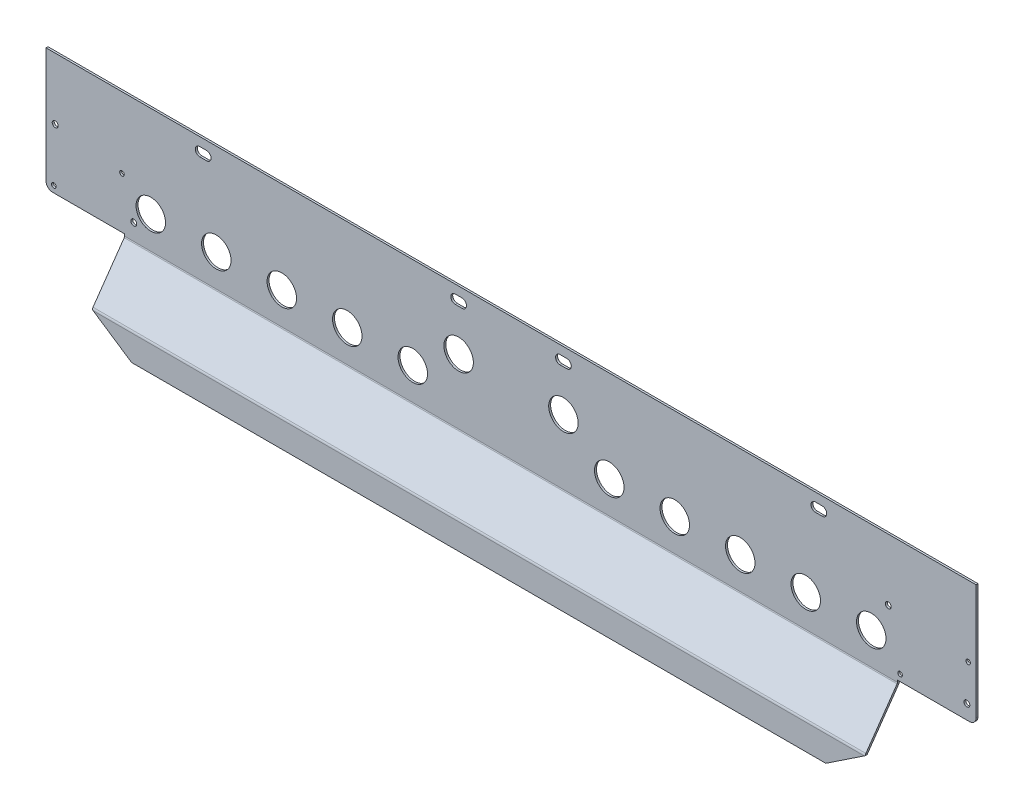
ISO-10303-21;
HEADER;
FILE_DESCRIPTION(('STEP AP214'),'2;1');
FILE_NAME('part.step','',(''),(''),'','','');
FILE_SCHEMA(('AUTOMOTIVE_DESIGN { 1 0 10303 214 1 1 1 1 }'));
ENDSEC;
DATA;
#1=APPLICATION_CONTEXT('core data for automotive mechanical design processes');
#2=APPLICATION_PROTOCOL_DEFINITION('international standard','automotive_design',2000,#1);
#3=PRODUCT_CONTEXT('',#1,'mechanical');
#4=PRODUCT('Part','Part','',(#3));
#5=PRODUCT_RELATED_PRODUCT_CATEGORY('part','',(#4));
#6=PRODUCT_DEFINITION_FORMATION('','',#4);
#7=PRODUCT_DEFINITION_CONTEXT('part definition',#1,'design');
#8=PRODUCT_DEFINITION('design','',#6,#7);
#9=PRODUCT_DEFINITION_SHAPE('','',#8);
#10=(LENGTH_UNIT() NAMED_UNIT(*) SI_UNIT(.MILLI.,.METRE.));
#11=(NAMED_UNIT(*) PLANE_ANGLE_UNIT() SI_UNIT($,.RADIAN.));
#12=(NAMED_UNIT(*) SI_UNIT($,.STERADIAN.) SOLID_ANGLE_UNIT());
#13=UNCERTAINTY_MEASURE_WITH_UNIT(LENGTH_MEASURE(1.E-05),#10,'distance_accuracy_value','');
#14=(GEOMETRIC_REPRESENTATION_CONTEXT(3) GLOBAL_UNCERTAINTY_ASSIGNED_CONTEXT((#13)) GLOBAL_UNIT_ASSIGNED_CONTEXT((#10,
#11,#12)) REPRESENTATION_CONTEXT('',''));
#15=CARTESIAN_POINT('',(0.,0.,0.));
#16=DIRECTION('',(0.,0.,1.));
#17=DIRECTION('',(1.,0.,0.));
#18=AXIS2_PLACEMENT_3D('',#15,#16,#17);
#19=CARTESIAN_POINT('',(295.,55.7235379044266,-26.163786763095));
#20=DIRECTION('',(0.,0.,1.));
#21=DIRECTION('',(0.,-1.,0.));
#22=AXIS2_PLACEMENT_3D('',#19,#20,#21);
#23=PLANE('',#22);
#24=CARTESIAN_POINT('',(-348.,103.723537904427,-26.163786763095));
#25=DIRECTION('',(0.,0.,1.));
#26=DIRECTION('',(0.,-1.,0.));
#27=AXIS2_PLACEMENT_3D('',#24,#25,#26);
#28=CIRCLE('',#27,2.24999999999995);
#29=CARTESIAN_POINT('',(-345.75,103.723537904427,-26.163786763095));
#30=VERTEX_POINT('',#29);
#31=EDGE_CURVE('E1685',#30,#30,#28,.F.);
#32=ORIENTED_EDGE('',*,*,#31,.F.);
#33=EDGE_LOOP('',(#32));
#34=FACE_BOUND('',#33,.T.);
#35=CARTESIAN_POINT('',(-288.,68.7235379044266,-26.163786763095));
#36=DIRECTION('',(0.,0.,1.));
#37=DIRECTION('',(0.,-1.,0.));
#38=AXIS2_PLACEMENT_3D('',#35,#36,#37);
#39=CIRCLE('',#38,2.24999999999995);
#40=CARTESIAN_POINT('',(-285.75,68.7235379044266,-26.163786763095));
#41=VERTEX_POINT('',#40);
#42=EDGE_CURVE('E1689',#41,#41,#39,.F.);
#43=ORIENTED_EDGE('',*,*,#42,.F.);
#44=EDGE_LOOP('',(#43));
#45=FACE_BOUND('',#44,.T.);
#46=CARTESIAN_POINT('',(288.,103.723537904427,-26.163786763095));
#47=DIRECTION('',(0.,0.,1.));
#48=DIRECTION('',(0.,-1.,0.));
#49=AXIS2_PLACEMENT_3D('',#46,#47,#48);
#50=CIRCLE('',#49,2.24999999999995);
#51=CARTESIAN_POINT('',(290.25,103.723537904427,-26.163786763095));
#52=VERTEX_POINT('',#51);
#53=EDGE_CURVE('E1699',#52,#52,#50,.F.);
#54=ORIENTED_EDGE('',*,*,#53,.F.);
#55=EDGE_LOOP('',(#54));
#56=FACE_BOUND('',#55,.T.);
#57=CARTESIAN_POINT('',(348.,68.7235379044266,-26.163786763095));
#58=DIRECTION('',(0.,0.,1.));
#59=DIRECTION('',(0.,-1.,0.));
#60=AXIS2_PLACEMENT_3D('',#57,#58,#59);
#61=CIRCLE('',#60,2.24999999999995);
#62=CARTESIAN_POINT('',(350.25,68.7235379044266,-26.163786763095));
#63=VERTEX_POINT('',#62);
#64=EDGE_CURVE('E1705',#63,#63,#61,.F.);
#65=ORIENTED_EDGE('',*,*,#64,.F.);
#66=EDGE_LOOP('',(#65));
#67=FACE_BOUND('',#66,.T.);
#68=CARTESIAN_POINT('',(-349.,62.7235379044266,-26.163786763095));
#69=DIRECTION('',(0.,0.,1.));
#70=DIRECTION('',(0.,-1.,0.));
#71=AXIS2_PLACEMENT_3D('',#68,#69,#70);
#72=CIRCLE('',#71,1.74999999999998);
#73=CARTESIAN_POINT('',(-347.25,62.7235379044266,-26.163786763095));
#74=VERTEX_POINT('',#73);
#75=EDGE_CURVE('E1711',#74,#74,#72,.F.);
#76=ORIENTED_EDGE('',*,*,#75,.F.);
#77=EDGE_LOOP('',(#76));
#78=FACE_BOUND('',#77,.T.);
#79=CARTESIAN_POINT('',(-297.,96.7235379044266,-26.163786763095));
#80=DIRECTION('',(0.,0.,1.));
#81=DIRECTION('',(0.,-1.,0.));
#82=AXIS2_PLACEMENT_3D('',#79,#80,#81);
#83=CIRCLE('',#82,1.74999999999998);
#84=CARTESIAN_POINT('',(-295.25,96.7235379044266,-26.163786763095));
#85=VERTEX_POINT('',#84);
#86=EDGE_CURVE('E1717',#85,#85,#83,.F.);
#87=ORIENTED_EDGE('',*,*,#86,.F.);
#88=EDGE_LOOP('',(#87));
#89=FACE_BOUND('',#88,.T.);
#90=CARTESIAN_POINT('',(297.,62.7235379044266,-26.163786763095));
#91=DIRECTION('',(0.,0.,1.));
#92=DIRECTION('',(0.,-1.,0.));
#93=AXIS2_PLACEMENT_3D('',#90,#91,#92);
#94=CIRCLE('',#93,1.74999999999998);
#95=CARTESIAN_POINT('',(298.75,62.7235379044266,-26.163786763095));
#96=VERTEX_POINT('',#95);
#97=EDGE_CURVE('E1722',#96,#96,#94,.F.);
#98=ORIENTED_EDGE('',*,*,#97,.F.);
#99=EDGE_LOOP('',(#98));
#100=FACE_BOUND('',#99,.T.);
#101=CARTESIAN_POINT('',(349.,96.7235379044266,-26.163786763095));
#102=DIRECTION('',(0.,0.,1.));
#103=DIRECTION('',(0.,-1.,0.));
#104=AXIS2_PLACEMENT_3D('',#101,#102,#103);
#105=CIRCLE('',#104,1.74999999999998);
#106=CARTESIAN_POINT('',(350.75,96.7235379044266,-26.163786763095));
#107=VERTEX_POINT('',#106);
#108=EDGE_CURVE('E314',#107,#107,#105,.F.);
#109=ORIENTED_EDGE('',*,*,#108,.F.);
#110=EDGE_LOOP('',(#109));
#111=FACE_BOUND('',#110,.T.);
#112=CARTESIAN_POINT('',(-40.,105.723537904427,-26.163786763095));
#113=DIRECTION('',(0.,0.,-1.));
#114=DIRECTION('',(0.,1.,0.));
#115=AXIS2_PLACEMENT_3D('',#112,#113,#114);
#116=CIRCLE('',#115,11.25);
#117=CARTESIAN_POINT('',(-40.,116.973537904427,-26.163786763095));
#118=VERTEX_POINT('',#117);
#119=EDGE_CURVE('E346',#118,#118,#116,.T.);
#120=ORIENTED_EDGE('',*,*,#119,.F.);
#121=EDGE_LOOP('',(#120));
#122=FACE_BOUND('',#121,.T.);
#123=DIRECTION('',(1.,0.,0.));
#124=VECTOR('',#123,1.);
#125=CARTESIAN_POINT('',(-237.6,144.123537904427,-26.163786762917));
#126=LINE('',#125,#124);
#127=CARTESIAN_POINT('',(-237.6,144.123537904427,-26.163786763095));
#128=VERTEX_POINT('',#127);
#129=CARTESIAN_POINT('',(-232.4,144.123537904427,-26.163786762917));
#130=VERTEX_POINT('',#129);
#131=EDGE_CURVE('E366',#128,#130,#126,.T.);
#132=ORIENTED_EDGE('',*,*,#131,.F.);
#133=CARTESIAN_POINT('',(-237.6,140.723537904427,-26.163786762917));
#134=DIRECTION('',(0.,0.,-1.));
#135=DIRECTION('',(-1.,0.,0.));
#136=AXIS2_PLACEMENT_3D('',#133,#134,#135);
#137=CIRCLE('',#136,3.39999999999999);
#138=CARTESIAN_POINT('',(-237.6,137.323537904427,-26.163786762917));
#139=VERTEX_POINT('',#138);
#140=EDGE_CURVE('E363',#139,#128,#137,.T.);
#141=ORIENTED_EDGE('',*,*,#140,.F.);
#142=DIRECTION('',(-1.,0.,0.));
#143=VECTOR('',#142,1.);
#144=CARTESIAN_POINT('',(-232.4,137.323537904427,-26.163786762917));
#145=LINE('',#144,#143);
#146=CARTESIAN_POINT('',(-232.4,137.323537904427,-26.163786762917));
#147=VERTEX_POINT('',#146);
#148=EDGE_CURVE('E374',#147,#139,#145,.T.);
#149=ORIENTED_EDGE('',*,*,#148,.F.);
#150=CARTESIAN_POINT('',(-232.4,140.723537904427,-26.163786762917));
#151=DIRECTION('',(0.,0.,-1.));
#152=DIRECTION('',(-1.,0.,0.));
#153=AXIS2_PLACEMENT_3D('',#150,#151,#152);
#154=CIRCLE('',#153,3.39999999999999);
#155=EDGE_CURVE('E370',#130,#147,#154,.T.);
#156=ORIENTED_EDGE('',*,*,#155,.F.);
#157=EDGE_LOOP('',(#132,#141,#149,#156));
#158=FACE_BOUND('',#157,.T.);
#159=DIRECTION('',(1.,0.,0.));
#160=VECTOR('',#159,1.);
#161=CARTESIAN_POINT('',(37.4,144.123537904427,-26.163786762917));
#162=LINE('',#161,#160);
#163=CARTESIAN_POINT('',(37.4,144.123537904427,-26.163786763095));
#164=VERTEX_POINT('',#163);
#165=CARTESIAN_POINT('',(42.6,144.123537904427,-26.163786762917));
#166=VERTEX_POINT('',#165);
#167=EDGE_CURVE('E410',#164,#166,#162,.T.);
#168=ORIENTED_EDGE('',*,*,#167,.F.);
#169=CARTESIAN_POINT('',(37.4,140.723537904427,-26.163786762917));
#170=DIRECTION('',(0.,0.,-1.));
#171=DIRECTION('',(-1.,0.,0.));
#172=AXIS2_PLACEMENT_3D('',#169,#170,#171);
#173=CIRCLE('',#172,3.39999999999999);
#174=CARTESIAN_POINT('',(37.4,137.323537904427,-26.163786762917));
#175=VERTEX_POINT('',#174);
#176=EDGE_CURVE('E407',#175,#164,#173,.T.);
#177=ORIENTED_EDGE('',*,*,#176,.F.);
#178=DIRECTION('',(-1.,0.,0.));
#179=VECTOR('',#178,1.);
#180=CARTESIAN_POINT('',(42.6,137.323537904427,-26.163786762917));
#181=LINE('',#180,#179);
#182=CARTESIAN_POINT('',(42.6,137.323537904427,-26.163786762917));
#183=VERTEX_POINT('',#182);
#184=EDGE_CURVE('E417',#183,#175,#181,.T.);
#185=ORIENTED_EDGE('',*,*,#184,.F.);
#186=CARTESIAN_POINT('',(42.6,140.723537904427,-26.163786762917));
#187=DIRECTION('',(0.,0.,-1.));
#188=DIRECTION('',(-1.,0.,0.));
#189=AXIS2_PLACEMENT_3D('',#186,#187,#188);
#190=CIRCLE('',#189,3.39999999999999);
#191=EDGE_CURVE('E413',#166,#183,#190,.T.);
#192=ORIENTED_EDGE('',*,*,#191,.F.);
#193=EDGE_LOOP('',(#168,#177,#185,#192));
#194=FACE_BOUND('',#193,.T.);
#195=DIRECTION('',(1.,0.,0.));
#196=VECTOR('',#195,1.);
#197=CARTESIAN_POINT('',(-42.6,144.123537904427,-26.163786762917));
#198=LINE('',#197,#196);
#199=CARTESIAN_POINT('',(-42.6,144.123537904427,-26.163786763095));
#200=VERTEX_POINT('',#199);
#201=CARTESIAN_POINT('',(-37.4,144.123537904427,-26.163786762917));
#202=VERTEX_POINT('',#201);
#203=EDGE_CURVE('E453',#200,#202,#198,.T.);
#204=ORIENTED_EDGE('',*,*,#203,.F.);
#205=CARTESIAN_POINT('',(-42.6,140.723537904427,-26.163786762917));
#206=DIRECTION('',(0.,0.,-1.));
#207=DIRECTION('',(-1.,0.,0.));
#208=AXIS2_PLACEMENT_3D('',#205,#206,#207);
#209=CIRCLE('',#208,3.39999999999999);
#210=CARTESIAN_POINT('',(-42.6,137.323537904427,-26.163786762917));
#211=VERTEX_POINT('',#210);
#212=EDGE_CURVE('E450',#211,#200,#209,.T.);
#213=ORIENTED_EDGE('',*,*,#212,.F.);
#214=DIRECTION('',(-1.,0.,0.));
#215=VECTOR('',#214,1.);
#216=CARTESIAN_POINT('',(-37.4,137.323537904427,-26.163786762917));
#217=LINE('',#216,#215);
#218=CARTESIAN_POINT('',(-37.4,137.323537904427,-26.163786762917));
#219=VERTEX_POINT('',#218);
#220=EDGE_CURVE('E461',#219,#211,#217,.T.);
#221=ORIENTED_EDGE('',*,*,#220,.F.);
#222=CARTESIAN_POINT('',(-37.4,140.723537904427,-26.163786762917));
#223=DIRECTION('',(0.,0.,-1.));
#224=DIRECTION('',(-1.,0.,0.));
#225=AXIS2_PLACEMENT_3D('',#222,#223,#224);
#226=CIRCLE('',#225,3.39999999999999);
#227=EDGE_CURVE('E457',#202,#219,#226,.T.);
#228=ORIENTED_EDGE('',*,*,#227,.F.);
#229=EDGE_LOOP('',(#204,#213,#221,#228));
#230=FACE_BOUND('',#229,.T.);
#231=CARTESIAN_POINT('',(225.,80.7235379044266,-26.163786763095));
#232=DIRECTION('',(0.,0.,-1.));
#233=DIRECTION('',(-1.,0.,0.));
#234=AXIS2_PLACEMENT_3D('',#231,#232,#233);
#235=CIRCLE('',#234,11.25);
#236=CARTESIAN_POINT('',(213.75,80.7235379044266,-26.163786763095));
#237=VERTEX_POINT('',#236);
#238=EDGE_CURVE('E486',#237,#237,#235,.T.);
#239=ORIENTED_EDGE('',*,*,#238,.F.);
#240=EDGE_LOOP('',(#239));
#241=FACE_BOUND('',#240,.T.);
#242=CARTESIAN_POINT('',(275.,80.7235379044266,-26.163786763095));
#243=DIRECTION('',(0.,0.,-1.));
#244=DIRECTION('',(-1.,0.,0.));
#245=AXIS2_PLACEMENT_3D('',#242,#243,#244);
#246=CIRCLE('',#245,11.25);
#247=CARTESIAN_POINT('',(263.75,80.7235379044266,-26.163786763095));
#248=VERTEX_POINT('',#247);
#249=EDGE_CURVE('E491',#248,#248,#246,.T.);
#250=ORIENTED_EDGE('',*,*,#249,.F.);
#251=EDGE_LOOP('',(#250));
#252=FACE_BOUND('',#251,.T.);
#253=DIRECTION('',(1.,0.,0.));
#254=VECTOR('',#253,1.);
#255=CARTESIAN_POINT('',(232.4,144.123537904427,-26.163786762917));
#256=LINE('',#255,#254);
#257=CARTESIAN_POINT('',(232.4,144.123537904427,-26.163786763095));
#258=VERTEX_POINT('',#257);
#259=CARTESIAN_POINT('',(237.6,144.123537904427,-26.163786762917));
#260=VERTEX_POINT('',#259);
#261=EDGE_CURVE('E513',#258,#260,#256,.T.);
#262=ORIENTED_EDGE('',*,*,#261,.F.);
#263=CARTESIAN_POINT('',(232.4,140.723537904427,-26.163786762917));
#264=DIRECTION('',(0.,0.,-1.));
#265=DIRECTION('',(-1.,0.,0.));
#266=AXIS2_PLACEMENT_3D('',#263,#264,#265);
#267=CIRCLE('',#266,3.39999999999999);
#268=CARTESIAN_POINT('',(232.4,137.323537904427,-26.163786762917));
#269=VERTEX_POINT('',#268);
#270=EDGE_CURVE('E510',#269,#258,#267,.T.);
#271=ORIENTED_EDGE('',*,*,#270,.F.);
#272=DIRECTION('',(-1.,0.,0.));
#273=VECTOR('',#272,1.);
#274=CARTESIAN_POINT('',(237.6,137.323537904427,-26.163786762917));
#275=LINE('',#274,#273);
#276=CARTESIAN_POINT('',(237.6,137.323537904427,-26.163786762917));
#277=VERTEX_POINT('',#276);
#278=EDGE_CURVE('E521',#277,#269,#275,.T.);
#279=ORIENTED_EDGE('',*,*,#278,.F.);
#280=CARTESIAN_POINT('',(237.6,140.723537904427,-26.163786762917));
#281=DIRECTION('',(0.,0.,-1.));
#282=DIRECTION('',(-1.,0.,0.));
#283=AXIS2_PLACEMENT_3D('',#280,#281,#282);
#284=CIRCLE('',#283,3.39999999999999);
#285=EDGE_CURVE('E517',#260,#277,#284,.T.);
#286=ORIENTED_EDGE('',*,*,#285,.F.);
#287=EDGE_LOOP('',(#262,#271,#279,#286));
#288=FACE_BOUND('',#287,.T.);
#289=DIRECTION('',(1.,0.,0.));
#290=VECTOR('',#289,1.);
#291=CARTESIAN_POINT('',(-295.,57.7235379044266,-26.163786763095));
#292=LINE('',#291,#290);
#293=CARTESIAN_POINT('',(-350.,57.7235379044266,-26.163786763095));
#294=VERTEX_POINT('',#293);
#295=CARTESIAN_POINT('',(-295.,57.7235379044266,-26.163786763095));
#296=VERTEX_POINT('',#295);
#297=EDGE_CURVE('E298',#294,#296,#292,.T.);
#298=ORIENTED_EDGE('',*,*,#297,.F.);
#299=CARTESIAN_POINT('',(-350.,62.7235379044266,-26.163786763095));
#300=DIRECTION('',(0.,0.,1.));
#301=DIRECTION('',(0.,-1.,0.));
#302=AXIS2_PLACEMENT_3D('',#299,#300,#301);
#303=CIRCLE('',#302,5.);
#304=CARTESIAN_POINT('',(-355.,62.7235379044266,-26.163786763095));
#305=VERTEX_POINT('',#304);
#306=EDGE_CURVE('E303',#294,#305,#303,.F.);
#307=ORIENTED_EDGE('',*,*,#306,.T.);
#308=DIRECTION('',(0.,-1.,0.));
#309=VECTOR('',#308,1.);
#310=CARTESIAN_POINT('',(-355.,150.723537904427,-26.163786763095));
#311=LINE('',#310,#309);
#312=CARTESIAN_POINT('',(-355.,150.723537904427,-26.163786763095));
#313=VERTEX_POINT('',#312);
#314=EDGE_CURVE('E292',#313,#305,#311,.T.);
#315=ORIENTED_EDGE('',*,*,#314,.F.);
#316=DIRECTION('',(-1.,0.,0.));
#317=VECTOR('',#316,1.);
#318=CARTESIAN_POINT('',(295.,150.723537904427,-26.163786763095));
#319=LINE('',#318,#317);
#320=CARTESIAN_POINT('',(355.,150.723537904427,-26.163786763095));
#321=VERTEX_POINT('',#320);
#322=EDGE_CURVE('E275',#321,#313,#319,.T.);
#323=ORIENTED_EDGE('',*,*,#322,.F.);
#324=DIRECTION('',(0.,1.,0.));
#325=VECTOR('',#324,1.);
#326=CARTESIAN_POINT('',(355.,150.723537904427,-26.163786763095));
#327=LINE('',#326,#325);
#328=CARTESIAN_POINT('',(355.,62.7235379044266,-26.163786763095));
#329=VERTEX_POINT('',#328);
#330=EDGE_CURVE('E326',#329,#321,#327,.T.);
#331=ORIENTED_EDGE('',*,*,#330,.F.);
#332=CARTESIAN_POINT('',(350.,62.7235379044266,-26.163786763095));
#333=DIRECTION('',(0.,0.,1.));
#334=DIRECTION('',(0.,-1.,0.));
#335=AXIS2_PLACEMENT_3D('',#332,#333,#334);
#336=CIRCLE('',#335,5.);
#337=CARTESIAN_POINT('',(350.,57.7235379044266,-26.163786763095));
#338=VERTEX_POINT('',#337);
#339=EDGE_CURVE('E56',#329,#338,#336,.F.);
#340=ORIENTED_EDGE('',*,*,#339,.T.);
#341=DIRECTION('',(1.,0.,0.));
#342=VECTOR('',#341,1.);
#343=CARTESIAN_POINT('',(295.,57.7235379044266,-26.163786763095));
#344=LINE('',#343,#342);
#345=CARTESIAN_POINT('',(295.,57.7235379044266,-26.163786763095));
#346=VERTEX_POINT('',#345);
#347=EDGE_CURVE('E323',#346,#338,#344,.T.);
#348=ORIENTED_EDGE('',*,*,#347,.F.);
#349=DIRECTION('',(0.,1.,0.));
#350=VECTOR('',#349,1.);
#351=CARTESIAN_POINT('',(295.,55.7235379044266,-26.163786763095));
#352=LINE('',#351,#350);
#353=CARTESIAN_POINT('',(295.,56.1964860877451,-26.163786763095));
#354=VERTEX_POINT('',#353);
#355=EDGE_CURVE('E543',#354,#346,#352,.T.);
#356=ORIENTED_EDGE('',*,*,#355,.F.);
#357=DIRECTION('',(-1.,0.,0.));
#358=VECTOR('',#357,1.);
#359=CARTESIAN_POINT('',(295.,56.1964860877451,-26.163786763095));
#360=LINE('',#359,#358);
#361=CARTESIAN_POINT('',(-295.,56.1964860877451,-26.163786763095));
#362=VERTEX_POINT('',#361);
#363=EDGE_CURVE('E574',#354,#362,#360,.T.);
#364=ORIENTED_EDGE('',*,*,#363,.T.);
#365=DIRECTION('',(0.,1.,0.));
#366=VECTOR('',#365,1.);
#367=CARTESIAN_POINT('',(-295.,55.7235379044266,-26.163786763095));
#368=LINE('',#367,#366);
#369=EDGE_CURVE('E542',#362,#296,#368,.T.);
#370=ORIENTED_EDGE('',*,*,#369,.T.);
#371=EDGE_LOOP('',(#298,#307,#315,#323,#331,#340,#348,#356,#364,#370));
#372=FACE_BOUND('',#371,.T.);
#373=CARTESIAN_POINT('',(175.,80.7235379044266,-26.163786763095));
#374=DIRECTION('',(0.,0.,-1.));
#375=DIRECTION('',(-1.,0.,0.));
#376=AXIS2_PLACEMENT_3D('',#373,#374,#375);
#377=CIRCLE('',#376,11.25);
#378=CARTESIAN_POINT('',(163.75,80.7235379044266,-26.163786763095));
#379=VERTEX_POINT('',#378);
#380=EDGE_CURVE('E662',#379,#379,#377,.T.);
#381=ORIENTED_EDGE('',*,*,#380,.F.);
#382=EDGE_LOOP('',(#381));
#383=FACE_BOUND('',#382,.T.);
#384=CARTESIAN_POINT('',(125.,80.7235379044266,-26.163786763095));
#385=DIRECTION('',(0.,0.,-1.));
#386=DIRECTION('',(-1.,0.,0.));
#387=AXIS2_PLACEMENT_3D('',#384,#385,#386);
#388=CIRCLE('',#387,11.25);
#389=CARTESIAN_POINT('',(113.75,80.7235379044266,-26.163786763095));
#390=VERTEX_POINT('',#389);
#391=EDGE_CURVE('E670',#390,#390,#388,.T.);
#392=ORIENTED_EDGE('',*,*,#391,.F.);
#393=EDGE_LOOP('',(#392));
#394=FACE_BOUND('',#393,.T.);
#395=CARTESIAN_POINT('',(75.,80.7235379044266,-26.163786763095));
#396=DIRECTION('',(0.,0.,-1.));
#397=DIRECTION('',(-1.,0.,0.));
#398=AXIS2_PLACEMENT_3D('',#395,#396,#397);
#399=CIRCLE('',#398,11.25);
#400=CARTESIAN_POINT('',(63.75,80.7235379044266,-26.163786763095));
#401=VERTEX_POINT('',#400);
#402=EDGE_CURVE('E678',#401,#401,#399,.T.);
#403=ORIENTED_EDGE('',*,*,#402,.F.);
#404=EDGE_LOOP('',(#403));
#405=FACE_BOUND('',#404,.T.);
#406=CARTESIAN_POINT('',(-75.0000000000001,80.7235379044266,-26.163786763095));
#407=DIRECTION('',(0.,0.,-1.));
#408=DIRECTION('',(-1.,0.,0.));
#409=AXIS2_PLACEMENT_3D('',#406,#407,#408);
#410=CIRCLE('',#409,11.25);
#411=CARTESIAN_POINT('',(-86.2500000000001,80.7235379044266,-26.163786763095));
#412=VERTEX_POINT('',#411);
#413=EDGE_CURVE('E686',#412,#412,#410,.T.);
#414=ORIENTED_EDGE('',*,*,#413,.F.);
#415=EDGE_LOOP('',(#414));
#416=FACE_BOUND('',#415,.T.);
#417=CARTESIAN_POINT('',(-125.,80.7235379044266,-26.163786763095));
#418=DIRECTION('',(0.,0.,-1.));
#419=DIRECTION('',(-1.,0.,0.));
#420=AXIS2_PLACEMENT_3D('',#417,#418,#419);
#421=CIRCLE('',#420,11.25);
#422=CARTESIAN_POINT('',(-136.25,80.7235379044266,-26.163786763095));
#423=VERTEX_POINT('',#422);
#424=EDGE_CURVE('E694',#423,#423,#421,.T.);
#425=ORIENTED_EDGE('',*,*,#424,.F.);
#426=EDGE_LOOP('',(#425));
#427=FACE_BOUND('',#426,.T.);
#428=CARTESIAN_POINT('',(-175.,80.7235379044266,-26.163786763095));
#429=DIRECTION('',(0.,0.,-1.));
#430=DIRECTION('',(-1.,0.,0.));
#431=AXIS2_PLACEMENT_3D('',#428,#429,#430);
#432=CIRCLE('',#431,11.25);
#433=CARTESIAN_POINT('',(-186.25,80.7235379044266,-26.163786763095));
#434=VERTEX_POINT('',#433);
#435=EDGE_CURVE('E702',#434,#434,#432,.T.);
#436=ORIENTED_EDGE('',*,*,#435,.F.);
#437=EDGE_LOOP('',(#436));
#438=FACE_BOUND('',#437,.T.);
#439=CARTESIAN_POINT('',(-225.,80.7235379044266,-26.163786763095));
#440=DIRECTION('',(0.,0.,-1.));
#441=DIRECTION('',(-1.,0.,0.));
#442=AXIS2_PLACEMENT_3D('',#439,#440,#441);
#443=CIRCLE('',#442,11.25);
#444=CARTESIAN_POINT('',(-236.25,80.7235379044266,-26.163786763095));
#445=VERTEX_POINT('',#444);
#446=EDGE_CURVE('E710',#445,#445,#443,.T.);
#447=ORIENTED_EDGE('',*,*,#446,.F.);
#448=EDGE_LOOP('',(#447));
#449=FACE_BOUND('',#448,.T.);
#450=CARTESIAN_POINT('',(-275.,80.7235379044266,-26.163786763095));
#451=DIRECTION('',(0.,0.,-1.));
#452=DIRECTION('',(-1.,0.,0.));
#453=AXIS2_PLACEMENT_3D('',#450,#451,#452);
#454=CIRCLE('',#453,11.25);
#455=CARTESIAN_POINT('',(-286.25,80.7235379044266,-26.163786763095));
#456=VERTEX_POINT('',#455);
#457=EDGE_CURVE('E718',#456,#456,#454,.T.);
#458=ORIENTED_EDGE('',*,*,#457,.F.);
#459=EDGE_LOOP('',(#458));
#460=FACE_BOUND('',#459,.T.);
#461=CARTESIAN_POINT('',(40.,105.723537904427,-26.163786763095));
#462=DIRECTION('',(0.,0.,-1.));
#463=DIRECTION('',(0.,1.,0.));
#464=AXIS2_PLACEMENT_3D('',#461,#462,#463);
#465=CIRCLE('',#464,11.25);
#466=CARTESIAN_POINT('',(40.,116.973537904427,-26.163786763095));
#467=VERTEX_POINT('',#466);
#468=EDGE_CURVE('E338',#467,#467,#465,.T.);
#469=ORIENTED_EDGE('',*,*,#468,.F.);
#470=EDGE_LOOP('',(#469));
#471=FACE_BOUND('',#470,.T.);
#472=ADVANCED_FACE('F40',(#34,#45,#56,#67,#78,#89,#100,#111,#122,#158,#194,#230,#241,#252,#288,
#372,#383,#394,#405,#416,#427,#438,#449,#460,#471),#23,.F.);
#473=CARTESIAN_POINT('',(295.,21.2748329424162,-0.542543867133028));
#474=DIRECTION('',(1.,0.,0.));
#475=DIRECTION('',(0.,0.,-1.));
#476=AXIS2_PLACEMENT_3D('',#473,#474,#475);
#477=PLANE('',#476);
#478=CARTESIAN_POINT('',(295.,19.554103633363,-3.));
#479=DIRECTION('',(1.,0.,0.));
#480=DIRECTION('',(0.,0.,-1.));
#481=AXIS2_PLACEMENT_3D('',#478,#479,#480);
#482=CIRCLE('',#481,3.);
#483=CARTESIAN_POINT('',(295.,20.,-0.0333223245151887));
#484=VERTEX_POINT('',#483);
#485=CARTESIAN_POINT('',(295.,21.2748329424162,-0.542543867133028));
#486=VERTEX_POINT('',#485);
#487=EDGE_CURVE('E560',#484,#486,#482,.F.);
#488=ORIENTED_EDGE('',*,*,#487,.F.);
#489=DIRECTION('',(0.,0.,-1.));
#490=VECTOR('',#489,1.);
#491=CARTESIAN_POINT('',(295.,20.,-0.542543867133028));
#492=LINE('',#491,#490);
#493=CARTESIAN_POINT('',(295.,20.,-1.56780712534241));
#494=VERTEX_POINT('',#493);
#495=EDGE_CURVE('E755',#484,#494,#492,.T.);
#496=ORIENTED_EDGE('',*,*,#495,.T.);
#497=CARTESIAN_POINT('',(295.,19.554103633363,-3.));
#498=DIRECTION('',(1.,0.,0.));
#499=DIRECTION('',(0.,0.,-1.));
#500=AXIS2_PLACEMENT_3D('',#497,#498,#499);
#501=CIRCLE('',#500,1.5);
#502=CARTESIAN_POINT('',(295.,20.4144682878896,-1.77127193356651));
#503=VERTEX_POINT('',#502);
#504=EDGE_CURVE('E563',#494,#503,#501,.F.);
#505=ORIENTED_EDGE('',*,*,#504,.T.);
#506=DIRECTION('',(0.,-0.573576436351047,-0.819152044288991));
#507=VECTOR('',#506,1.);
#508=CARTESIAN_POINT('',(295.,21.2748329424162,-0.542543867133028));
#509=LINE('',#508,#507);
#510=EDGE_CURVE('E654',#486,#503,#509,.T.);
#511=ORIENTED_EDGE('',*,*,#510,.F.);
#512=EDGE_LOOP('',(#488,#496,#505,#511));
#513=FACE_BOUND('',#512,.T.);
#514=ADVANCED_FACE('F848',(#513),#477,.T.);
#515=CARTESIAN_POINT('',(295.,19.554103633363,-1.5));
#516=DIRECTION('',(1.,0.,0.));
#517=DIRECTION('',(0.,0.,-1.));
#518=AXIS2_PLACEMENT_3D('',#515,#516,#517);
#519=PLANE('',#518);
#520=DIRECTION('',(0.,0.819152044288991,-0.573576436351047));
#521=VECTOR('',#520,1.);
#522=CARTESIAN_POINT('',(295.,20.5,0.));
#523=LINE('',#522,#521);
#524=CARTESIAN_POINT('',(295.,55.3361214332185,-24.3925148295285));
#525=VERTEX_POINT('',#524);
#526=EDGE_CURVE('E556',#486,#525,#523,.T.);
#527=ORIENTED_EDGE('',*,*,#526,.F.);
#528=ORIENTED_EDGE('',*,*,#510,.T.);
#529=DIRECTION('',(0.,0.819152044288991,-0.573576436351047));
#530=VECTOR('',#529,1.);
#531=CARTESIAN_POINT('',(295.,19.6396353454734,-1.22872806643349));
#532=LINE('',#531,#530);
#533=CARTESIAN_POINT('',(295.,54.4757567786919,-25.621242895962));
#534=VERTEX_POINT('',#533);
#535=EDGE_CURVE('E566',#503,#534,#532,.T.);
#536=ORIENTED_EDGE('',*,*,#535,.T.);
#537=DIRECTION('',(0.,0.573576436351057,0.819152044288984));
#538=VECTOR('',#537,1.);
#539=CARTESIAN_POINT('',(295.,54.4757567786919,-25.621242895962));
#540=LINE('',#539,#538);
#541=EDGE_CURVE('E644',#534,#525,#540,.T.);
#542=ORIENTED_EDGE('',*,*,#541,.T.);
#543=EDGE_LOOP('',(#527,#528,#536,#542));
#544=FACE_BOUND('',#543,.T.);
#545=ADVANCED_FACE('F813',(#544),#519,.T.);
#546=CARTESIAN_POINT('',(-295.,19.554103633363,0.));
#547=DIRECTION('',(-1.,0.,0.));
#548=DIRECTION('',(0.,0.,1.));
#549=AXIS2_PLACEMENT_3D('',#546,#547,#548);
#550=PLANE('',#549);
#551=CARTESIAN_POINT('',(-295.,19.554103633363,-3.));
#552=DIRECTION('',(1.,0.,0.));
#553=DIRECTION('',(0.,0.,-1.));
#554=AXIS2_PLACEMENT_3D('',#551,#552,#553);
#555=CIRCLE('',#554,1.5);
#556=CARTESIAN_POINT('',(-295.,20.,-1.56780712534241));
#557=VERTEX_POINT('',#556);
#558=CARTESIAN_POINT('',(-295.,20.4144682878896,-1.77127193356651));
#559=VERTEX_POINT('',#558);
#560=EDGE_CURVE('E593',#557,#559,#555,.F.);
#561=ORIENTED_EDGE('',*,*,#560,.F.);
#562=DIRECTION('',(0.,0.,1.));
#563=VECTOR('',#562,1.);
#564=CARTESIAN_POINT('',(-295.,20.,0.));
#565=LINE('',#564,#563);
#566=CARTESIAN_POINT('',(-295.,20.,-0.0333223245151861));
#567=VERTEX_POINT('',#566);
#568=EDGE_CURVE('E722',#557,#567,#565,.T.);
#569=ORIENTED_EDGE('',*,*,#568,.T.);
#570=CARTESIAN_POINT('',(-295.,19.554103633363,-3.));
#571=DIRECTION('',(1.,0.,0.));
#572=DIRECTION('',(0.,0.,-1.));
#573=AXIS2_PLACEMENT_3D('',#570,#571,#572);
#574=CIRCLE('',#573,3.);
#575=CARTESIAN_POINT('',(-295.,21.2748329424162,-0.542543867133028));
#576=VERTEX_POINT('',#575);
#577=EDGE_CURVE('E590',#567,#576,#574,.F.);
#578=ORIENTED_EDGE('',*,*,#577,.T.);
#579=DIRECTION('',(0.,0.573576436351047,0.819152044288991));
#580=VECTOR('',#579,1.);
#581=CARTESIAN_POINT('',(-295.,20.4144682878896,-1.77127193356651));
#582=LINE('',#581,#580);
#583=EDGE_CURVE('E650',#559,#576,#582,.T.);
#584=ORIENTED_EDGE('',*,*,#583,.F.);
#585=EDGE_LOOP('',(#561,#569,#578,#584));
#586=FACE_BOUND('',#585,.T.);
#587=ADVANCED_FACE('F873',(#586),#550,.T.);
#588=CARTESIAN_POINT('',(295.,56.1964860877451,-24.663786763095));
#589=DIRECTION('',(1.,0.,0.));
#590=DIRECTION('',(0.,0.,-1.));
#591=AXIS2_PLACEMENT_3D('',#588,#589,#590);
#592=PLANE('',#591);
#593=DIRECTION('',(0.,0.,-1.));
#594=VECTOR('',#593,1.);
#595=CARTESIAN_POINT('',(295.,56.1964860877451,-24.663786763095));
#596=LINE('',#595,#594);
#597=CARTESIAN_POINT('',(295.,56.1964860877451,-24.663786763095));
#598=VERTEX_POINT('',#597);
#599=EDGE_CURVE('E647',#598,#354,#596,.T.);
#600=ORIENTED_EDGE('',*,*,#599,.F.);
#601=CARTESIAN_POINT('',(295.,56.1964860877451,-23.163786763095));
#602=DIRECTION('',(-1.,0.,0.));
#603=DIRECTION('',(0.,0.,1.));
#604=AXIS2_PLACEMENT_3D('',#601,#602,#603);
#605=CIRCLE('',#604,1.5);
#606=EDGE_CURVE('E552',#525,#598,#605,.F.);
#607=ORIENTED_EDGE('',*,*,#606,.F.);
#608=ORIENTED_EDGE('',*,*,#541,.F.);
#609=CARTESIAN_POINT('',(295.,56.1964860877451,-23.163786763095));
#610=DIRECTION('',(1.,0.,0.));
#611=DIRECTION('',(0.,0.,-1.));
#612=AXIS2_PLACEMENT_3D('',#609,#610,#611);
#613=CIRCLE('',#612,3.);
#614=EDGE_CURVE('E570',#534,#354,#613,.T.);
#615=ORIENTED_EDGE('',*,*,#614,.T.);
#616=EDGE_LOOP('',(#600,#607,#608,#615));
#617=FACE_BOUND('',#616,.T.);
#618=ADVANCED_FACE('F806',(#617),#592,.T.);
#619=CARTESIAN_POINT('',(295.,54.4757567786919,-25.621242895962));
#620=DIRECTION('',(1.,0.,0.));
#621=DIRECTION('',(0.,0.,-1.));
#622=AXIS2_PLACEMENT_3D('',#619,#620,#621);
#623=PLANE('',#622);
#624=DIRECTION('',(0.,0.,1.));
#625=VECTOR('',#624,1.);
#626=CARTESIAN_POINT('',(295.,57.7235379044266,-26.163786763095));
#627=LINE('',#626,#625);
#628=CARTESIAN_POINT('',(295.,57.7235379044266,-24.663786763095));
#629=VERTEX_POINT('',#628);
#630=EDGE_CURVE('E330',#346,#629,#627,.T.);
#631=ORIENTED_EDGE('',*,*,#630,.T.);
#632=DIRECTION('',(0.,1.,0.));
#633=VECTOR('',#632,1.);
#634=CARTESIAN_POINT('',(295.,55.7235379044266,-24.663786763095));
#635=LINE('',#634,#633);
#636=EDGE_CURVE('E547',#598,#629,#635,.T.);
#637=ORIENTED_EDGE('',*,*,#636,.F.);
#638=ORIENTED_EDGE('',*,*,#599,.T.);
#639=ORIENTED_EDGE('',*,*,#355,.T.);
#640=EDGE_LOOP('',(#631,#637,#638,#639));
#641=FACE_BOUND('',#640,.T.);
#642=ADVANCED_FACE('F799',(#641),#623,.T.);
#643=CARTESIAN_POINT('',(-295.,55.3361214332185,-24.3925148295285));
#644=DIRECTION('',(-1.,0.,0.));
#645=DIRECTION('',(0.,0.,1.));
#646=AXIS2_PLACEMENT_3D('',#643,#644,#645);
#647=PLANE('',#646);
#648=DIRECTION('',(0.,-0.573576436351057,-0.819152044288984));
#649=VECTOR('',#648,1.);
#650=CARTESIAN_POINT('',(-295.,55.3361214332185,-24.3925148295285));
#651=LINE('',#650,#649);
#652=CARTESIAN_POINT('',(-295.,55.3361214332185,-24.3925148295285));
#653=VERTEX_POINT('',#652);
#654=CARTESIAN_POINT('',(-295.,54.4757567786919,-25.621242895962));
#655=VERTEX_POINT('',#654);
#656=EDGE_CURVE('E641',#653,#655,#651,.T.);
#657=ORIENTED_EDGE('',*,*,#656,.F.);
#658=CARTESIAN_POINT('',(-295.,56.1964860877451,-23.163786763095));
#659=DIRECTION('',(-1.,0.,0.));
#660=DIRECTION('',(0.,0.,1.));
#661=AXIS2_PLACEMENT_3D('',#658,#659,#660);
#662=CIRCLE('',#661,1.5);
#663=CARTESIAN_POINT('',(-295.,56.1964860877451,-24.663786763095));
#664=VERTEX_POINT('',#663);
#665=EDGE_CURVE('E582',#653,#664,#662,.F.);
#666=ORIENTED_EDGE('',*,*,#665,.T.);
#667=DIRECTION('',(0.,0.,1.));
#668=VECTOR('',#667,1.);
#669=CARTESIAN_POINT('',(-295.,56.1964860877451,-26.163786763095));
#670=LINE('',#669,#668);
#671=EDGE_CURVE('E285',#362,#664,#670,.T.);
#672=ORIENTED_EDGE('',*,*,#671,.F.);
#673=CARTESIAN_POINT('',(-295.,56.1964860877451,-23.163786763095));
#674=DIRECTION('',(1.,0.,0.));
#675=DIRECTION('',(0.,0.,-1.));
#676=AXIS2_PLACEMENT_3D('',#673,#674,#675);
#677=CIRCLE('',#676,3.);
#678=EDGE_CURVE('E548',#655,#362,#677,.T.);
#679=ORIENTED_EDGE('',*,*,#678,.F.);
#680=EDGE_LOOP('',(#657,#666,#672,#679));
#681=FACE_BOUND('',#680,.T.);
#682=ADVANCED_FACE('F864',(#681),#647,.T.);
#683=CARTESIAN_POINT('',(-295.,56.1964860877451,-26.163786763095));
#684=DIRECTION('',(-1.,0.,0.));
#685=DIRECTION('',(0.,0.,1.));
#686=AXIS2_PLACEMENT_3D('',#683,#684,#685);
#687=PLANE('',#686);
#688=DIRECTION('',(0.,0.819152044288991,-0.573576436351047));
#689=VECTOR('',#688,1.);
#690=CARTESIAN_POINT('',(-295.,20.5,0.));
#691=LINE('',#690,#689);
#692=EDGE_CURVE('E586',#576,#653,#691,.T.);
#693=ORIENTED_EDGE('',*,*,#692,.T.);
#694=ORIENTED_EDGE('',*,*,#656,.T.);
#695=DIRECTION('',(0.,0.819152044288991,-0.573576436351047));
#696=VECTOR('',#695,1.);
#697=CARTESIAN_POINT('',(-295.,19.6396353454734,-1.22872806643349));
#698=LINE('',#697,#696);
#699=EDGE_CURVE('E596',#559,#655,#698,.T.);
#700=ORIENTED_EDGE('',*,*,#699,.F.);
#701=ORIENTED_EDGE('',*,*,#583,.T.);
#702=EDGE_LOOP('',(#693,#694,#700,#701));
#703=FACE_BOUND('',#702,.T.);
#704=ADVANCED_FACE('F861',(#703),#687,.T.);
#705=CARTESIAN_POINT('',(295.,150.723537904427,-24.663786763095));
#706=DIRECTION('',(0.,1.,0.));
#707=DIRECTION('',(0.,0.,1.));
#708=AXIS2_PLACEMENT_3D('',#705,#706,#707);
#709=PLANE('',#708);
#710=ORIENTED_EDGE('',*,*,#322,.T.);
#711=DIRECTION('',(0.,0.,1.));
#712=VECTOR('',#711,1.);
#713=CARTESIAN_POINT('',(-355.,150.723537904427,-26.163786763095));
#714=LINE('',#713,#712);
#715=CARTESIAN_POINT('',(-355.,150.723537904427,-24.663786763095));
#716=VERTEX_POINT('',#715);
#717=EDGE_CURVE('E279',#313,#716,#714,.T.);
#718=ORIENTED_EDGE('',*,*,#717,.T.);
#719=DIRECTION('',(-1.,0.,0.));
#720=VECTOR('',#719,1.);
#721=CARTESIAN_POINT('',(295.,150.723537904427,-24.663786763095));
#722=LINE('',#721,#720);
#723=CARTESIAN_POINT('',(355.,150.723537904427,-24.663786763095));
#724=VERTEX_POINT('',#723);
#725=EDGE_CURVE('E286',#724,#716,#722,.T.);
#726=ORIENTED_EDGE('',*,*,#725,.F.);
#727=DIRECTION('',(0.,0.,1.));
#728=VECTOR('',#727,1.);
#729=CARTESIAN_POINT('',(355.,150.723537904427,-26.163786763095));
#730=LINE('',#729,#728);
#731=EDGE_CURVE('E282',#321,#724,#730,.T.);
#732=ORIENTED_EDGE('',*,*,#731,.F.);
#733=EDGE_LOOP('',(#710,#718,#726,#732));
#734=FACE_BOUND('',#733,.T.);
#735=ADVANCED_FACE('F277',(#734),#709,.T.);
#736=CARTESIAN_POINT('',(295.,55.7235379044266,-24.663786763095));
#737=DIRECTION('',(0.,0.,1.));
#738=DIRECTION('',(0.,-1.,0.));
#739=AXIS2_PLACEMENT_3D('',#736,#737,#738);
#740=PLANE('',#739);
#741=CARTESIAN_POINT('',(-348.,103.723537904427,-24.663786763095));
#742=DIRECTION('',(0.,0.,1.));
#743=DIRECTION('',(1.,0.,0.));
#744=AXIS2_PLACEMENT_3D('',#741,#742,#743);
#745=CIRCLE('',#744,2.24999999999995);
#746=CARTESIAN_POINT('',(-345.75,103.723537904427,-24.663786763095));
#747=VERTEX_POINT('',#746);
#748=EDGE_CURVE('E976',#747,#747,#745,.T.);
#749=ORIENTED_EDGE('',*,*,#748,.F.);
#750=EDGE_LOOP('',(#749));
#751=FACE_BOUND('',#750,.T.);
#752=CARTESIAN_POINT('',(-288.,68.7235379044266,-24.663786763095));
#753=DIRECTION('',(0.,0.,1.));
#754=DIRECTION('',(1.,0.,0.));
#755=AXIS2_PLACEMENT_3D('',#752,#753,#754);
#756=CIRCLE('',#755,2.24999999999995);
#757=CARTESIAN_POINT('',(-285.75,68.7235379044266,-24.663786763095));
#758=VERTEX_POINT('',#757);
#759=EDGE_CURVE('E980',#758,#758,#756,.T.);
#760=ORIENTED_EDGE('',*,*,#759,.F.);
#761=EDGE_LOOP('',(#760));
#762=FACE_BOUND('',#761,.T.);
#763=CARTESIAN_POINT('',(288.,103.723537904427,-24.663786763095));
#764=DIRECTION('',(0.,0.,1.));
#765=DIRECTION('',(1.,0.,0.));
#766=AXIS2_PLACEMENT_3D('',#763,#764,#765);
#767=CIRCLE('',#766,2.24999999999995);
#768=CARTESIAN_POINT('',(290.25,103.723537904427,-24.663786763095));
#769=VERTEX_POINT('',#768);
#770=EDGE_CURVE('E984',#769,#769,#767,.T.);
#771=ORIENTED_EDGE('',*,*,#770,.F.);
#772=EDGE_LOOP('',(#771));
#773=FACE_BOUND('',#772,.T.);
#774=CARTESIAN_POINT('',(348.,68.7235379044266,-24.663786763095));
#775=DIRECTION('',(0.,0.,1.));
#776=DIRECTION('',(1.,0.,0.));
#777=AXIS2_PLACEMENT_3D('',#774,#775,#776);
#778=CIRCLE('',#777,2.24999999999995);
#779=CARTESIAN_POINT('',(350.25,68.7235379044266,-24.663786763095));
#780=VERTEX_POINT('',#779);
#781=EDGE_CURVE('E988',#780,#780,#778,.T.);
#782=ORIENTED_EDGE('',*,*,#781,.F.);
#783=EDGE_LOOP('',(#782));
#784=FACE_BOUND('',#783,.T.);
#785=CARTESIAN_POINT('',(-349.,62.7235379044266,-24.663786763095));
#786=DIRECTION('',(0.,0.,1.));
#787=DIRECTION('',(1.,0.,0.));
#788=AXIS2_PLACEMENT_3D('',#785,#786,#787);
#789=CIRCLE('',#788,1.74999999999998);
#790=CARTESIAN_POINT('',(-347.25,62.7235379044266,-24.663786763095));
#791=VERTEX_POINT('',#790);
#792=EDGE_CURVE('E992',#791,#791,#789,.T.);
#793=ORIENTED_EDGE('',*,*,#792,.F.);
#794=EDGE_LOOP('',(#793));
#795=FACE_BOUND('',#794,.T.);
#796=CARTESIAN_POINT('',(-297.,96.7235379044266,-24.663786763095));
#797=DIRECTION('',(0.,0.,1.));
#798=DIRECTION('',(1.,0.,0.));
#799=AXIS2_PLACEMENT_3D('',#796,#797,#798);
#800=CIRCLE('',#799,1.74999999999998);
#801=CARTESIAN_POINT('',(-295.25,96.7235379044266,-24.663786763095));
#802=VERTEX_POINT('',#801);
#803=EDGE_CURVE('E996',#802,#802,#800,.T.);
#804=ORIENTED_EDGE('',*,*,#803,.F.);
#805=EDGE_LOOP('',(#804));
#806=FACE_BOUND('',#805,.T.);
#807=CARTESIAN_POINT('',(297.,62.7235379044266,-24.663786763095));
#808=DIRECTION('',(0.,0.,1.));
#809=DIRECTION('',(1.,0.,0.));
#810=AXIS2_PLACEMENT_3D('',#807,#808,#809);
#811=CIRCLE('',#810,1.74999999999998);
#812=CARTESIAN_POINT('',(298.75,62.7235379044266,-24.663786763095));
#813=VERTEX_POINT('',#812);
#814=EDGE_CURVE('E1000',#813,#813,#811,.T.);
#815=ORIENTED_EDGE('',*,*,#814,.F.);
#816=EDGE_LOOP('',(#815));
#817=FACE_BOUND('',#816,.T.);
#818=CARTESIAN_POINT('',(349.,96.7235379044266,-24.663786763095));
#819=DIRECTION('',(0.,0.,1.));
#820=DIRECTION('',(1.,0.,0.));
#821=AXIS2_PLACEMENT_3D('',#818,#819,#820);
#822=CIRCLE('',#821,1.74999999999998);
#823=CARTESIAN_POINT('',(350.75,96.7235379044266,-24.663786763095));
#824=VERTEX_POINT('',#823);
#825=EDGE_CURVE('E1004',#824,#824,#822,.T.);
#826=ORIENTED_EDGE('',*,*,#825,.F.);
#827=EDGE_LOOP('',(#826));
#828=FACE_BOUND('',#827,.T.);
#829=CARTESIAN_POINT('',(40.,105.723537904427,-24.663786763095));
#830=DIRECTION('',(0.,0.,1.));
#831=DIRECTION('',(0.,-1.,0.));
#832=AXIS2_PLACEMENT_3D('',#829,#830,#831);
#833=CIRCLE('',#832,11.25);
#834=CARTESIAN_POINT('',(40.,94.4735379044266,-24.663786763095));
#835=VERTEX_POINT('',#834);
#836=EDGE_CURVE('E345',#835,#835,#833,.T.);
#837=ORIENTED_EDGE('',*,*,#836,.F.);
#838=EDGE_LOOP('',(#837));
#839=FACE_BOUND('',#838,.T.);
#840=CARTESIAN_POINT('',(-40.,105.723537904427,-24.663786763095));
#841=DIRECTION('',(0.,0.,1.));
#842=DIRECTION('',(0.,-1.,0.));
#843=AXIS2_PLACEMENT_3D('',#840,#841,#842);
#844=CIRCLE('',#843,11.25);
#845=CARTESIAN_POINT('',(-40.,94.4735379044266,-24.663786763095));
#846=VERTEX_POINT('',#845);
#847=EDGE_CURVE('E350',#846,#846,#844,.T.);
#848=ORIENTED_EDGE('',*,*,#847,.F.);
#849=EDGE_LOOP('',(#848));
#850=FACE_BOUND('',#849,.T.);
#851=CARTESIAN_POINT('',(-237.6,140.723537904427,-24.663786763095));
#852=DIRECTION('',(0.,0.,1.));
#853=DIRECTION('',(0.,-1.,0.));
#854=AXIS2_PLACEMENT_3D('',#851,#852,#853);
#855=CIRCLE('',#854,3.39999999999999);
#856=CARTESIAN_POINT('',(-237.6,137.323537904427,-24.663786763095));
#857=VERTEX_POINT('',#856);
#858=CARTESIAN_POINT('',(-237.6,144.123537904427,-24.663786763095));
#859=VERTEX_POINT('',#858);
#860=EDGE_CURVE('E359',#857,#859,#855,.F.);
#861=ORIENTED_EDGE('',*,*,#860,.T.);
#862=DIRECTION('',(1.,0.,0.));
#863=VECTOR('',#862,1.);
#864=CARTESIAN_POINT('',(-237.6,144.123537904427,-24.663786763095));
#865=LINE('',#864,#863);
#866=CARTESIAN_POINT('',(-232.4,144.123537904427,-24.663786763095));
#867=VERTEX_POINT('',#866);
#868=EDGE_CURVE('E382',#859,#867,#865,.T.);
#869=ORIENTED_EDGE('',*,*,#868,.T.);
#870=CARTESIAN_POINT('',(-232.4,140.723537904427,-24.663786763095));
#871=DIRECTION('',(0.,0.,1.));
#872=DIRECTION('',(0.,-1.,0.));
#873=AXIS2_PLACEMENT_3D('',#870,#871,#872);
#874=CIRCLE('',#873,3.39999999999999);
#875=CARTESIAN_POINT('',(-232.4,137.323537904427,-24.663786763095));
#876=VERTEX_POINT('',#875);
#877=EDGE_CURVE('E351',#867,#876,#874,.F.);
#878=ORIENTED_EDGE('',*,*,#877,.T.);
#879=DIRECTION('',(-1.,0.,0.));
#880=VECTOR('',#879,1.);
#881=CARTESIAN_POINT('',(-232.4,137.323537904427,-24.663786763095));
#882=LINE('',#881,#880);
#883=EDGE_CURVE('E355',#876,#857,#882,.T.);
#884=ORIENTED_EDGE('',*,*,#883,.T.);
#885=EDGE_LOOP('',(#861,#869,#878,#884));
#886=FACE_BOUND('',#885,.T.);
#887=CARTESIAN_POINT('',(37.4,140.723537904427,-24.663786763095));
#888=DIRECTION('',(0.,0.,1.));
#889=DIRECTION('',(0.,-1.,0.));
#890=AXIS2_PLACEMENT_3D('',#887,#888,#889);
#891=CIRCLE('',#890,3.39999999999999);
#892=CARTESIAN_POINT('',(37.4,137.323537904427,-24.663786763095));
#893=VERTEX_POINT('',#892);
#894=CARTESIAN_POINT('',(37.4,144.123537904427,-24.663786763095));
#895=VERTEX_POINT('',#894);
#896=EDGE_CURVE('E403',#893,#895,#891,.F.);
#897=ORIENTED_EDGE('',*,*,#896,.T.);
#898=DIRECTION('',(1.,0.,0.));
#899=VECTOR('',#898,1.);
#900=CARTESIAN_POINT('',(37.4,144.123537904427,-24.663786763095));
#901=LINE('',#900,#899);
#902=CARTESIAN_POINT('',(42.6,144.123537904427,-24.663786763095));
#903=VERTEX_POINT('',#902);
#904=EDGE_CURVE('E425',#895,#903,#901,.T.);
#905=ORIENTED_EDGE('',*,*,#904,.T.);
#906=CARTESIAN_POINT('',(42.6,140.723537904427,-24.663786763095));
#907=DIRECTION('',(0.,0.,1.));
#908=DIRECTION('',(0.,-1.,0.));
#909=AXIS2_PLACEMENT_3D('',#906,#907,#908);
#910=CIRCLE('',#909,3.39999999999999);
#911=CARTESIAN_POINT('',(42.6,137.323537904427,-24.663786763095));
#912=VERTEX_POINT('',#911);
#913=EDGE_CURVE('E395',#903,#912,#910,.F.);
#914=ORIENTED_EDGE('',*,*,#913,.T.);
#915=DIRECTION('',(-1.,0.,0.));
#916=VECTOR('',#915,1.);
#917=CARTESIAN_POINT('',(42.6,137.323537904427,-24.663786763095));
#918=LINE('',#917,#916);
#919=EDGE_CURVE('E399',#912,#893,#918,.T.);
#920=ORIENTED_EDGE('',*,*,#919,.T.);
#921=EDGE_LOOP('',(#897,#905,#914,#920));
#922=FACE_BOUND('',#921,.T.);
#923=CARTESIAN_POINT('',(-42.6,140.723537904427,-24.663786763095));
#924=DIRECTION('',(0.,0.,1.));
#925=DIRECTION('',(0.,-1.,0.));
#926=AXIS2_PLACEMENT_3D('',#923,#924,#925);
#927=CIRCLE('',#926,3.39999999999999);
#928=CARTESIAN_POINT('',(-42.6,137.323537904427,-24.663786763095));
#929=VERTEX_POINT('',#928);
#930=CARTESIAN_POINT('',(-42.6,144.123537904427,-24.663786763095));
#931=VERTEX_POINT('',#930);
#932=EDGE_CURVE('E446',#929,#931,#927,.F.);
#933=ORIENTED_EDGE('',*,*,#932,.T.);
#934=DIRECTION('',(1.,0.,0.));
#935=VECTOR('',#934,1.);
#936=CARTESIAN_POINT('',(-42.6,144.123537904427,-24.663786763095));
#937=LINE('',#936,#935);
#938=CARTESIAN_POINT('',(-37.4,144.123537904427,-24.663786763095));
#939=VERTEX_POINT('',#938);
#940=EDGE_CURVE('E469',#931,#939,#937,.T.);
#941=ORIENTED_EDGE('',*,*,#940,.T.);
#942=CARTESIAN_POINT('',(-37.4,140.723537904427,-24.663786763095));
#943=DIRECTION('',(0.,0.,1.));
#944=DIRECTION('',(0.,-1.,0.));
#945=AXIS2_PLACEMENT_3D('',#942,#943,#944);
#946=CIRCLE('',#945,3.39999999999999);
#947=CARTESIAN_POINT('',(-37.4,137.323537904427,-24.663786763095));
#948=VERTEX_POINT('',#947);
#949=EDGE_CURVE('E438',#939,#948,#946,.F.);
#950=ORIENTED_EDGE('',*,*,#949,.T.);
#951=DIRECTION('',(-1.,0.,0.));
#952=VECTOR('',#951,1.);
#953=CARTESIAN_POINT('',(-37.4,137.323537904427,-24.663786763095));
#954=LINE('',#953,#952);
#955=EDGE_CURVE('E442',#948,#929,#954,.T.);
#956=ORIENTED_EDGE('',*,*,#955,.T.);
#957=EDGE_LOOP('',(#933,#941,#950,#956));
#958=FACE_BOUND('',#957,.T.);
#959=CARTESIAN_POINT('',(225.,80.7235379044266,-24.663786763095));
#960=DIRECTION('',(0.,0.,1.));
#961=DIRECTION('',(0.,-1.,0.));
#962=AXIS2_PLACEMENT_3D('',#959,#960,#961);
#963=CIRCLE('',#962,11.25);
#964=CARTESIAN_POINT('',(213.75,80.7235379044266,-24.663786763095));
#965=VERTEX_POINT('',#964);
#966=EDGE_CURVE('E482',#965,#965,#963,.F.);
#967=ORIENTED_EDGE('',*,*,#966,.T.);
#968=EDGE_LOOP('',(#967));
#969=FACE_BOUND('',#968,.T.);
#970=CARTESIAN_POINT('',(275.,80.7235379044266,-24.663786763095));
#971=DIRECTION('',(0.,0.,1.));
#972=DIRECTION('',(0.,-1.,0.));
#973=AXIS2_PLACEMENT_3D('',#970,#971,#972);
#974=CIRCLE('',#973,11.25);
#975=CARTESIAN_POINT('',(263.75,80.7235379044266,-24.663786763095));
#976=VERTEX_POINT('',#975);
#977=EDGE_CURVE('E490',#976,#976,#974,.F.);
#978=ORIENTED_EDGE('',*,*,#977,.T.);
#979=EDGE_LOOP('',(#978));
#980=FACE_BOUND('',#979,.T.);
#981=CARTESIAN_POINT('',(232.4,140.723537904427,-24.663786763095));
#982=DIRECTION('',(0.,0.,1.));
#983=DIRECTION('',(0.,-1.,0.));
#984=AXIS2_PLACEMENT_3D('',#981,#982,#983);
#985=CIRCLE('',#984,3.39999999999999);
#986=CARTESIAN_POINT('',(232.4,137.323537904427,-24.663786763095));
#987=VERTEX_POINT('',#986);
#988=CARTESIAN_POINT('',(232.4,144.123537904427,-24.663786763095));
#989=VERTEX_POINT('',#988);
#990=EDGE_CURVE('E506',#987,#989,#985,.F.);
#991=ORIENTED_EDGE('',*,*,#990,.T.);
#992=DIRECTION('',(1.,0.,0.));
#993=VECTOR('',#992,1.);
#994=CARTESIAN_POINT('',(232.4,144.123537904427,-24.663786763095));
#995=LINE('',#994,#993);
#996=CARTESIAN_POINT('',(237.6,144.123537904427,-24.663786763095));
#997=VERTEX_POINT('',#996);
#998=EDGE_CURVE('E529',#989,#997,#995,.T.);
#999=ORIENTED_EDGE('',*,*,#998,.T.);
#1000=CARTESIAN_POINT('',(237.6,140.723537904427,-24.663786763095));
#1001=DIRECTION('',(0.,0.,1.));
#1002=DIRECTION('',(0.,-1.,0.));
#1003=AXIS2_PLACEMENT_3D('',#1000,#1001,#1002);
#1004=CIRCLE('',#1003,3.39999999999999);
#1005=CARTESIAN_POINT('',(237.6,137.323537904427,-24.663786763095));
#1006=VERTEX_POINT('',#1005);
#1007=EDGE_CURVE('E495',#997,#1006,#1004,.F.);
#1008=ORIENTED_EDGE('',*,*,#1007,.T.);
#1009=DIRECTION('',(-1.,0.,0.));
#1010=VECTOR('',#1009,1.);
#1011=CARTESIAN_POINT('',(237.6,137.323537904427,-24.663786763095));
#1012=LINE('',#1011,#1010);
#1013=EDGE_CURVE('E502',#1006,#987,#1012,.T.);
#1014=ORIENTED_EDGE('',*,*,#1013,.T.);
#1015=EDGE_LOOP('',(#991,#999,#1008,#1014));
#1016=FACE_BOUND('',#1015,.T.);
#1017=DIRECTION('',(0.,-1.,0.));
#1018=VECTOR('',#1017,1.);
#1019=CARTESIAN_POINT('',(-355.,150.723537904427,-24.663786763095));
#1020=LINE('',#1019,#1018);
#1021=CARTESIAN_POINT('',(-355.,62.7235379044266,-24.663786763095));
#1022=VERTEX_POINT('',#1021);
#1023=EDGE_CURVE('E295',#716,#1022,#1020,.T.);
#1024=ORIENTED_EDGE('',*,*,#1023,.T.);
#1025=CARTESIAN_POINT('',(-350.,62.7235379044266,-24.663786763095));
#1026=DIRECTION('',(0.,0.,1.));
#1027=DIRECTION('',(0.,-1.,0.));
#1028=AXIS2_PLACEMENT_3D('',#1025,#1026,#1027);
#1029=CIRCLE('',#1028,5.);
#1030=CARTESIAN_POINT('',(-350.,57.7235379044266,-24.663786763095));
#1031=VERTEX_POINT('',#1030);
#1032=EDGE_CURVE('E776',#1022,#1031,#1029,.T.);
#1033=ORIENTED_EDGE('',*,*,#1032,.T.);
#1034=DIRECTION('',(1.,0.,0.));
#1035=VECTOR('',#1034,1.);
#1036=CARTESIAN_POINT('',(-295.,57.7235379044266,-24.663786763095));
#1037=LINE('',#1036,#1035);
#1038=CARTESIAN_POINT('',(-295.,57.7235379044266,-24.663786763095));
#1039=VERTEX_POINT('',#1038);
#1040=EDGE_CURVE('E305',#1031,#1039,#1037,.T.);
#1041=ORIENTED_EDGE('',*,*,#1040,.T.);
#1042=DIRECTION('',(0.,1.,0.));
#1043=VECTOR('',#1042,1.);
#1044=CARTESIAN_POINT('',(-295.,55.7235379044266,-24.663786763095));
#1045=LINE('',#1044,#1043);
#1046=EDGE_CURVE('E578',#664,#1039,#1045,.T.);
#1047=ORIENTED_EDGE('',*,*,#1046,.F.);
#1048=DIRECTION('',(-1.,0.,0.));
#1049=VECTOR('',#1048,1.);
#1050=CARTESIAN_POINT('',(295.,56.1964860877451,-24.663786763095));
#1051=LINE('',#1050,#1049);
#1052=EDGE_CURVE('E633',#598,#664,#1051,.T.);
#1053=ORIENTED_EDGE('',*,*,#1052,.F.);
#1054=ORIENTED_EDGE('',*,*,#636,.T.);
#1055=DIRECTION('',(1.,0.,0.));
#1056=VECTOR('',#1055,1.);
#1057=CARTESIAN_POINT('',(295.,57.7235379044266,-24.663786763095));
#1058=LINE('',#1057,#1056);
#1059=CARTESIAN_POINT('',(350.,57.7235379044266,-24.663786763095));
#1060=VERTEX_POINT('',#1059);
#1061=EDGE_CURVE('E321',#629,#1060,#1058,.T.);
#1062=ORIENTED_EDGE('',*,*,#1061,.T.);
#1063=CARTESIAN_POINT('',(350.,62.7235379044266,-24.663786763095));
#1064=DIRECTION('',(0.,0.,1.));
#1065=DIRECTION('',(0.,-1.,0.));
#1066=AXIS2_PLACEMENT_3D('',#1063,#1064,#1065);
#1067=CIRCLE('',#1066,5.);
#1068=CARTESIAN_POINT('',(355.,62.7235379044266,-24.663786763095));
#1069=VERTEX_POINT('',#1068);
#1070=EDGE_CURVE('E773',#1060,#1069,#1067,.T.);
#1071=ORIENTED_EDGE('',*,*,#1070,.T.);
#1072=DIRECTION('',(0.,1.,0.));
#1073=VECTOR('',#1072,1.);
#1074=CARTESIAN_POINT('',(355.,150.723537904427,-24.663786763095));
#1075=LINE('',#1074,#1073);
#1076=EDGE_CURVE('E327',#1069,#724,#1075,.T.);
#1077=ORIENTED_EDGE('',*,*,#1076,.T.);
#1078=ORIENTED_EDGE('',*,*,#725,.T.);
#1079=EDGE_LOOP('',(#1024,#1033,#1041,#1047,#1053,#1054,#1062,#1071,#1077,#1078));
#1080=FACE_BOUND('',#1079,.T.);
#1081=CARTESIAN_POINT('',(175.,80.7235379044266,-24.663786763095));
#1082=DIRECTION('',(0.,0.,1.));
#1083=DIRECTION('',(0.,-1.,0.));
#1084=AXIS2_PLACEMENT_3D('',#1081,#1082,#1083);
#1085=CIRCLE('',#1084,11.25);
#1086=CARTESIAN_POINT('',(163.75,80.7235379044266,-24.663786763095));
#1087=VERTEX_POINT('',#1086);
#1088=EDGE_CURVE('E658',#1087,#1087,#1085,.F.);
#1089=ORIENTED_EDGE('',*,*,#1088,.T.);
#1090=EDGE_LOOP('',(#1089));
#1091=FACE_BOUND('',#1090,.T.);
#1092=CARTESIAN_POINT('',(125.,80.7235379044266,-24.663786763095));
#1093=DIRECTION('',(0.,0.,1.));
#1094=DIRECTION('',(0.,-1.,0.));
#1095=AXIS2_PLACEMENT_3D('',#1092,#1093,#1094);
#1096=CIRCLE('',#1095,11.25);
#1097=CARTESIAN_POINT('',(113.75,80.7235379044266,-24.663786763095));
#1098=VERTEX_POINT('',#1097);
#1099=EDGE_CURVE('E666',#1098,#1098,#1096,.F.);
#1100=ORIENTED_EDGE('',*,*,#1099,.T.);
#1101=EDGE_LOOP('',(#1100));
#1102=FACE_BOUND('',#1101,.T.);
#1103=CARTESIAN_POINT('',(75.,80.7235379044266,-24.663786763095));
#1104=DIRECTION('',(0.,0.,1.));
#1105=DIRECTION('',(0.,-1.,0.));
#1106=AXIS2_PLACEMENT_3D('',#1103,#1104,#1105);
#1107=CIRCLE('',#1106,11.25);
#1108=CARTESIAN_POINT('',(63.75,80.7235379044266,-24.663786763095));
#1109=VERTEX_POINT('',#1108);
#1110=EDGE_CURVE('E674',#1109,#1109,#1107,.F.);
#1111=ORIENTED_EDGE('',*,*,#1110,.T.);
#1112=EDGE_LOOP('',(#1111));
#1113=FACE_BOUND('',#1112,.T.);
#1114=CARTESIAN_POINT('',(-75.0000000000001,80.7235379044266,-24.663786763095));
#1115=DIRECTION('',(0.,0.,1.));
#1116=DIRECTION('',(0.,-1.,0.));
#1117=AXIS2_PLACEMENT_3D('',#1114,#1115,#1116);
#1118=CIRCLE('',#1117,11.25);
#1119=CARTESIAN_POINT('',(-86.2500000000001,80.7235379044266,-24.663786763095));
#1120=VERTEX_POINT('',#1119);
#1121=EDGE_CURVE('E682',#1120,#1120,#1118,.F.);
#1122=ORIENTED_EDGE('',*,*,#1121,.T.);
#1123=EDGE_LOOP('',(#1122));
#1124=FACE_BOUND('',#1123,.T.);
#1125=CARTESIAN_POINT('',(-125.,80.7235379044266,-24.663786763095));
#1126=DIRECTION('',(0.,0.,1.));
#1127=DIRECTION('',(0.,-1.,0.));
#1128=AXIS2_PLACEMENT_3D('',#1125,#1126,#1127);
#1129=CIRCLE('',#1128,11.25);
#1130=CARTESIAN_POINT('',(-136.25,80.7235379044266,-24.663786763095));
#1131=VERTEX_POINT('',#1130);
#1132=EDGE_CURVE('E690',#1131,#1131,#1129,.F.);
#1133=ORIENTED_EDGE('',*,*,#1132,.T.);
#1134=EDGE_LOOP('',(#1133));
#1135=FACE_BOUND('',#1134,.T.);
#1136=CARTESIAN_POINT('',(-175.,80.7235379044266,-24.663786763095));
#1137=DIRECTION('',(0.,0.,1.));
#1138=DIRECTION('',(0.,-1.,0.));
#1139=AXIS2_PLACEMENT_3D('',#1136,#1137,#1138);
#1140=CIRCLE('',#1139,11.25);
#1141=CARTESIAN_POINT('',(-186.25,80.7235379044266,-24.663786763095));
#1142=VERTEX_POINT('',#1141);
#1143=EDGE_CURVE('E698',#1142,#1142,#1140,.F.);
#1144=ORIENTED_EDGE('',*,*,#1143,.T.);
#1145=EDGE_LOOP('',(#1144));
#1146=FACE_BOUND('',#1145,.T.);
#1147=CARTESIAN_POINT('',(-225.,80.7235379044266,-24.663786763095));
#1148=DIRECTION('',(0.,0.,1.));
#1149=DIRECTION('',(0.,-1.,0.));
#1150=AXIS2_PLACEMENT_3D('',#1147,#1148,#1149);
#1151=CIRCLE('',#1150,11.25);
#1152=CARTESIAN_POINT('',(-236.25,80.7235379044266,-24.663786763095));
#1153=VERTEX_POINT('',#1152);
#1154=EDGE_CURVE('E706',#1153,#1153,#1151,.F.);
#1155=ORIENTED_EDGE('',*,*,#1154,.T.);
#1156=EDGE_LOOP('',(#1155));
#1157=FACE_BOUND('',#1156,.T.);
#1158=CARTESIAN_POINT('',(-275.,80.7235379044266,-24.663786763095));
#1159=DIRECTION('',(0.,0.,1.));
#1160=DIRECTION('',(0.,-1.,0.));
#1161=AXIS2_PLACEMENT_3D('',#1158,#1159,#1160);
#1162=CIRCLE('',#1161,11.25);
#1163=CARTESIAN_POINT('',(-286.25,80.7235379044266,-24.663786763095));
#1164=VERTEX_POINT('',#1163);
#1165=EDGE_CURVE('E714',#1164,#1164,#1162,.F.);
#1166=ORIENTED_EDGE('',*,*,#1165,.T.);
#1167=EDGE_LOOP('',(#1166));
#1168=FACE_BOUND('',#1167,.T.);
#1169=ADVANCED_FACE('F793',(#751,#762,#773,#784,#795,#806,#817,#828,#839,#850,#886,#922,#958,
#969,#980,#1016,#1080,#1091,#1102,#1113,#1124,#1135,#1146,#1157,#1168),#740,.T.);
#1170=CARTESIAN_POINT('',(295.,56.1964860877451,-23.163786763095));
#1171=DIRECTION('',(-1.,0.,0.));
#1172=DIRECTION('',(0.,0.,1.));
#1173=AXIS2_PLACEMENT_3D('',#1170,#1171,#1172);
#1174=CYLINDRICAL_SURFACE('',#1173,1.5);
#1175=ORIENTED_EDGE('',*,*,#665,.F.);
#1176=DIRECTION('',(-1.,0.,0.));
#1177=VECTOR('',#1176,1.);
#1178=CARTESIAN_POINT('',(295.,55.3361214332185,-24.3925148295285));
#1179=LINE('',#1178,#1177);
#1180=EDGE_CURVE('E629',#525,#653,#1179,.T.);
#1181=ORIENTED_EDGE('',*,*,#1180,.F.);
#1182=ORIENTED_EDGE('',*,*,#606,.T.);
#1183=ORIENTED_EDGE('',*,*,#1052,.T.);
#1184=EDGE_LOOP('',(#1175,#1181,#1182,#1183));
#1185=FACE_BOUND('',#1184,.T.);
#1186=ADVANCED_FACE('F804',(#1185),#1174,.F.);
#1187=CARTESIAN_POINT('',(295.,20.5,0.));
#1188=DIRECTION('',(0.,0.573576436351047,0.819152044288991));
#1189=DIRECTION('',(0.,-0.819152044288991,0.573576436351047));
#1190=AXIS2_PLACEMENT_3D('',#1187,#1188,#1189);
#1191=PLANE('',#1190);
#1192=ORIENTED_EDGE('',*,*,#692,.F.);
#1193=DIRECTION('',(-1.,0.,0.));
#1194=VECTOR('',#1193,1.);
#1195=CARTESIAN_POINT('',(295.,21.2748329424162,-0.542543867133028));
#1196=LINE('',#1195,#1194);
#1197=EDGE_CURVE('E625',#486,#576,#1196,.T.);
#1198=ORIENTED_EDGE('',*,*,#1197,.F.);
#1199=ORIENTED_EDGE('',*,*,#526,.T.);
#1200=ORIENTED_EDGE('',*,*,#1180,.T.);
#1201=EDGE_LOOP('',(#1192,#1198,#1199,#1200));
#1202=FACE_BOUND('',#1201,.T.);
#1203=ADVANCED_FACE('F811',(#1202),#1191,.T.);
#1204=CARTESIAN_POINT('',(295.,19.554103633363,-3.));
#1205=DIRECTION('',(-1.,0.,0.));
#1206=DIRECTION('',(0.,0.,1.));
#1207=AXIS2_PLACEMENT_3D('',#1204,#1205,#1206);
#1208=CYLINDRICAL_SURFACE('',#1207,3.);
#1209=DIRECTION('',(-1.,0.,0.));
#1210=VECTOR('',#1209,1.);
#1211=CARTESIAN_POINT('',(295.,19.554103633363,0.));
#1212=LINE('',#1211,#1210);
#1213=CARTESIAN_POINT('',(294.331155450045,19.554103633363,0.));
#1214=VERTEX_POINT('',#1213);
#1215=CARTESIAN_POINT('',(-294.331155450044,19.5541036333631,0.));
#1216=VERTEX_POINT('',#1215);
#1217=EDGE_CURVE('E622',#1214,#1216,#1212,.T.);
#1218=ORIENTED_EDGE('',*,*,#1217,.F.);
#1219=CARTESIAN_POINT('',(294.331155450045,19.554103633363,-3.));
#1220=DIRECTION('',(-0.554700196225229,0.832050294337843,0.));
#1221=DIRECTION('',(-0.832050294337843,-0.554700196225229,0.));
#1222=AXIS2_PLACEMENT_3D('',#1219,#1220,#1221);
#1223=ELLIPSE('',#1222,5.40832691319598,3.);
#1224=EDGE_CURVE('E752',#1214,#484,#1223,.T.);
#1225=ORIENTED_EDGE('',*,*,#1224,.T.);
#1226=ORIENTED_EDGE('',*,*,#487,.T.);
#1227=ORIENTED_EDGE('',*,*,#1197,.T.);
#1228=ORIENTED_EDGE('',*,*,#577,.F.);
#1229=CARTESIAN_POINT('',(-294.331155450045,19.554103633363,-3.));
#1230=DIRECTION('',(0.55470019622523,0.832050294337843,0.));
#1231=DIRECTION('',(-0.832050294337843,0.55470019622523,0.));
#1232=AXIS2_PLACEMENT_3D('',#1229,#1230,#1231);
#1233=ELLIPSE('',#1232,5.40832691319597,3.);
#1234=EDGE_CURVE('E726',#567,#1216,#1233,.T.);
#1235=ORIENTED_EDGE('',*,*,#1234,.T.);
#1236=EDGE_LOOP('',(#1218,#1225,#1226,#1227,#1228,#1235));
#1237=FACE_BOUND('',#1236,.T.);
#1238=ADVANCED_FACE('F947',(#1237),#1208,.T.);
#1239=CARTESIAN_POINT('',(295.,0.,0.));
#1240=DIRECTION('',(0.,0.,1.));
#1241=DIRECTION('',(1.,0.,0.));
#1242=AXIS2_PLACEMENT_3D('',#1239,#1240,#1241);
#1243=PLANE('',#1242);
#1244=DIRECTION('',(-1.,0.,0.));
#1245=VECTOR('',#1244,1.);
#1246=CARTESIAN_POINT('',(295.,0.,0.));
#1247=LINE('',#1246,#1245);
#1248=CARTESIAN_POINT('',(265.,0.,0.));
#1249=VERTEX_POINT('',#1248);
#1250=CARTESIAN_POINT('',(-265.,0.,0.));
#1251=VERTEX_POINT('',#1250);
#1252=EDGE_CURVE('E619',#1249,#1251,#1247,.T.);
#1253=ORIENTED_EDGE('',*,*,#1252,.F.);
#1254=DIRECTION('',(-0.832050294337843,-0.554700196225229,0.));
#1255=VECTOR('',#1254,1.);
#1256=CARTESIAN_POINT('',(285.769230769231,13.8461538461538,0.));
#1257=LINE('',#1256,#1255);
#1258=EDGE_CURVE('E749',#1249,#1214,#1257,.F.);
#1259=ORIENTED_EDGE('',*,*,#1258,.T.);
#1260=ORIENTED_EDGE('',*,*,#1217,.T.);
#1261=DIRECTION('',(-0.832050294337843,0.55470019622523,0.));
#1262=VECTOR('',#1261,1.);
#1263=CARTESIAN_POINT('',(122.692307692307,-258.461538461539,0.));
#1264=LINE('',#1263,#1262);
#1265=EDGE_CURVE('E730',#1216,#1251,#1264,.F.);
#1266=ORIENTED_EDGE('',*,*,#1265,.T.);
#1267=EDGE_LOOP('',(#1253,#1259,#1260,#1266));
#1268=FACE_BOUND('',#1267,.T.);
#1269=ADVANCED_FACE('F953',(#1268),#1243,.T.);
#1270=CARTESIAN_POINT('',(295.,0.,-1.5));
#1271=DIRECTION('',(0.,-1.,0.));
#1272=DIRECTION('',(0.,0.,-1.));
#1273=AXIS2_PLACEMENT_3D('',#1270,#1271,#1272);
#1274=PLANE('',#1273);
#1275=DIRECTION('',(-1.,0.,0.));
#1276=VECTOR('',#1275,1.);
#1277=CARTESIAN_POINT('',(295.,0.,-1.5));
#1278=LINE('',#1277,#1276);
#1279=CARTESIAN_POINT('',(265.,0.,-1.5));
#1280=VERTEX_POINT('',#1279);
#1281=CARTESIAN_POINT('',(-265.,-1.04083408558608E-13,-1.5));
#1282=VERTEX_POINT('',#1281);
#1283=EDGE_CURVE('E616',#1280,#1282,#1278,.T.);
#1284=ORIENTED_EDGE('',*,*,#1283,.F.);
#1285=DIRECTION('',(0.,0.,1.));
#1286=VECTOR('',#1285,1.);
#1287=CARTESIAN_POINT('',(265.,0.,-1.5));
#1288=LINE('',#1287,#1286);
#1289=EDGE_CURVE('E745',#1280,#1249,#1288,.T.);
#1290=ORIENTED_EDGE('',*,*,#1289,.T.);
#1291=ORIENTED_EDGE('',*,*,#1252,.T.);
#1292=DIRECTION('',(0.,0.,-1.));
#1293=VECTOR('',#1292,1.);
#1294=CARTESIAN_POINT('',(-265.,0.,-1.5));
#1295=LINE('',#1294,#1293);
#1296=EDGE_CURVE('E734',#1251,#1282,#1295,.T.);
#1297=ORIENTED_EDGE('',*,*,#1296,.T.);
#1298=EDGE_LOOP('',(#1284,#1290,#1291,#1297));
#1299=FACE_BOUND('',#1298,.T.);
#1300=ADVANCED_FACE('F952',(#1299),#1274,.T.);
#1301=CARTESIAN_POINT('',(295.,0.,-1.5));
#1302=DIRECTION('',(0.,0.,1.));
#1303=DIRECTION('',(1.,0.,0.));
#1304=AXIS2_PLACEMENT_3D('',#1301,#1302,#1303);
#1305=PLANE('',#1304);
#1306=DIRECTION('',(-1.,0.,0.));
#1307=VECTOR('',#1306,1.);
#1308=CARTESIAN_POINT('',(295.,19.554103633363,-1.5));
#1309=LINE('',#1308,#1307);
#1310=CARTESIAN_POINT('',(294.331155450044,19.554103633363,-1.5));
#1311=VERTEX_POINT('',#1310);
#1312=CARTESIAN_POINT('',(-294.331155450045,19.554103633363,-1.5));
#1313=VERTEX_POINT('',#1312);
#1314=EDGE_CURVE('E613',#1311,#1313,#1309,.T.);
#1315=ORIENTED_EDGE('',*,*,#1314,.F.);
#1316=DIRECTION('',(0.832050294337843,0.554700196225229,0.));
#1317=VECTOR('',#1316,1.);
#1318=CARTESIAN_POINT('',(265.,0.,-1.5));
#1319=LINE('',#1318,#1317);
#1320=EDGE_CURVE('E761',#1311,#1280,#1319,.F.);
#1321=ORIENTED_EDGE('',*,*,#1320,.T.);
#1322=ORIENTED_EDGE('',*,*,#1283,.T.);
#1323=DIRECTION('',(0.832050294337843,-0.55470019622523,0.));
#1324=VECTOR('',#1323,1.);
#1325=CARTESIAN_POINT('',(-295.,20.,-1.5));
#1326=LINE('',#1325,#1324);
#1327=EDGE_CURVE('E738',#1282,#1313,#1326,.F.);
#1328=ORIENTED_EDGE('',*,*,#1327,.T.);
#1329=EDGE_LOOP('',(#1315,#1321,#1322,#1328));
#1330=FACE_BOUND('',#1329,.T.);
#1331=ADVANCED_FACE('F936',(#1330),#1305,.F.);
#1332=CARTESIAN_POINT('',(295.,19.554103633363,-3.));
#1333=DIRECTION('',(-1.,0.,0.));
#1334=DIRECTION('',(0.,0.,1.));
#1335=AXIS2_PLACEMENT_3D('',#1332,#1333,#1334);
#1336=CYLINDRICAL_SURFACE('',#1335,1.5);
#1337=ORIENTED_EDGE('',*,*,#504,.F.);
#1338=CARTESIAN_POINT('',(294.331155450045,19.554103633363,-3.));
#1339=DIRECTION('',(-0.554700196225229,0.832050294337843,0.));
#1340=DIRECTION('',(-0.832050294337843,-0.554700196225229,0.));
#1341=AXIS2_PLACEMENT_3D('',#1338,#1339,#1340);
#1342=ELLIPSE('',#1341,2.70416345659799,1.5);
#1343=EDGE_CURVE('E758',#494,#1311,#1342,.F.);
#1344=ORIENTED_EDGE('',*,*,#1343,.T.);
#1345=ORIENTED_EDGE('',*,*,#1314,.T.);
#1346=CARTESIAN_POINT('',(-294.331155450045,19.554103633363,-3.));
#1347=DIRECTION('',(0.55470019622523,0.832050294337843,0.));
#1348=DIRECTION('',(-0.832050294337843,0.55470019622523,0.));
#1349=AXIS2_PLACEMENT_3D('',#1346,#1347,#1348);
#1350=ELLIPSE('',#1349,2.70416345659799,1.5);
#1351=EDGE_CURVE('E742',#1313,#557,#1350,.F.);
#1352=ORIENTED_EDGE('',*,*,#1351,.T.);
#1353=ORIENTED_EDGE('',*,*,#560,.T.);
#1354=DIRECTION('',(-1.,0.,0.));
#1355=VECTOR('',#1354,1.);
#1356=CARTESIAN_POINT('',(295.,20.4144682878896,-1.77127193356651));
#1357=LINE('',#1356,#1355);
#1358=EDGE_CURVE('E609',#503,#559,#1357,.T.);
#1359=ORIENTED_EDGE('',*,*,#1358,.F.);
#1360=EDGE_LOOP('',(#1337,#1344,#1345,#1352,#1353,#1359));
#1361=FACE_BOUND('',#1360,.T.);
#1362=ADVANCED_FACE('F934',(#1361),#1336,.F.);
#1363=CARTESIAN_POINT('',(295.,19.6396353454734,-1.22872806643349));
#1364=DIRECTION('',(0.,0.573576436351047,0.819152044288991));
#1365=DIRECTION('',(0.,-0.819152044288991,0.573576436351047));
#1366=AXIS2_PLACEMENT_3D('',#1363,#1364,#1365);
#1367=PLANE('',#1366);
#1368=ORIENTED_EDGE('',*,*,#699,.T.);
#1369=DIRECTION('',(-1.,0.,0.));
#1370=VECTOR('',#1369,1.);
#1371=CARTESIAN_POINT('',(295.,54.4757567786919,-25.621242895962));
#1372=LINE('',#1371,#1370);
#1373=EDGE_CURVE('E605',#534,#655,#1372,.T.);
#1374=ORIENTED_EDGE('',*,*,#1373,.F.);
#1375=ORIENTED_EDGE('',*,*,#535,.F.);
#1376=ORIENTED_EDGE('',*,*,#1358,.T.);
#1377=EDGE_LOOP('',(#1368,#1374,#1375,#1376));
#1378=FACE_BOUND('',#1377,.T.);
#1379=ADVANCED_FACE('F820',(#1378),#1367,.F.);
#1380=CARTESIAN_POINT('',(295.,56.1964860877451,-23.163786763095));
#1381=DIRECTION('',(-1.,0.,0.));
#1382=DIRECTION('',(0.,0.,1.));
#1383=AXIS2_PLACEMENT_3D('',#1380,#1381,#1382);
#1384=CYLINDRICAL_SURFACE('',#1383,3.);
#1385=ORIENTED_EDGE('',*,*,#678,.T.);
#1386=ORIENTED_EDGE('',*,*,#363,.F.);
#1387=ORIENTED_EDGE('',*,*,#614,.F.);
#1388=ORIENTED_EDGE('',*,*,#1373,.T.);
#1389=EDGE_LOOP('',(#1385,#1386,#1387,#1388));
#1390=FACE_BOUND('',#1389,.T.);
#1391=ADVANCED_FACE('F825',(#1390),#1384,.T.);
#1392=CARTESIAN_POINT('',(-295.,56.1964860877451,-23.163786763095));
#1393=DIRECTION('',(-1.,0.,0.));
#1394=DIRECTION('',(0.,0.,1.));
#1395=AXIS2_PLACEMENT_3D('',#1392,#1393,#1394);
#1396=PLANE('',#1395);
#1397=DIRECTION('',(0.,0.,1.));
#1398=VECTOR('',#1397,1.);
#1399=CARTESIAN_POINT('',(-295.,57.7235379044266,-26.163786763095));
#1400=LINE('',#1399,#1398);
#1401=EDGE_CURVE('E297',#296,#1039,#1400,.T.);
#1402=ORIENTED_EDGE('',*,*,#1401,.F.);
#1403=ORIENTED_EDGE('',*,*,#369,.F.);
#1404=ORIENTED_EDGE('',*,*,#671,.T.);
#1405=ORIENTED_EDGE('',*,*,#1046,.T.);
#1406=EDGE_LOOP('',(#1402,#1403,#1404,#1405));
#1407=FACE_BOUND('',#1406,.T.);
#1408=ADVANCED_FACE('F830',(#1407),#1396,.T.);
#1409=CARTESIAN_POINT('',(232.4,140.723537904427,0.001000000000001));
#1410=DIRECTION('',(0.,0.,-1.));
#1411=DIRECTION('',(-1.,0.,0.));
#1412=AXIS2_PLACEMENT_3D('',#1409,#1410,#1411);
#1413=CYLINDRICAL_SURFACE('',#1412,3.39999999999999);
#1414=DIRECTION('',(0.,0.,-1.));
#1415=VECTOR('',#1414,1.);
#1416=CARTESIAN_POINT('',(232.4,137.323537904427,0.001000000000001));
#1417=LINE('',#1416,#1415);
#1418=EDGE_CURVE('E526',#987,#269,#1417,.T.);
#1419=ORIENTED_EDGE('',*,*,#1418,.T.);
#1420=ORIENTED_EDGE('',*,*,#270,.T.);
#1421=DIRECTION('',(0.,0.,-1.));
#1422=VECTOR('',#1421,1.);
#1423=CARTESIAN_POINT('',(232.4,144.123537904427,0.001000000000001));
#1424=LINE('',#1423,#1422);
#1425=EDGE_CURVE('E525',#989,#258,#1424,.T.);
#1426=ORIENTED_EDGE('',*,*,#1425,.F.);
#1427=ORIENTED_EDGE('',*,*,#990,.F.);
#1428=EDGE_LOOP('',(#1419,#1420,#1426,#1427));
#1429=FACE_BOUND('',#1428,.T.);
#1430=ADVANCED_FACE('F1019',(#1429),#1413,.F.);
#1431=CARTESIAN_POINT('',(237.6,137.323537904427,0.001000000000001));
#1432=DIRECTION('',(0.,-1.,0.));
#1433=DIRECTION('',(0.,0.,-1.));
#1434=AXIS2_PLACEMENT_3D('',#1431,#1432,#1433);
#1435=PLANE('',#1434);
#1436=DIRECTION('',(0.,0.,-1.));
#1437=VECTOR('',#1436,1.);
#1438=CARTESIAN_POINT('',(237.6,137.323537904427,0.001000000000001));
#1439=LINE('',#1438,#1437);
#1440=EDGE_CURVE('E530',#1006,#277,#1439,.T.);
#1441=ORIENTED_EDGE('',*,*,#1440,.T.);
#1442=ORIENTED_EDGE('',*,*,#278,.T.);
#1443=ORIENTED_EDGE('',*,*,#1418,.F.);
#1444=ORIENTED_EDGE('',*,*,#1013,.F.);
#1445=EDGE_LOOP('',(#1441,#1442,#1443,#1444));
#1446=FACE_BOUND('',#1445,.T.);
#1447=ADVANCED_FACE('F1021',(#1446),#1435,.F.);
#1448=CARTESIAN_POINT('',(237.6,140.723537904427,0.001000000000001));
#1449=DIRECTION('',(0.,0.,-1.));
#1450=DIRECTION('',(-1.,0.,0.));
#1451=AXIS2_PLACEMENT_3D('',#1448,#1449,#1450);
#1452=CYLINDRICAL_SURFACE('',#1451,3.39999999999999);
#1453=DIRECTION('',(0.,0.,-1.));
#1454=VECTOR('',#1453,1.);
#1455=CARTESIAN_POINT('',(237.6,144.123537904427,0.001000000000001));
#1456=LINE('',#1455,#1454);
#1457=EDGE_CURVE('E533',#997,#260,#1456,.T.);
#1458=ORIENTED_EDGE('',*,*,#1457,.T.);
#1459=ORIENTED_EDGE('',*,*,#285,.T.);
#1460=ORIENTED_EDGE('',*,*,#1440,.F.);
#1461=ORIENTED_EDGE('',*,*,#1007,.F.);
#1462=EDGE_LOOP('',(#1458,#1459,#1460,#1461));
#1463=FACE_BOUND('',#1462,.T.);
#1464=ADVANCED_FACE('F1032',(#1463),#1452,.F.);
#1465=CARTESIAN_POINT('',(232.4,144.123537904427,0.001000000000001));
#1466=DIRECTION('',(0.,1.,0.));
#1467=DIRECTION('',(0.,0.,1.));
#1468=AXIS2_PLACEMENT_3D('',#1465,#1466,#1467);
#1469=PLANE('',#1468);
#1470=ORIENTED_EDGE('',*,*,#1425,.T.);
#1471=ORIENTED_EDGE('',*,*,#261,.T.);
#1472=ORIENTED_EDGE('',*,*,#1457,.F.);
#1473=ORIENTED_EDGE('',*,*,#998,.F.);
#1474=EDGE_LOOP('',(#1470,#1471,#1472,#1473));
#1475=FACE_BOUND('',#1474,.T.);
#1476=ADVANCED_FACE('F1029',(#1475),#1469,.F.);
#1477=CARTESIAN_POINT('',(275.,80.7235379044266,0.001000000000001));
#1478=DIRECTION('',(0.,0.,-1.));
#1479=DIRECTION('',(-1.,0.,0.));
#1480=AXIS2_PLACEMENT_3D('',#1477,#1478,#1479);
#1481=CYLINDRICAL_SURFACE('',#1480,11.25);
#1482=CARTESIAN_POINT('',(263.75,80.7235379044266,-24.663786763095));
#1483=CARTESIAN_POINT('',(263.75,80.7235379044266,-24.679411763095));
#1484=CARTESIAN_POINT('',(263.75,80.7235379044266,-24.695036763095));
#1485=CARTESIAN_POINT('',(263.75,80.7235379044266,-24.726286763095));
#1486=CARTESIAN_POINT('',(263.75,80.7235379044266,-24.741911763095));
#1487=CARTESIAN_POINT('',(263.75,80.7235379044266,-24.773161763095));
#1488=CARTESIAN_POINT('',(263.75,80.7235379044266,-24.788786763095));
#1489=CARTESIAN_POINT('',(263.75,80.7235379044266,-24.820036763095));
#1490=CARTESIAN_POINT('',(263.75,80.7235379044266,-24.835661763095));
#1491=CARTESIAN_POINT('',(263.75,80.7235379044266,-24.866911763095));
#1492=CARTESIAN_POINT('',(263.75,80.7235379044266,-24.882536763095));
#1493=CARTESIAN_POINT('',(263.75,80.7235379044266,-24.913786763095));
#1494=CARTESIAN_POINT('',(263.75,80.7235379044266,-24.929411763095));
#1495=CARTESIAN_POINT('',(263.75,80.7235379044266,-24.960661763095));
#1496=CARTESIAN_POINT('',(263.75,80.7235379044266,-24.976286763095));
#1497=CARTESIAN_POINT('',(263.75,80.7235379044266,-25.007536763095));
#1498=CARTESIAN_POINT('',(263.75,80.7235379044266,-25.023161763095));
#1499=CARTESIAN_POINT('',(263.75,80.7235379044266,-25.054411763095));
#1500=CARTESIAN_POINT('',(263.75,80.7235379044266,-25.070036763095));
#1501=CARTESIAN_POINT('',(263.75,80.7235379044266,-25.101286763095));
#1502=CARTESIAN_POINT('',(263.75,80.7235379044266,-25.116911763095));
#1503=CARTESIAN_POINT('',(263.75,80.7235379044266,-25.148161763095));
#1504=CARTESIAN_POINT('',(263.75,80.7235379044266,-25.163786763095));
#1505=CARTESIAN_POINT('',(263.75,80.7235379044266,-25.195036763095));
#1506=CARTESIAN_POINT('',(263.75,80.7235379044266,-25.210661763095));
#1507=CARTESIAN_POINT('',(263.75,80.7235379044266,-25.241911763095));
#1508=CARTESIAN_POINT('',(263.75,80.7235379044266,-25.257536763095));
#1509=CARTESIAN_POINT('',(263.75,80.7235379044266,-25.288786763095));
#1510=CARTESIAN_POINT('',(263.75,80.7235379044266,-25.304411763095));
#1511=CARTESIAN_POINT('',(263.75,80.7235379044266,-25.335661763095));
#1512=CARTESIAN_POINT('',(263.75,80.7235379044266,-25.351286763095));
#1513=CARTESIAN_POINT('',(263.75,80.7235379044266,-25.382536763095));
#1514=CARTESIAN_POINT('',(263.75,80.7235379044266,-25.398161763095));
#1515=CARTESIAN_POINT('',(263.75,80.7235379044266,-25.429411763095));
#1516=CARTESIAN_POINT('',(263.75,80.7235379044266,-25.445036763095));
#1517=CARTESIAN_POINT('',(263.75,80.7235379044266,-25.476286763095));
#1518=CARTESIAN_POINT('',(263.75,80.7235379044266,-25.491911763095));
#1519=CARTESIAN_POINT('',(263.75,80.7235379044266,-25.523161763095));
#1520=CARTESIAN_POINT('',(263.75,80.7235379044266,-25.538786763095));
#1521=CARTESIAN_POINT('',(263.75,80.7235379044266,-25.570036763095));
#1522=CARTESIAN_POINT('',(263.75,80.7235379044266,-25.585661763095));
#1523=CARTESIAN_POINT('',(263.75,80.7235379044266,-25.616911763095));
#1524=CARTESIAN_POINT('',(263.75,80.7235379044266,-25.632536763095));
#1525=CARTESIAN_POINT('',(263.75,80.7235379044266,-25.663786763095));
#1526=CARTESIAN_POINT('',(263.75,80.7235379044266,-25.679411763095));
#1527=CARTESIAN_POINT('',(263.75,80.7235379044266,-25.710661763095));
#1528=CARTESIAN_POINT('',(263.75,80.7235379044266,-25.726286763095));
#1529=CARTESIAN_POINT('',(263.75,80.7235379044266,-25.757536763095));
#1530=CARTESIAN_POINT('',(263.75,80.7235379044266,-25.773161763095));
#1531=CARTESIAN_POINT('',(263.75,80.7235379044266,-25.804411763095));
#1532=CARTESIAN_POINT('',(263.75,80.7235379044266,-25.820036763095));
#1533=CARTESIAN_POINT('',(263.75,80.7235379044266,-25.851286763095));
#1534=CARTESIAN_POINT('',(263.75,80.7235379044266,-25.866911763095));
#1535=CARTESIAN_POINT('',(263.75,80.7235379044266,-25.898161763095));
#1536=CARTESIAN_POINT('',(263.75,80.7235379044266,-25.913786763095));
#1537=CARTESIAN_POINT('',(263.75,80.7235379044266,-25.945036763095));
#1538=CARTESIAN_POINT('',(263.75,80.7235379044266,-25.960661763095));
#1539=CARTESIAN_POINT('',(263.75,80.7235379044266,-25.991911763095));
#1540=CARTESIAN_POINT('',(263.75,80.7235379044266,-26.007536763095));
#1541=CARTESIAN_POINT('',(263.75,80.7235379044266,-26.038786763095));
#1542=CARTESIAN_POINT('',(263.75,80.7235379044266,-26.054411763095));
#1543=CARTESIAN_POINT('',(263.75,80.7235379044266,-26.085661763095));
#1544=CARTESIAN_POINT('',(263.75,80.7235379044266,-26.101286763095));
#1545=CARTESIAN_POINT('',(263.75,80.7235379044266,-26.132536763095));
#1546=CARTESIAN_POINT('',(263.75,80.7235379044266,-26.148161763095));
#1547=CARTESIAN_POINT('',(263.75,80.7235379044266,-26.163786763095));
#1548=B_SPLINE_CURVE_WITH_KNOTS('',3,(#1482,#1483,#1484,#1485,#1486,#1487,#1488,#1489,#1490,
#1491,#1492,#1493,#1494,#1495,#1496,#1497,#1498,#1499,#1500,#1501,#1502,#1503,#1504,#1505,#1506,
#1507,#1508,#1509,#1510,#1511,#1512,#1513,#1514,#1515,#1516,#1517,#1518,#1519,#1520,#1521,#1522,
#1523,#1524,#1525,#1526,#1527,#1528,#1529,#1530,#1531,#1532,#1533,#1534,#1535,#1536,#1537,#1538,
#1539,#1540,#1541,#1542,#1543,#1544,#1545,#1546,#1547),.UNSPECIFIED.,.F.,.F.,(4,2,2,2,2,2,2,2,2,
2,2,2,2,2,2,2,2,2,2,2,2,2,2,2,2,2,2,2,2,2,2,2,4),(0.,0.0468750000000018,0.0937500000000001,
0.140624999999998,0.1875,0.234375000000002,0.28125,0.328124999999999,0.375,0.421875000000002,
0.46875,0.515624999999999,0.5625,0.609375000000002,0.656250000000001,0.703124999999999,
0.750000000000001,0.796875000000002,0.843750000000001,0.890624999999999,0.937500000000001,
0.984375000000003,1.03125,1.078125,1.125,1.171875,1.21875,1.265625,1.3125,1.359375,1.40625,
1.453125,1.5),.UNSPECIFIED.);
#1549=EDGE_CURVE('BSEAM1039',#976,#248,#1548,.T.);
#1550=ORIENTED_EDGE('',*,*,#977,.F.);
#1551=ORIENTED_EDGE('',*,*,#249,.T.);
#1552=ORIENTED_EDGE('',*,*,#1549,.T.);
#1553=ORIENTED_EDGE('',*,*,#1549,.F.);
#1554=EDGE_LOOP('',(#1550,#1552,#1551,#1553));
#1555=FACE_BOUND('',#1554,.T.);
#1556=ADVANCED_FACE('F1039',(#1555),#1481,.F.);
#1557=CARTESIAN_POINT('',(225.,80.7235379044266,0.001000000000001));
#1558=DIRECTION('',(0.,0.,-1.));
#1559=DIRECTION('',(-1.,0.,0.));
#1560=AXIS2_PLACEMENT_3D('',#1557,#1558,#1559);
#1561=CYLINDRICAL_SURFACE('',#1560,11.25);
#1562=CARTESIAN_POINT('',(213.75,80.7235379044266,-24.663786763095));
#1563=CARTESIAN_POINT('',(213.75,80.7235379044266,-24.679411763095));
#1564=CARTESIAN_POINT('',(213.75,80.7235379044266,-24.695036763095));
#1565=CARTESIAN_POINT('',(213.75,80.7235379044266,-24.726286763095));
#1566=CARTESIAN_POINT('',(213.75,80.7235379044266,-24.741911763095));
#1567=CARTESIAN_POINT('',(213.75,80.7235379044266,-24.773161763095));
#1568=CARTESIAN_POINT('',(213.75,80.7235379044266,-24.788786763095));
#1569=CARTESIAN_POINT('',(213.75,80.7235379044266,-24.820036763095));
#1570=CARTESIAN_POINT('',(213.75,80.7235379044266,-24.835661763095));
#1571=CARTESIAN_POINT('',(213.75,80.7235379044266,-24.866911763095));
#1572=CARTESIAN_POINT('',(213.75,80.7235379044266,-24.882536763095));
#1573=CARTESIAN_POINT('',(213.75,80.7235379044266,-24.913786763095));
#1574=CARTESIAN_POINT('',(213.75,80.7235379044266,-24.929411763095));
#1575=CARTESIAN_POINT('',(213.75,80.7235379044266,-24.960661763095));
#1576=CARTESIAN_POINT('',(213.75,80.7235379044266,-24.976286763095));
#1577=CARTESIAN_POINT('',(213.75,80.7235379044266,-25.007536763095));
#1578=CARTESIAN_POINT('',(213.75,80.7235379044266,-25.023161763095));
#1579=CARTESIAN_POINT('',(213.75,80.7235379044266,-25.054411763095));
#1580=CARTESIAN_POINT('',(213.75,80.7235379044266,-25.070036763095));
#1581=CARTESIAN_POINT('',(213.75,80.7235379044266,-25.101286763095));
#1582=CARTESIAN_POINT('',(213.75,80.7235379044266,-25.116911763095));
#1583=CARTESIAN_POINT('',(213.75,80.7235379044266,-25.148161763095));
#1584=CARTESIAN_POINT('',(213.75,80.7235379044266,-25.163786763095));
#1585=CARTESIAN_POINT('',(213.75,80.7235379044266,-25.195036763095));
#1586=CARTESIAN_POINT('',(213.75,80.7235379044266,-25.210661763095));
#1587=CARTESIAN_POINT('',(213.75,80.7235379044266,-25.241911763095));
#1588=CARTESIAN_POINT('',(213.75,80.7235379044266,-25.257536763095));
#1589=CARTESIAN_POINT('',(213.75,80.7235379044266,-25.288786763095));
#1590=CARTESIAN_POINT('',(213.75,80.7235379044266,-25.304411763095));
#1591=CARTESIAN_POINT('',(213.75,80.7235379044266,-25.335661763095));
#1592=CARTESIAN_POINT('',(213.75,80.7235379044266,-25.351286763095));
#1593=CARTESIAN_POINT('',(213.75,80.7235379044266,-25.382536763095));
#1594=CARTESIAN_POINT('',(213.75,80.7235379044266,-25.398161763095));
#1595=CARTESIAN_POINT('',(213.75,80.7235379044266,-25.429411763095));
#1596=CARTESIAN_POINT('',(213.75,80.7235379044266,-25.445036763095));
#1597=CARTESIAN_POINT('',(213.75,80.7235379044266,-25.476286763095));
#1598=CARTESIAN_POINT('',(213.75,80.7235379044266,-25.491911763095));
#1599=CARTESIAN_POINT('',(213.75,80.7235379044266,-25.523161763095));
#1600=CARTESIAN_POINT('',(213.75,80.7235379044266,-25.538786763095));
#1601=CARTESIAN_POINT('',(213.75,80.7235379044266,-25.570036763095));
#1602=CARTESIAN_POINT('',(213.75,80.7235379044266,-25.585661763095));
#1603=CARTESIAN_POINT('',(213.75,80.7235379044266,-25.616911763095));
#1604=CARTESIAN_POINT('',(213.75,80.7235379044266,-25.632536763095));
#1605=CARTESIAN_POINT('',(213.75,80.7235379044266,-25.663786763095));
#1606=CARTESIAN_POINT('',(213.75,80.7235379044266,-25.679411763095));
#1607=CARTESIAN_POINT('',(213.75,80.7235379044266,-25.710661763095));
#1608=CARTESIAN_POINT('',(213.75,80.7235379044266,-25.726286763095));
#1609=CARTESIAN_POINT('',(213.75,80.7235379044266,-25.757536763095));
#1610=CARTESIAN_POINT('',(213.75,80.7235379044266,-25.773161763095));
#1611=CARTESIAN_POINT('',(213.75,80.7235379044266,-25.804411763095));
#1612=CARTESIAN_POINT('',(213.75,80.7235379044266,-25.820036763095));
#1613=CARTESIAN_POINT('',(213.75,80.7235379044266,-25.851286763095));
#1614=CARTESIAN_POINT('',(213.75,80.7235379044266,-25.866911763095));
#1615=CARTESIAN_POINT('',(213.75,80.7235379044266,-25.898161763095));
#1616=CARTESIAN_POINT('',(213.75,80.7235379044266,-25.913786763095));
#1617=CARTESIAN_POINT('',(213.75,80.7235379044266,-25.945036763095));
#1618=CARTESIAN_POINT('',(213.75,80.7235379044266,-25.960661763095));
#1619=CARTESIAN_POINT('',(213.75,80.7235379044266,-25.991911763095));
#1620=CARTESIAN_POINT('',(213.75,80.7235379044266,-26.007536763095));
#1621=CARTESIAN_POINT('',(213.75,80.7235379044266,-26.038786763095));
#1622=CARTESIAN_POINT('',(213.75,80.7235379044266,-26.054411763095));
#1623=CARTESIAN_POINT('',(213.75,80.7235379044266,-26.085661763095));
#1624=CARTESIAN_POINT('',(213.75,80.7235379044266,-26.101286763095));
#1625=CARTESIAN_POINT('',(213.75,80.7235379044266,-26.132536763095));
#1626=CARTESIAN_POINT('',(213.75,80.7235379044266,-26.148161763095));
#1627=CARTESIAN_POINT('',(213.75,80.7235379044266,-26.163786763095));
#1628=B_SPLINE_CURVE_WITH_KNOTS('',3,(#1562,#1563,#1564,#1565,#1566,#1567,#1568,#1569,#1570,
#1571,#1572,#1573,#1574,#1575,#1576,#1577,#1578,#1579,#1580,#1581,#1582,#1583,#1584,#1585,#1586,
#1587,#1588,#1589,#1590,#1591,#1592,#1593,#1594,#1595,#1596,#1597,#1598,#1599,#1600,#1601,#1602,
#1603,#1604,#1605,#1606,#1607,#1608,#1609,#1610,#1611,#1612,#1613,#1614,#1615,#1616,#1617,#1618,
#1619,#1620,#1621,#1622,#1623,#1624,#1625,#1626,#1627),.UNSPECIFIED.,.F.,.F.,(4,2,2,2,2,2,2,2,2,
2,2,2,2,2,2,2,2,2,2,2,2,2,2,2,2,2,2,2,2,2,2,2,4),(0.,0.0468750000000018,0.0937500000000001,
0.140624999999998,0.1875,0.234375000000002,0.28125,0.328124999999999,0.375,0.421875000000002,
0.46875,0.515624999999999,0.5625,0.609375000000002,0.656250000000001,0.703124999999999,
0.750000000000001,0.796875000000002,0.843750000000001,0.890624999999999,0.937500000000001,
0.984375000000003,1.03125,1.078125,1.125,1.171875,1.21875,1.265625,1.3125,1.359375,1.40625,
1.453125,1.5),.UNSPECIFIED.);
#1629=EDGE_CURVE('BSEAM883',#965,#237,#1628,.T.);
#1630=ORIENTED_EDGE('',*,*,#966,.F.);
#1631=ORIENTED_EDGE('',*,*,#238,.T.);
#1632=ORIENTED_EDGE('',*,*,#1629,.T.);
#1633=ORIENTED_EDGE('',*,*,#1629,.F.);
#1634=EDGE_LOOP('',(#1630,#1632,#1631,#1633));
#1635=FACE_BOUND('',#1634,.T.);
#1636=ADVANCED_FACE('F883',(#1635),#1561,.F.);
#1637=CARTESIAN_POINT('',(175.,80.7235379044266,0.001000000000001));
#1638=DIRECTION('',(0.,0.,-1.));
#1639=DIRECTION('',(-1.,0.,0.));
#1640=AXIS2_PLACEMENT_3D('',#1637,#1638,#1639);
#1641=CYLINDRICAL_SURFACE('',#1640,11.25);
#1642=CARTESIAN_POINT('',(163.75,80.7235379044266,-24.663786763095));
#1643=CARTESIAN_POINT('',(163.75,80.7235379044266,-24.679411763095));
#1644=CARTESIAN_POINT('',(163.75,80.7235379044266,-24.695036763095));
#1645=CARTESIAN_POINT('',(163.75,80.7235379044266,-24.726286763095));
#1646=CARTESIAN_POINT('',(163.75,80.7235379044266,-24.741911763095));
#1647=CARTESIAN_POINT('',(163.75,80.7235379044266,-24.773161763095));
#1648=CARTESIAN_POINT('',(163.75,80.7235379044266,-24.788786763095));
#1649=CARTESIAN_POINT('',(163.75,80.7235379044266,-24.820036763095));
#1650=CARTESIAN_POINT('',(163.75,80.7235379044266,-24.835661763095));
#1651=CARTESIAN_POINT('',(163.75,80.7235379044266,-24.866911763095));
#1652=CARTESIAN_POINT('',(163.75,80.7235379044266,-24.882536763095));
#1653=CARTESIAN_POINT('',(163.75,80.7235379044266,-24.913786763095));
#1654=CARTESIAN_POINT('',(163.75,80.7235379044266,-24.929411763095));
#1655=CARTESIAN_POINT('',(163.75,80.7235379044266,-24.960661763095));
#1656=CARTESIAN_POINT('',(163.75,80.7235379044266,-24.976286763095));
#1657=CARTESIAN_POINT('',(163.75,80.7235379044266,-25.007536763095));
#1658=CARTESIAN_POINT('',(163.75,80.7235379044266,-25.023161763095));
#1659=CARTESIAN_POINT('',(163.75,80.7235379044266,-25.054411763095));
#1660=CARTESIAN_POINT('',(163.75,80.7235379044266,-25.070036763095));
#1661=CARTESIAN_POINT('',(163.75,80.7235379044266,-25.101286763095));
#1662=CARTESIAN_POINT('',(163.75,80.7235379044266,-25.116911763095));
#1663=CARTESIAN_POINT('',(163.75,80.7235379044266,-25.148161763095));
#1664=CARTESIAN_POINT('',(163.75,80.7235379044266,-25.163786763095));
#1665=CARTESIAN_POINT('',(163.75,80.7235379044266,-25.195036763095));
#1666=CARTESIAN_POINT('',(163.75,80.7235379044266,-25.210661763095));
#1667=CARTESIAN_POINT('',(163.75,80.7235379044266,-25.241911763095));
#1668=CARTESIAN_POINT('',(163.75,80.7235379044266,-25.257536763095));
#1669=CARTESIAN_POINT('',(163.75,80.7235379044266,-25.288786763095));
#1670=CARTESIAN_POINT('',(163.75,80.7235379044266,-25.304411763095));
#1671=CARTESIAN_POINT('',(163.75,80.7235379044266,-25.335661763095));
#1672=CARTESIAN_POINT('',(163.75,80.7235379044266,-25.351286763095));
#1673=CARTESIAN_POINT('',(163.75,80.7235379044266,-25.382536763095));
#1674=CARTESIAN_POINT('',(163.75,80.7235379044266,-25.398161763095));
#1675=CARTESIAN_POINT('',(163.75,80.7235379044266,-25.429411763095));
#1676=CARTESIAN_POINT('',(163.75,80.7235379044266,-25.445036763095));
#1677=CARTESIAN_POINT('',(163.75,80.7235379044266,-25.476286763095));
#1678=CARTESIAN_POINT('',(163.75,80.7235379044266,-25.491911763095));
#1679=CARTESIAN_POINT('',(163.75,80.7235379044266,-25.523161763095));
#1680=CARTESIAN_POINT('',(163.75,80.7235379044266,-25.538786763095));
#1681=CARTESIAN_POINT('',(163.75,80.7235379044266,-25.570036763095));
#1682=CARTESIAN_POINT('',(163.75,80.7235379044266,-25.585661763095));
#1683=CARTESIAN_POINT('',(163.75,80.7235379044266,-25.616911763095));
#1684=CARTESIAN_POINT('',(163.75,80.7235379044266,-25.632536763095));
#1685=CARTESIAN_POINT('',(163.75,80.7235379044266,-25.663786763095));
#1686=CARTESIAN_POINT('',(163.75,80.7235379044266,-25.679411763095));
#1687=CARTESIAN_POINT('',(163.75,80.7235379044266,-25.710661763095));
#1688=CARTESIAN_POINT('',(163.75,80.7235379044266,-25.726286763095));
#1689=CARTESIAN_POINT('',(163.75,80.7235379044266,-25.757536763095));
#1690=CARTESIAN_POINT('',(163.75,80.7235379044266,-25.773161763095));
#1691=CARTESIAN_POINT('',(163.75,80.7235379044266,-25.804411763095));
#1692=CARTESIAN_POINT('',(163.75,80.7235379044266,-25.820036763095));
#1693=CARTESIAN_POINT('',(163.75,80.7235379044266,-25.851286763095));
#1694=CARTESIAN_POINT('',(163.75,80.7235379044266,-25.866911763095));
#1695=CARTESIAN_POINT('',(163.75,80.7235379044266,-25.898161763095));
#1696=CARTESIAN_POINT('',(163.75,80.7235379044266,-25.913786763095));
#1697=CARTESIAN_POINT('',(163.75,80.7235379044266,-25.945036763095));
#1698=CARTESIAN_POINT('',(163.75,80.7235379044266,-25.960661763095));
#1699=CARTESIAN_POINT('',(163.75,80.7235379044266,-25.991911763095));
#1700=CARTESIAN_POINT('',(163.75,80.7235379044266,-26.007536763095));
#1701=CARTESIAN_POINT('',(163.75,80.7235379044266,-26.038786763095));
#1702=CARTESIAN_POINT('',(163.75,80.7235379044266,-26.054411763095));
#1703=CARTESIAN_POINT('',(163.75,80.7235379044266,-26.085661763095));
#1704=CARTESIAN_POINT('',(163.75,80.7235379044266,-26.101286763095));
#1705=CARTESIAN_POINT('',(163.75,80.7235379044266,-26.132536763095));
#1706=CARTESIAN_POINT('',(163.75,80.7235379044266,-26.148161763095));
#1707=CARTESIAN_POINT('',(163.75,80.7235379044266,-26.163786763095));
#1708=B_SPLINE_CURVE_WITH_KNOTS('',3,(#1642,#1643,#1644,#1645,#1646,#1647,#1648,#1649,#1650,
#1651,#1652,#1653,#1654,#1655,#1656,#1657,#1658,#1659,#1660,#1661,#1662,#1663,#1664,#1665,#1666,
#1667,#1668,#1669,#1670,#1671,#1672,#1673,#1674,#1675,#1676,#1677,#1678,#1679,#1680,#1681,#1682,
#1683,#1684,#1685,#1686,#1687,#1688,#1689,#1690,#1691,#1692,#1693,#1694,#1695,#1696,#1697,#1698,
#1699,#1700,#1701,#1702,#1703,#1704,#1705,#1706,#1707),.UNSPECIFIED.,.F.,.F.,(4,2,2,2,2,2,2,2,2,
2,2,2,2,2,2,2,2,2,2,2,2,2,2,2,2,2,2,2,2,2,2,2,4),(0.,0.0468750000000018,0.0937500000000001,
0.140624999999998,0.1875,0.234375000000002,0.28125,0.328124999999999,0.375,0.421875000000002,
0.46875,0.515624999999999,0.5625,0.609375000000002,0.656250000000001,0.703124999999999,
0.750000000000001,0.796875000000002,0.843750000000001,0.890624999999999,0.937500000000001,
0.984375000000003,1.03125,1.078125,1.125,1.171875,1.21875,1.265625,1.3125,1.359375,1.40625,
1.453125,1.5),.UNSPECIFIED.);
#1709=EDGE_CURVE('BSEAM879',#1087,#379,#1708,.T.);
#1710=ORIENTED_EDGE('',*,*,#1088,.F.);
#1711=ORIENTED_EDGE('',*,*,#380,.T.);
#1712=ORIENTED_EDGE('',*,*,#1709,.T.);
#1713=ORIENTED_EDGE('',*,*,#1709,.F.);
#1714=EDGE_LOOP('',(#1710,#1712,#1711,#1713));
#1715=FACE_BOUND('',#1714,.T.);
#1716=ADVANCED_FACE('F879',(#1715),#1641,.F.);
#1717=CARTESIAN_POINT('',(125.,80.7235379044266,0.001000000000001));
#1718=DIRECTION('',(0.,0.,-1.));
#1719=DIRECTION('',(-1.,0.,0.));
#1720=AXIS2_PLACEMENT_3D('',#1717,#1718,#1719);
#1721=CYLINDRICAL_SURFACE('',#1720,11.25);
#1722=CARTESIAN_POINT('',(113.75,80.7235379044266,-24.663786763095));
#1723=CARTESIAN_POINT('',(113.75,80.7235379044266,-24.679411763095));
#1724=CARTESIAN_POINT('',(113.75,80.7235379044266,-24.695036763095));
#1725=CARTESIAN_POINT('',(113.75,80.7235379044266,-24.726286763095));
#1726=CARTESIAN_POINT('',(113.75,80.7235379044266,-24.741911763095));
#1727=CARTESIAN_POINT('',(113.75,80.7235379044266,-24.773161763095));
#1728=CARTESIAN_POINT('',(113.75,80.7235379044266,-24.788786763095));
#1729=CARTESIAN_POINT('',(113.75,80.7235379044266,-24.820036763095));
#1730=CARTESIAN_POINT('',(113.75,80.7235379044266,-24.835661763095));
#1731=CARTESIAN_POINT('',(113.75,80.7235379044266,-24.866911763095));
#1732=CARTESIAN_POINT('',(113.75,80.7235379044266,-24.882536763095));
#1733=CARTESIAN_POINT('',(113.75,80.7235379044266,-24.913786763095));
#1734=CARTESIAN_POINT('',(113.75,80.7235379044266,-24.929411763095));
#1735=CARTESIAN_POINT('',(113.75,80.7235379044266,-24.960661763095));
#1736=CARTESIAN_POINT('',(113.75,80.7235379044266,-24.976286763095));
#1737=CARTESIAN_POINT('',(113.75,80.7235379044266,-25.007536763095));
#1738=CARTESIAN_POINT('',(113.75,80.7235379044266,-25.023161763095));
#1739=CARTESIAN_POINT('',(113.75,80.7235379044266,-25.054411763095));
#1740=CARTESIAN_POINT('',(113.75,80.7235379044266,-25.070036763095));
#1741=CARTESIAN_POINT('',(113.75,80.7235379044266,-25.101286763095));
#1742=CARTESIAN_POINT('',(113.75,80.7235379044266,-25.116911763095));
#1743=CARTESIAN_POINT('',(113.75,80.7235379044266,-25.148161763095));
#1744=CARTESIAN_POINT('',(113.75,80.7235379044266,-25.163786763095));
#1745=CARTESIAN_POINT('',(113.75,80.7235379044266,-25.195036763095));
#1746=CARTESIAN_POINT('',(113.75,80.7235379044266,-25.210661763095));
#1747=CARTESIAN_POINT('',(113.75,80.7235379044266,-25.241911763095));
#1748=CARTESIAN_POINT('',(113.75,80.7235379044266,-25.257536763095));
#1749=CARTESIAN_POINT('',(113.75,80.7235379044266,-25.288786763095));
#1750=CARTESIAN_POINT('',(113.75,80.7235379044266,-25.304411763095));
#1751=CARTESIAN_POINT('',(113.75,80.7235379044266,-25.335661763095));
#1752=CARTESIAN_POINT('',(113.75,80.7235379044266,-25.351286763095));
#1753=CARTESIAN_POINT('',(113.75,80.7235379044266,-25.382536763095));
#1754=CARTESIAN_POINT('',(113.75,80.7235379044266,-25.398161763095));
#1755=CARTESIAN_POINT('',(113.75,80.7235379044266,-25.429411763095));
#1756=CARTESIAN_POINT('',(113.75,80.7235379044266,-25.445036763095));
#1757=CARTESIAN_POINT('',(113.75,80.7235379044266,-25.476286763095));
#1758=CARTESIAN_POINT('',(113.75,80.7235379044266,-25.491911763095));
#1759=CARTESIAN_POINT('',(113.75,80.7235379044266,-25.523161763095));
#1760=CARTESIAN_POINT('',(113.75,80.7235379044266,-25.538786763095));
#1761=CARTESIAN_POINT('',(113.75,80.7235379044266,-25.570036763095));
#1762=CARTESIAN_POINT('',(113.75,80.7235379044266,-25.585661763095));
#1763=CARTESIAN_POINT('',(113.75,80.7235379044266,-25.616911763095));
#1764=CARTESIAN_POINT('',(113.75,80.7235379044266,-25.632536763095));
#1765=CARTESIAN_POINT('',(113.75,80.7235379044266,-25.663786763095));
#1766=CARTESIAN_POINT('',(113.75,80.7235379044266,-25.679411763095));
#1767=CARTESIAN_POINT('',(113.75,80.7235379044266,-25.710661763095));
#1768=CARTESIAN_POINT('',(113.75,80.7235379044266,-25.726286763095));
#1769=CARTESIAN_POINT('',(113.75,80.7235379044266,-25.757536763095));
#1770=CARTESIAN_POINT('',(113.75,80.7235379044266,-25.773161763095));
#1771=CARTESIAN_POINT('',(113.75,80.7235379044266,-25.804411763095));
#1772=CARTESIAN_POINT('',(113.75,80.7235379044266,-25.820036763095));
#1773=CARTESIAN_POINT('',(113.75,80.7235379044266,-25.851286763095));
#1774=CARTESIAN_POINT('',(113.75,80.7235379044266,-25.866911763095));
#1775=CARTESIAN_POINT('',(113.75,80.7235379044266,-25.898161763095));
#1776=CARTESIAN_POINT('',(113.75,80.7235379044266,-25.913786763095));
#1777=CARTESIAN_POINT('',(113.75,80.7235379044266,-25.945036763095));
#1778=CARTESIAN_POINT('',(113.75,80.7235379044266,-25.960661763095));
#1779=CARTESIAN_POINT('',(113.75,80.7235379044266,-25.991911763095));
#1780=CARTESIAN_POINT('',(113.75,80.7235379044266,-26.007536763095));
#1781=CARTESIAN_POINT('',(113.75,80.7235379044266,-26.038786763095));
#1782=CARTESIAN_POINT('',(113.75,80.7235379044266,-26.054411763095));
#1783=CARTESIAN_POINT('',(113.75,80.7235379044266,-26.085661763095));
#1784=CARTESIAN_POINT('',(113.75,80.7235379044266,-26.101286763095));
#1785=CARTESIAN_POINT('',(113.75,80.7235379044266,-26.132536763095));
#1786=CARTESIAN_POINT('',(113.75,80.7235379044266,-26.148161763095));
#1787=CARTESIAN_POINT('',(113.75,80.7235379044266,-26.163786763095));
#1788=B_SPLINE_CURVE_WITH_KNOTS('',3,(#1722,#1723,#1724,#1725,#1726,#1727,#1728,#1729,#1730,
#1731,#1732,#1733,#1734,#1735,#1736,#1737,#1738,#1739,#1740,#1741,#1742,#1743,#1744,#1745,#1746,
#1747,#1748,#1749,#1750,#1751,#1752,#1753,#1754,#1755,#1756,#1757,#1758,#1759,#1760,#1761,#1762,
#1763,#1764,#1765,#1766,#1767,#1768,#1769,#1770,#1771,#1772,#1773,#1774,#1775,#1776,#1777,#1778,
#1779,#1780,#1781,#1782,#1783,#1784,#1785,#1786,#1787),.UNSPECIFIED.,.F.,.F.,(4,2,2,2,2,2,2,2,2,
2,2,2,2,2,2,2,2,2,2,2,2,2,2,2,2,2,2,2,2,2,2,2,4),(0.,0.0468750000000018,0.0937500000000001,
0.140624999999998,0.1875,0.234375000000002,0.28125,0.328124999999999,0.375,0.421875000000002,
0.46875,0.515624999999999,0.5625,0.609375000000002,0.656250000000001,0.703124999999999,
0.750000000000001,0.796875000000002,0.843750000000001,0.890624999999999,0.937500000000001,
0.984375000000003,1.03125,1.078125,1.125,1.171875,1.21875,1.265625,1.3125,1.359375,1.40625,
1.453125,1.5),.UNSPECIFIED.);
#1789=EDGE_CURVE('BSEAM882',#1098,#390,#1788,.T.);
#1790=ORIENTED_EDGE('',*,*,#1099,.F.);
#1791=ORIENTED_EDGE('',*,*,#391,.T.);
#1792=ORIENTED_EDGE('',*,*,#1789,.T.);
#1793=ORIENTED_EDGE('',*,*,#1789,.F.);
#1794=EDGE_LOOP('',(#1790,#1792,#1791,#1793));
#1795=FACE_BOUND('',#1794,.T.);
#1796=ADVANCED_FACE('F882',(#1795),#1721,.F.);
#1797=CARTESIAN_POINT('',(75.,80.7235379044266,0.001000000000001));
#1798=DIRECTION('',(0.,0.,-1.));
#1799=DIRECTION('',(-1.,0.,0.));
#1800=AXIS2_PLACEMENT_3D('',#1797,#1798,#1799);
#1801=CYLINDRICAL_SURFACE('',#1800,11.25);
#1802=CARTESIAN_POINT('',(63.75,80.7235379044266,-24.663786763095));
#1803=CARTESIAN_POINT('',(63.75,80.7235379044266,-24.679411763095));
#1804=CARTESIAN_POINT('',(63.75,80.7235379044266,-24.695036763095));
#1805=CARTESIAN_POINT('',(63.75,80.7235379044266,-24.726286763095));
#1806=CARTESIAN_POINT('',(63.75,80.7235379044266,-24.741911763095));
#1807=CARTESIAN_POINT('',(63.75,80.7235379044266,-24.773161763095));
#1808=CARTESIAN_POINT('',(63.75,80.7235379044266,-24.788786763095));
#1809=CARTESIAN_POINT('',(63.75,80.7235379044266,-24.820036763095));
#1810=CARTESIAN_POINT('',(63.75,80.7235379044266,-24.835661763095));
#1811=CARTESIAN_POINT('',(63.75,80.7235379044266,-24.866911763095));
#1812=CARTESIAN_POINT('',(63.75,80.7235379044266,-24.882536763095));
#1813=CARTESIAN_POINT('',(63.75,80.7235379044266,-24.913786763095));
#1814=CARTESIAN_POINT('',(63.75,80.7235379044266,-24.929411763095));
#1815=CARTESIAN_POINT('',(63.75,80.7235379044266,-24.960661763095));
#1816=CARTESIAN_POINT('',(63.75,80.7235379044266,-24.976286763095));
#1817=CARTESIAN_POINT('',(63.75,80.7235379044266,-25.007536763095));
#1818=CARTESIAN_POINT('',(63.75,80.7235379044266,-25.023161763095));
#1819=CARTESIAN_POINT('',(63.75,80.7235379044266,-25.054411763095));
#1820=CARTESIAN_POINT('',(63.75,80.7235379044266,-25.070036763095));
#1821=CARTESIAN_POINT('',(63.75,80.7235379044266,-25.101286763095));
#1822=CARTESIAN_POINT('',(63.75,80.7235379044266,-25.116911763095));
#1823=CARTESIAN_POINT('',(63.75,80.7235379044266,-25.148161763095));
#1824=CARTESIAN_POINT('',(63.75,80.7235379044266,-25.163786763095));
#1825=CARTESIAN_POINT('',(63.75,80.7235379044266,-25.195036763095));
#1826=CARTESIAN_POINT('',(63.75,80.7235379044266,-25.210661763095));
#1827=CARTESIAN_POINT('',(63.75,80.7235379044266,-25.241911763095));
#1828=CARTESIAN_POINT('',(63.75,80.7235379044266,-25.257536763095));
#1829=CARTESIAN_POINT('',(63.75,80.7235379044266,-25.288786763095));
#1830=CARTESIAN_POINT('',(63.75,80.7235379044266,-25.304411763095));
#1831=CARTESIAN_POINT('',(63.75,80.7235379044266,-25.335661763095));
#1832=CARTESIAN_POINT('',(63.75,80.7235379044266,-25.351286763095));
#1833=CARTESIAN_POINT('',(63.75,80.7235379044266,-25.382536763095));
#1834=CARTESIAN_POINT('',(63.75,80.7235379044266,-25.398161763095));
#1835=CARTESIAN_POINT('',(63.75,80.7235379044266,-25.429411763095));
#1836=CARTESIAN_POINT('',(63.75,80.7235379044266,-25.445036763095));
#1837=CARTESIAN_POINT('',(63.75,80.7235379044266,-25.476286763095));
#1838=CARTESIAN_POINT('',(63.75,80.7235379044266,-25.491911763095));
#1839=CARTESIAN_POINT('',(63.75,80.7235379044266,-25.523161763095));
#1840=CARTESIAN_POINT('',(63.75,80.7235379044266,-25.538786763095));
#1841=CARTESIAN_POINT('',(63.75,80.7235379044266,-25.570036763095));
#1842=CARTESIAN_POINT('',(63.75,80.7235379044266,-25.585661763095));
#1843=CARTESIAN_POINT('',(63.75,80.7235379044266,-25.616911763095));
#1844=CARTESIAN_POINT('',(63.75,80.7235379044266,-25.632536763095));
#1845=CARTESIAN_POINT('',(63.75,80.7235379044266,-25.663786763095));
#1846=CARTESIAN_POINT('',(63.75,80.7235379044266,-25.679411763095));
#1847=CARTESIAN_POINT('',(63.75,80.7235379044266,-25.710661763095));
#1848=CARTESIAN_POINT('',(63.75,80.7235379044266,-25.726286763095));
#1849=CARTESIAN_POINT('',(63.75,80.7235379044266,-25.757536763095));
#1850=CARTESIAN_POINT('',(63.75,80.7235379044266,-25.773161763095));
#1851=CARTESIAN_POINT('',(63.75,80.7235379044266,-25.804411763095));
#1852=CARTESIAN_POINT('',(63.75,80.7235379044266,-25.820036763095));
#1853=CARTESIAN_POINT('',(63.75,80.7235379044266,-25.851286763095));
#1854=CARTESIAN_POINT('',(63.75,80.7235379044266,-25.866911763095));
#1855=CARTESIAN_POINT('',(63.75,80.7235379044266,-25.898161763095));
#1856=CARTESIAN_POINT('',(63.75,80.7235379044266,-25.913786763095));
#1857=CARTESIAN_POINT('',(63.75,80.7235379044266,-25.945036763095));
#1858=CARTESIAN_POINT('',(63.75,80.7235379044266,-25.960661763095));
#1859=CARTESIAN_POINT('',(63.75,80.7235379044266,-25.991911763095));
#1860=CARTESIAN_POINT('',(63.75,80.7235379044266,-26.007536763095));
#1861=CARTESIAN_POINT('',(63.75,80.7235379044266,-26.038786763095));
#1862=CARTESIAN_POINT('',(63.75,80.7235379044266,-26.054411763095));
#1863=CARTESIAN_POINT('',(63.75,80.7235379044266,-26.085661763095));
#1864=CARTESIAN_POINT('',(63.75,80.7235379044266,-26.101286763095));
#1865=CARTESIAN_POINT('',(63.75,80.7235379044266,-26.132536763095));
#1866=CARTESIAN_POINT('',(63.75,80.7235379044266,-26.148161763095));
#1867=CARTESIAN_POINT('',(63.75,80.7235379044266,-26.163786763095));
#1868=B_SPLINE_CURVE_WITH_KNOTS('',3,(#1802,#1803,#1804,#1805,#1806,#1807,#1808,#1809,#1810,
#1811,#1812,#1813,#1814,#1815,#1816,#1817,#1818,#1819,#1820,#1821,#1822,#1823,#1824,#1825,#1826,
#1827,#1828,#1829,#1830,#1831,#1832,#1833,#1834,#1835,#1836,#1837,#1838,#1839,#1840,#1841,#1842,
#1843,#1844,#1845,#1846,#1847,#1848,#1849,#1850,#1851,#1852,#1853,#1854,#1855,#1856,#1857,#1858,
#1859,#1860,#1861,#1862,#1863,#1864,#1865,#1866,#1867),.UNSPECIFIED.,.F.,.F.,(4,2,2,2,2,2,2,2,2,
2,2,2,2,2,2,2,2,2,2,2,2,2,2,2,2,2,2,2,2,2,2,2,4),(0.,0.0468750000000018,0.0937500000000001,
0.140624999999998,0.1875,0.234375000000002,0.28125,0.328124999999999,0.375,0.421875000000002,
0.46875,0.515624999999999,0.5625,0.609375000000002,0.656250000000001,0.703124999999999,
0.750000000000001,0.796875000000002,0.843750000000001,0.890624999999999,0.937500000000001,
0.984375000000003,1.03125,1.078125,1.125,1.171875,1.21875,1.265625,1.3125,1.359375,1.40625,
1.453125,1.5),.UNSPECIFIED.);
#1869=EDGE_CURVE('BSEAM887',#1109,#401,#1868,.T.);
#1870=ORIENTED_EDGE('',*,*,#1110,.F.);
#1871=ORIENTED_EDGE('',*,*,#402,.T.);
#1872=ORIENTED_EDGE('',*,*,#1869,.T.);
#1873=ORIENTED_EDGE('',*,*,#1869,.F.);
#1874=EDGE_LOOP('',(#1870,#1872,#1871,#1873));
#1875=FACE_BOUND('',#1874,.T.);
#1876=ADVANCED_FACE('F887',(#1875),#1801,.F.);
#1877=CARTESIAN_POINT('',(-75.0000000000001,80.7235379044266,0.001000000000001));
#1878=DIRECTION('',(0.,0.,-1.));
#1879=DIRECTION('',(-1.,0.,0.));
#1880=AXIS2_PLACEMENT_3D('',#1877,#1878,#1879);
#1881=CYLINDRICAL_SURFACE('',#1880,11.25);
#1882=CARTESIAN_POINT('',(-86.2500000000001,80.7235379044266,-24.663786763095));
#1883=CARTESIAN_POINT('',(-86.2500000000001,80.7235379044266,-24.679411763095));
#1884=CARTESIAN_POINT('',(-86.2500000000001,80.7235379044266,-24.695036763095));
#1885=CARTESIAN_POINT('',(-86.2500000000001,80.7235379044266,-24.726286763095));
#1886=CARTESIAN_POINT('',(-86.2500000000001,80.7235379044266,-24.741911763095));
#1887=CARTESIAN_POINT('',(-86.2500000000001,80.7235379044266,-24.773161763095));
#1888=CARTESIAN_POINT('',(-86.2500000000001,80.7235379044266,-24.788786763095));
#1889=CARTESIAN_POINT('',(-86.2500000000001,80.7235379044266,-24.820036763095));
#1890=CARTESIAN_POINT('',(-86.2500000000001,80.7235379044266,-24.835661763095));
#1891=CARTESIAN_POINT('',(-86.2500000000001,80.7235379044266,-24.866911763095));
#1892=CARTESIAN_POINT('',(-86.2500000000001,80.7235379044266,-24.882536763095));
#1893=CARTESIAN_POINT('',(-86.2500000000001,80.7235379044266,-24.913786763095));
#1894=CARTESIAN_POINT('',(-86.2500000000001,80.7235379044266,-24.929411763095));
#1895=CARTESIAN_POINT('',(-86.2500000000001,80.7235379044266,-24.960661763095));
#1896=CARTESIAN_POINT('',(-86.2500000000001,80.7235379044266,-24.976286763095));
#1897=CARTESIAN_POINT('',(-86.2500000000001,80.7235379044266,-25.007536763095));
#1898=CARTESIAN_POINT('',(-86.2500000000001,80.7235379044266,-25.023161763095));
#1899=CARTESIAN_POINT('',(-86.2500000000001,80.7235379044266,-25.054411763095));
#1900=CARTESIAN_POINT('',(-86.2500000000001,80.7235379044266,-25.070036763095));
#1901=CARTESIAN_POINT('',(-86.2500000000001,80.7235379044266,-25.101286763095));
#1902=CARTESIAN_POINT('',(-86.2500000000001,80.7235379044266,-25.116911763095));
#1903=CARTESIAN_POINT('',(-86.2500000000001,80.7235379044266,-25.148161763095));
#1904=CARTESIAN_POINT('',(-86.2500000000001,80.7235379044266,-25.163786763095));
#1905=CARTESIAN_POINT('',(-86.2500000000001,80.7235379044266,-25.195036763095));
#1906=CARTESIAN_POINT('',(-86.2500000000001,80.7235379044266,-25.210661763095));
#1907=CARTESIAN_POINT('',(-86.2500000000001,80.7235379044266,-25.241911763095));
#1908=CARTESIAN_POINT('',(-86.2500000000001,80.7235379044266,-25.257536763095));
#1909=CARTESIAN_POINT('',(-86.2500000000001,80.7235379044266,-25.288786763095));
#1910=CARTESIAN_POINT('',(-86.2500000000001,80.7235379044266,-25.304411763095));
#1911=CARTESIAN_POINT('',(-86.2500000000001,80.7235379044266,-25.335661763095));
#1912=CARTESIAN_POINT('',(-86.2500000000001,80.7235379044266,-25.351286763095));
#1913=CARTESIAN_POINT('',(-86.2500000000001,80.7235379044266,-25.382536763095));
#1914=CARTESIAN_POINT('',(-86.2500000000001,80.7235379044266,-25.398161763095));
#1915=CARTESIAN_POINT('',(-86.2500000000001,80.7235379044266,-25.429411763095));
#1916=CARTESIAN_POINT('',(-86.2500000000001,80.7235379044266,-25.445036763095));
#1917=CARTESIAN_POINT('',(-86.2500000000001,80.7235379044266,-25.476286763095));
#1918=CARTESIAN_POINT('',(-86.2500000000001,80.7235379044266,-25.491911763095));
#1919=CARTESIAN_POINT('',(-86.2500000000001,80.7235379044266,-25.523161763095));
#1920=CARTESIAN_POINT('',(-86.2500000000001,80.7235379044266,-25.538786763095));
#1921=CARTESIAN_POINT('',(-86.2500000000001,80.7235379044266,-25.570036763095));
#1922=CARTESIAN_POINT('',(-86.2500000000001,80.7235379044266,-25.585661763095));
#1923=CARTESIAN_POINT('',(-86.2500000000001,80.7235379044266,-25.616911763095));
#1924=CARTESIAN_POINT('',(-86.2500000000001,80.7235379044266,-25.632536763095));
#1925=CARTESIAN_POINT('',(-86.2500000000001,80.7235379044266,-25.663786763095));
#1926=CARTESIAN_POINT('',(-86.2500000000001,80.7235379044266,-25.679411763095));
#1927=CARTESIAN_POINT('',(-86.2500000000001,80.7235379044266,-25.710661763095));
#1928=CARTESIAN_POINT('',(-86.2500000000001,80.7235379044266,-25.726286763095));
#1929=CARTESIAN_POINT('',(-86.2500000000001,80.7235379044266,-25.757536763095));
#1930=CARTESIAN_POINT('',(-86.2500000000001,80.7235379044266,-25.773161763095));
#1931=CARTESIAN_POINT('',(-86.2500000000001,80.7235379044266,-25.804411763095));
#1932=CARTESIAN_POINT('',(-86.2500000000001,80.7235379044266,-25.820036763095));
#1933=CARTESIAN_POINT('',(-86.2500000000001,80.7235379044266,-25.851286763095));
#1934=CARTESIAN_POINT('',(-86.2500000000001,80.7235379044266,-25.866911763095));
#1935=CARTESIAN_POINT('',(-86.2500000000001,80.7235379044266,-25.898161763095));
#1936=CARTESIAN_POINT('',(-86.2500000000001,80.7235379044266,-25.913786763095));
#1937=CARTESIAN_POINT('',(-86.2500000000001,80.7235379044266,-25.945036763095));
#1938=CARTESIAN_POINT('',(-86.2500000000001,80.7235379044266,-25.960661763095));
#1939=CARTESIAN_POINT('',(-86.2500000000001,80.7235379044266,-25.991911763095));
#1940=CARTESIAN_POINT('',(-86.2500000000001,80.7235379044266,-26.007536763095));
#1941=CARTESIAN_POINT('',(-86.2500000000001,80.7235379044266,-26.038786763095));
#1942=CARTESIAN_POINT('',(-86.2500000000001,80.7235379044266,-26.054411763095));
#1943=CARTESIAN_POINT('',(-86.2500000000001,80.7235379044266,-26.085661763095));
#1944=CARTESIAN_POINT('',(-86.2500000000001,80.7235379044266,-26.101286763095));
#1945=CARTESIAN_POINT('',(-86.2500000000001,80.7235379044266,-26.132536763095));
#1946=CARTESIAN_POINT('',(-86.2500000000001,80.7235379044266,-26.148161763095));
#1947=CARTESIAN_POINT('',(-86.2500000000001,80.7235379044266,-26.163786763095));
#1948=B_SPLINE_CURVE_WITH_KNOTS('',3,(#1882,#1883,#1884,#1885,#1886,#1887,#1888,#1889,#1890,
#1891,#1892,#1893,#1894,#1895,#1896,#1897,#1898,#1899,#1900,#1901,#1902,#1903,#1904,#1905,#1906,
#1907,#1908,#1909,#1910,#1911,#1912,#1913,#1914,#1915,#1916,#1917,#1918,#1919,#1920,#1921,#1922,
#1923,#1924,#1925,#1926,#1927,#1928,#1929,#1930,#1931,#1932,#1933,#1934,#1935,#1936,#1937,#1938,
#1939,#1940,#1941,#1942,#1943,#1944,#1945,#1946,#1947),.UNSPECIFIED.,.F.,.F.,(4,2,2,2,2,2,2,2,2,
2,2,2,2,2,2,2,2,2,2,2,2,2,2,2,2,2,2,2,2,2,2,2,4),(0.,0.0468750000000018,0.0937500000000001,
0.140624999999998,0.1875,0.234375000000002,0.28125,0.328124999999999,0.375,0.421875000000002,
0.46875,0.515624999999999,0.5625,0.609375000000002,0.656250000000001,0.703124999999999,
0.750000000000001,0.796875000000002,0.843750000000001,0.890624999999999,0.937500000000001,
0.984375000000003,1.03125,1.078125,1.125,1.171875,1.21875,1.265625,1.3125,1.359375,1.40625,
1.453125,1.5),.UNSPECIFIED.);
#1949=EDGE_CURVE('BSEAM891',#1120,#412,#1948,.T.);
#1950=ORIENTED_EDGE('',*,*,#1121,.F.);
#1951=ORIENTED_EDGE('',*,*,#413,.T.);
#1952=ORIENTED_EDGE('',*,*,#1949,.T.);
#1953=ORIENTED_EDGE('',*,*,#1949,.F.);
#1954=EDGE_LOOP('',(#1950,#1952,#1951,#1953));
#1955=FACE_BOUND('',#1954,.T.);
#1956=ADVANCED_FACE('F891',(#1955),#1881,.F.);
#1957=CARTESIAN_POINT('',(-125.,80.7235379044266,0.001000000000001));
#1958=DIRECTION('',(0.,0.,-1.));
#1959=DIRECTION('',(-1.,0.,0.));
#1960=AXIS2_PLACEMENT_3D('',#1957,#1958,#1959);
#1961=CYLINDRICAL_SURFACE('',#1960,11.25);
#1962=CARTESIAN_POINT('',(-136.25,80.7235379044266,-24.663786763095));
#1963=CARTESIAN_POINT('',(-136.25,80.7235379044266,-24.679411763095));
#1964=CARTESIAN_POINT('',(-136.25,80.7235379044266,-24.695036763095));
#1965=CARTESIAN_POINT('',(-136.25,80.7235379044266,-24.726286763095));
#1966=CARTESIAN_POINT('',(-136.25,80.7235379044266,-24.741911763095));
#1967=CARTESIAN_POINT('',(-136.25,80.7235379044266,-24.773161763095));
#1968=CARTESIAN_POINT('',(-136.25,80.7235379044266,-24.788786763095));
#1969=CARTESIAN_POINT('',(-136.25,80.7235379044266,-24.820036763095));
#1970=CARTESIAN_POINT('',(-136.25,80.7235379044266,-24.835661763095));
#1971=CARTESIAN_POINT('',(-136.25,80.7235379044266,-24.866911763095));
#1972=CARTESIAN_POINT('',(-136.25,80.7235379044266,-24.882536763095));
#1973=CARTESIAN_POINT('',(-136.25,80.7235379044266,-24.913786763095));
#1974=CARTESIAN_POINT('',(-136.25,80.7235379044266,-24.929411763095));
#1975=CARTESIAN_POINT('',(-136.25,80.7235379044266,-24.960661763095));
#1976=CARTESIAN_POINT('',(-136.25,80.7235379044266,-24.976286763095));
#1977=CARTESIAN_POINT('',(-136.25,80.7235379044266,-25.007536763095));
#1978=CARTESIAN_POINT('',(-136.25,80.7235379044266,-25.023161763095));
#1979=CARTESIAN_POINT('',(-136.25,80.7235379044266,-25.054411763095));
#1980=CARTESIAN_POINT('',(-136.25,80.7235379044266,-25.070036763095));
#1981=CARTESIAN_POINT('',(-136.25,80.7235379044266,-25.101286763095));
#1982=CARTESIAN_POINT('',(-136.25,80.7235379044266,-25.116911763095));
#1983=CARTESIAN_POINT('',(-136.25,80.7235379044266,-25.148161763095));
#1984=CARTESIAN_POINT('',(-136.25,80.7235379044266,-25.163786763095));
#1985=CARTESIAN_POINT('',(-136.25,80.7235379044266,-25.195036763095));
#1986=CARTESIAN_POINT('',(-136.25,80.7235379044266,-25.210661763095));
#1987=CARTESIAN_POINT('',(-136.25,80.7235379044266,-25.241911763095));
#1988=CARTESIAN_POINT('',(-136.25,80.7235379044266,-25.257536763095));
#1989=CARTESIAN_POINT('',(-136.25,80.7235379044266,-25.288786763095));
#1990=CARTESIAN_POINT('',(-136.25,80.7235379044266,-25.304411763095));
#1991=CARTESIAN_POINT('',(-136.25,80.7235379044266,-25.335661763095));
#1992=CARTESIAN_POINT('',(-136.25,80.7235379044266,-25.351286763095));
#1993=CARTESIAN_POINT('',(-136.25,80.7235379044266,-25.382536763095));
#1994=CARTESIAN_POINT('',(-136.25,80.7235379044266,-25.398161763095));
#1995=CARTESIAN_POINT('',(-136.25,80.7235379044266,-25.429411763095));
#1996=CARTESIAN_POINT('',(-136.25,80.7235379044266,-25.445036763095));
#1997=CARTESIAN_POINT('',(-136.25,80.7235379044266,-25.476286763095));
#1998=CARTESIAN_POINT('',(-136.25,80.7235379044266,-25.491911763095));
#1999=CARTESIAN_POINT('',(-136.25,80.7235379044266,-25.523161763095));
#2000=CARTESIAN_POINT('',(-136.25,80.7235379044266,-25.538786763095));
#2001=CARTESIAN_POINT('',(-136.25,80.7235379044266,-25.570036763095));
#2002=CARTESIAN_POINT('',(-136.25,80.7235379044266,-25.585661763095));
#2003=CARTESIAN_POINT('',(-136.25,80.7235379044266,-25.616911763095));
#2004=CARTESIAN_POINT('',(-136.25,80.7235379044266,-25.632536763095));
#2005=CARTESIAN_POINT('',(-136.25,80.7235379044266,-25.663786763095));
#2006=CARTESIAN_POINT('',(-136.25,80.7235379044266,-25.679411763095));
#2007=CARTESIAN_POINT('',(-136.25,80.7235379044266,-25.710661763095));
#2008=CARTESIAN_POINT('',(-136.25,80.7235379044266,-25.726286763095));
#2009=CARTESIAN_POINT('',(-136.25,80.7235379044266,-25.757536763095));
#2010=CARTESIAN_POINT('',(-136.25,80.7235379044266,-25.773161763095));
#2011=CARTESIAN_POINT('',(-136.25,80.7235379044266,-25.804411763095));
#2012=CARTESIAN_POINT('',(-136.25,80.7235379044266,-25.820036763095));
#2013=CARTESIAN_POINT('',(-136.25,80.7235379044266,-25.851286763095));
#2014=CARTESIAN_POINT('',(-136.25,80.7235379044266,-25.866911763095));
#2015=CARTESIAN_POINT('',(-136.25,80.7235379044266,-25.898161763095));
#2016=CARTESIAN_POINT('',(-136.25,80.7235379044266,-25.913786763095));
#2017=CARTESIAN_POINT('',(-136.25,80.7235379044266,-25.945036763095));
#2018=CARTESIAN_POINT('',(-136.25,80.7235379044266,-25.960661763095));
#2019=CARTESIAN_POINT('',(-136.25,80.7235379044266,-25.991911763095));
#2020=CARTESIAN_POINT('',(-136.25,80.7235379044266,-26.007536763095));
#2021=CARTESIAN_POINT('',(-136.25,80.7235379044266,-26.038786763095));
#2022=CARTESIAN_POINT('',(-136.25,80.7235379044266,-26.054411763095));
#2023=CARTESIAN_POINT('',(-136.25,80.7235379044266,-26.085661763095));
#2024=CARTESIAN_POINT('',(-136.25,80.7235379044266,-26.101286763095));
#2025=CARTESIAN_POINT('',(-136.25,80.7235379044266,-26.132536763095));
#2026=CARTESIAN_POINT('',(-136.25,80.7235379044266,-26.148161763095));
#2027=CARTESIAN_POINT('',(-136.25,80.7235379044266,-26.163786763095));
#2028=B_SPLINE_CURVE_WITH_KNOTS('',3,(#1962,#1963,#1964,#1965,#1966,#1967,#1968,#1969,#1970,
#1971,#1972,#1973,#1974,#1975,#1976,#1977,#1978,#1979,#1980,#1981,#1982,#1983,#1984,#1985,#1986,
#1987,#1988,#1989,#1990,#1991,#1992,#1993,#1994,#1995,#1996,#1997,#1998,#1999,#2000,#2001,#2002,
#2003,#2004,#2005,#2006,#2007,#2008,#2009,#2010,#2011,#2012,#2013,#2014,#2015,#2016,#2017,#2018,
#2019,#2020,#2021,#2022,#2023,#2024,#2025,#2026,#2027),.UNSPECIFIED.,.F.,.F.,(4,2,2,2,2,2,2,2,2,
2,2,2,2,2,2,2,2,2,2,2,2,2,2,2,2,2,2,2,2,2,2,2,4),(0.,0.0468750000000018,0.0937500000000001,
0.140624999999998,0.1875,0.234375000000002,0.28125,0.328124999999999,0.375,0.421875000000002,
0.46875,0.515624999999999,0.5625,0.609375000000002,0.656250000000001,0.703124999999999,
0.750000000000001,0.796875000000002,0.843750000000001,0.890624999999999,0.937500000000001,
0.984375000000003,1.03125,1.078125,1.125,1.171875,1.21875,1.265625,1.3125,1.359375,1.40625,
1.453125,1.5),.UNSPECIFIED.);
#2029=EDGE_CURVE('BSEAM895',#1131,#423,#2028,.T.);
#2030=ORIENTED_EDGE('',*,*,#1132,.F.);
#2031=ORIENTED_EDGE('',*,*,#424,.T.);
#2032=ORIENTED_EDGE('',*,*,#2029,.T.);
#2033=ORIENTED_EDGE('',*,*,#2029,.F.);
#2034=EDGE_LOOP('',(#2030,#2032,#2031,#2033));
#2035=FACE_BOUND('',#2034,.T.);
#2036=ADVANCED_FACE('F895',(#2035),#1961,.F.);
#2037=CARTESIAN_POINT('',(-175.,80.7235379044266,0.001000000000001));
#2038=DIRECTION('',(0.,0.,-1.));
#2039=DIRECTION('',(-1.,0.,0.));
#2040=AXIS2_PLACEMENT_3D('',#2037,#2038,#2039);
#2041=CYLINDRICAL_SURFACE('',#2040,11.25);
#2042=CARTESIAN_POINT('',(-186.25,80.7235379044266,-24.663786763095));
#2043=CARTESIAN_POINT('',(-186.25,80.7235379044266,-24.679411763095));
#2044=CARTESIAN_POINT('',(-186.25,80.7235379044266,-24.695036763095));
#2045=CARTESIAN_POINT('',(-186.25,80.7235379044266,-24.726286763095));
#2046=CARTESIAN_POINT('',(-186.25,80.7235379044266,-24.741911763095));
#2047=CARTESIAN_POINT('',(-186.25,80.7235379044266,-24.773161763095));
#2048=CARTESIAN_POINT('',(-186.25,80.7235379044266,-24.788786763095));
#2049=CARTESIAN_POINT('',(-186.25,80.7235379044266,-24.820036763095));
#2050=CARTESIAN_POINT('',(-186.25,80.7235379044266,-24.835661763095));
#2051=CARTESIAN_POINT('',(-186.25,80.7235379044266,-24.866911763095));
#2052=CARTESIAN_POINT('',(-186.25,80.7235379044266,-24.882536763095));
#2053=CARTESIAN_POINT('',(-186.25,80.7235379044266,-24.913786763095));
#2054=CARTESIAN_POINT('',(-186.25,80.7235379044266,-24.929411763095));
#2055=CARTESIAN_POINT('',(-186.25,80.7235379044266,-24.960661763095));
#2056=CARTESIAN_POINT('',(-186.25,80.7235379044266,-24.976286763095));
#2057=CARTESIAN_POINT('',(-186.25,80.7235379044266,-25.007536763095));
#2058=CARTESIAN_POINT('',(-186.25,80.7235379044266,-25.023161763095));
#2059=CARTESIAN_POINT('',(-186.25,80.7235379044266,-25.054411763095));
#2060=CARTESIAN_POINT('',(-186.25,80.7235379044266,-25.070036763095));
#2061=CARTESIAN_POINT('',(-186.25,80.7235379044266,-25.101286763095));
#2062=CARTESIAN_POINT('',(-186.25,80.7235379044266,-25.116911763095));
#2063=CARTESIAN_POINT('',(-186.25,80.7235379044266,-25.148161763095));
#2064=CARTESIAN_POINT('',(-186.25,80.7235379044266,-25.163786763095));
#2065=CARTESIAN_POINT('',(-186.25,80.7235379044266,-25.195036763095));
#2066=CARTESIAN_POINT('',(-186.25,80.7235379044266,-25.210661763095));
#2067=CARTESIAN_POINT('',(-186.25,80.7235379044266,-25.241911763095));
#2068=CARTESIAN_POINT('',(-186.25,80.7235379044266,-25.257536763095));
#2069=CARTESIAN_POINT('',(-186.25,80.7235379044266,-25.288786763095));
#2070=CARTESIAN_POINT('',(-186.25,80.7235379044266,-25.304411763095));
#2071=CARTESIAN_POINT('',(-186.25,80.7235379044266,-25.335661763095));
#2072=CARTESIAN_POINT('',(-186.25,80.7235379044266,-25.351286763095));
#2073=CARTESIAN_POINT('',(-186.25,80.7235379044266,-25.382536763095));
#2074=CARTESIAN_POINT('',(-186.25,80.7235379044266,-25.398161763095));
#2075=CARTESIAN_POINT('',(-186.25,80.7235379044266,-25.429411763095));
#2076=CARTESIAN_POINT('',(-186.25,80.7235379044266,-25.445036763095));
#2077=CARTESIAN_POINT('',(-186.25,80.7235379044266,-25.476286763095));
#2078=CARTESIAN_POINT('',(-186.25,80.7235379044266,-25.491911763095));
#2079=CARTESIAN_POINT('',(-186.25,80.7235379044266,-25.523161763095));
#2080=CARTESIAN_POINT('',(-186.25,80.7235379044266,-25.538786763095));
#2081=CARTESIAN_POINT('',(-186.25,80.7235379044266,-25.570036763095));
#2082=CARTESIAN_POINT('',(-186.25,80.7235379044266,-25.585661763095));
#2083=CARTESIAN_POINT('',(-186.25,80.7235379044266,-25.616911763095));
#2084=CARTESIAN_POINT('',(-186.25,80.7235379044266,-25.632536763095));
#2085=CARTESIAN_POINT('',(-186.25,80.7235379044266,-25.663786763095));
#2086=CARTESIAN_POINT('',(-186.25,80.7235379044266,-25.679411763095));
#2087=CARTESIAN_POINT('',(-186.25,80.7235379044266,-25.710661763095));
#2088=CARTESIAN_POINT('',(-186.25,80.7235379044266,-25.726286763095));
#2089=CARTESIAN_POINT('',(-186.25,80.7235379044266,-25.757536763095));
#2090=CARTESIAN_POINT('',(-186.25,80.7235379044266,-25.773161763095));
#2091=CARTESIAN_POINT('',(-186.25,80.7235379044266,-25.804411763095));
#2092=CARTESIAN_POINT('',(-186.25,80.7235379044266,-25.820036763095));
#2093=CARTESIAN_POINT('',(-186.25,80.7235379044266,-25.851286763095));
#2094=CARTESIAN_POINT('',(-186.25,80.7235379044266,-25.866911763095));
#2095=CARTESIAN_POINT('',(-186.25,80.7235379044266,-25.898161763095));
#2096=CARTESIAN_POINT('',(-186.25,80.7235379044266,-25.913786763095));
#2097=CARTESIAN_POINT('',(-186.25,80.7235379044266,-25.945036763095));
#2098=CARTESIAN_POINT('',(-186.25,80.7235379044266,-25.960661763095));
#2099=CARTESIAN_POINT('',(-186.25,80.7235379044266,-25.991911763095));
#2100=CARTESIAN_POINT('',(-186.25,80.7235379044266,-26.007536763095));
#2101=CARTESIAN_POINT('',(-186.25,80.7235379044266,-26.038786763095));
#2102=CARTESIAN_POINT('',(-186.25,80.7235379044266,-26.054411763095));
#2103=CARTESIAN_POINT('',(-186.25,80.7235379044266,-26.085661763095));
#2104=CARTESIAN_POINT('',(-186.25,80.7235379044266,-26.101286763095));
#2105=CARTESIAN_POINT('',(-186.25,80.7235379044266,-26.132536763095));
#2106=CARTESIAN_POINT('',(-186.25,80.7235379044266,-26.148161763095));
#2107=CARTESIAN_POINT('',(-186.25,80.7235379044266,-26.163786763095));
#2108=B_SPLINE_CURVE_WITH_KNOTS('',3,(#2042,#2043,#2044,#2045,#2046,#2047,#2048,#2049,#2050,
#2051,#2052,#2053,#2054,#2055,#2056,#2057,#2058,#2059,#2060,#2061,#2062,#2063,#2064,#2065,#2066,
#2067,#2068,#2069,#2070,#2071,#2072,#2073,#2074,#2075,#2076,#2077,#2078,#2079,#2080,#2081,#2082,
#2083,#2084,#2085,#2086,#2087,#2088,#2089,#2090,#2091,#2092,#2093,#2094,#2095,#2096,#2097,#2098,
#2099,#2100,#2101,#2102,#2103,#2104,#2105,#2106,#2107),.UNSPECIFIED.,.F.,.F.,(4,2,2,2,2,2,2,2,2,
2,2,2,2,2,2,2,2,2,2,2,2,2,2,2,2,2,2,2,2,2,2,2,4),(0.,0.0468750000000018,0.0937500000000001,
0.140624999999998,0.1875,0.234375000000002,0.28125,0.328124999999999,0.375,0.421875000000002,
0.46875,0.515624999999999,0.5625,0.609375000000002,0.656250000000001,0.703124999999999,
0.750000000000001,0.796875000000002,0.843750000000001,0.890624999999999,0.937500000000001,
0.984375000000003,1.03125,1.078125,1.125,1.171875,1.21875,1.265625,1.3125,1.359375,1.40625,
1.453125,1.5),.UNSPECIFIED.);
#2109=EDGE_CURVE('BSEAM899',#1142,#434,#2108,.T.);
#2110=ORIENTED_EDGE('',*,*,#1143,.F.);
#2111=ORIENTED_EDGE('',*,*,#435,.T.);
#2112=ORIENTED_EDGE('',*,*,#2109,.T.);
#2113=ORIENTED_EDGE('',*,*,#2109,.F.);
#2114=EDGE_LOOP('',(#2110,#2112,#2111,#2113));
#2115=FACE_BOUND('',#2114,.T.);
#2116=ADVANCED_FACE('F899',(#2115),#2041,.F.);
#2117=CARTESIAN_POINT('',(-225.,80.7235379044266,0.001000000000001));
#2118=DIRECTION('',(0.,0.,-1.));
#2119=DIRECTION('',(-1.,0.,0.));
#2120=AXIS2_PLACEMENT_3D('',#2117,#2118,#2119);
#2121=CYLINDRICAL_SURFACE('',#2120,11.25);
#2122=CARTESIAN_POINT('',(-236.25,80.7235379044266,-24.663786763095));
#2123=CARTESIAN_POINT('',(-236.25,80.7235379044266,-24.679411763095));
#2124=CARTESIAN_POINT('',(-236.25,80.7235379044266,-24.695036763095));
#2125=CARTESIAN_POINT('',(-236.25,80.7235379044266,-24.726286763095));
#2126=CARTESIAN_POINT('',(-236.25,80.7235379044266,-24.741911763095));
#2127=CARTESIAN_POINT('',(-236.25,80.7235379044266,-24.773161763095));
#2128=CARTESIAN_POINT('',(-236.25,80.7235379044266,-24.788786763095));
#2129=CARTESIAN_POINT('',(-236.25,80.7235379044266,-24.820036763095));
#2130=CARTESIAN_POINT('',(-236.25,80.7235379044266,-24.835661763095));
#2131=CARTESIAN_POINT('',(-236.25,80.7235379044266,-24.866911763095));
#2132=CARTESIAN_POINT('',(-236.25,80.7235379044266,-24.882536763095));
#2133=CARTESIAN_POINT('',(-236.25,80.7235379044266,-24.913786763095));
#2134=CARTESIAN_POINT('',(-236.25,80.7235379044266,-24.929411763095));
#2135=CARTESIAN_POINT('',(-236.25,80.7235379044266,-24.960661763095));
#2136=CARTESIAN_POINT('',(-236.25,80.7235379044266,-24.976286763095));
#2137=CARTESIAN_POINT('',(-236.25,80.7235379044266,-25.007536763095));
#2138=CARTESIAN_POINT('',(-236.25,80.7235379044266,-25.023161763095));
#2139=CARTESIAN_POINT('',(-236.25,80.7235379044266,-25.054411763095));
#2140=CARTESIAN_POINT('',(-236.25,80.7235379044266,-25.070036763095));
#2141=CARTESIAN_POINT('',(-236.25,80.7235379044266,-25.101286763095));
#2142=CARTESIAN_POINT('',(-236.25,80.7235379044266,-25.116911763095));
#2143=CARTESIAN_POINT('',(-236.25,80.7235379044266,-25.148161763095));
#2144=CARTESIAN_POINT('',(-236.25,80.7235379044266,-25.163786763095));
#2145=CARTESIAN_POINT('',(-236.25,80.7235379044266,-25.195036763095));
#2146=CARTESIAN_POINT('',(-236.25,80.7235379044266,-25.210661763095));
#2147=CARTESIAN_POINT('',(-236.25,80.7235379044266,-25.241911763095));
#2148=CARTESIAN_POINT('',(-236.25,80.7235379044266,-25.257536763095));
#2149=CARTESIAN_POINT('',(-236.25,80.7235379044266,-25.288786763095));
#2150=CARTESIAN_POINT('',(-236.25,80.7235379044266,-25.304411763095));
#2151=CARTESIAN_POINT('',(-236.25,80.7235379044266,-25.335661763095));
#2152=CARTESIAN_POINT('',(-236.25,80.7235379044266,-25.351286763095));
#2153=CARTESIAN_POINT('',(-236.25,80.7235379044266,-25.382536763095));
#2154=CARTESIAN_POINT('',(-236.25,80.7235379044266,-25.398161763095));
#2155=CARTESIAN_POINT('',(-236.25,80.7235379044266,-25.429411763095));
#2156=CARTESIAN_POINT('',(-236.25,80.7235379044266,-25.445036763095));
#2157=CARTESIAN_POINT('',(-236.25,80.7235379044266,-25.476286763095));
#2158=CARTESIAN_POINT('',(-236.25,80.7235379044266,-25.491911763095));
#2159=CARTESIAN_POINT('',(-236.25,80.7235379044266,-25.523161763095));
#2160=CARTESIAN_POINT('',(-236.25,80.7235379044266,-25.538786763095));
#2161=CARTESIAN_POINT('',(-236.25,80.7235379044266,-25.570036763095));
#2162=CARTESIAN_POINT('',(-236.25,80.7235379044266,-25.585661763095));
#2163=CARTESIAN_POINT('',(-236.25,80.7235379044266,-25.616911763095));
#2164=CARTESIAN_POINT('',(-236.25,80.7235379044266,-25.632536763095));
#2165=CARTESIAN_POINT('',(-236.25,80.7235379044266,-25.663786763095));
#2166=CARTESIAN_POINT('',(-236.25,80.7235379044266,-25.679411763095));
#2167=CARTESIAN_POINT('',(-236.25,80.7235379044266,-25.710661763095));
#2168=CARTESIAN_POINT('',(-236.25,80.7235379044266,-25.726286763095));
#2169=CARTESIAN_POINT('',(-236.25,80.7235379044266,-25.757536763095));
#2170=CARTESIAN_POINT('',(-236.25,80.7235379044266,-25.773161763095));
#2171=CARTESIAN_POINT('',(-236.25,80.7235379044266,-25.804411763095));
#2172=CARTESIAN_POINT('',(-236.25,80.7235379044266,-25.820036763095));
#2173=CARTESIAN_POINT('',(-236.25,80.7235379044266,-25.851286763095));
#2174=CARTESIAN_POINT('',(-236.25,80.7235379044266,-25.866911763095));
#2175=CARTESIAN_POINT('',(-236.25,80.7235379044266,-25.898161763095));
#2176=CARTESIAN_POINT('',(-236.25,80.7235379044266,-25.913786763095));
#2177=CARTESIAN_POINT('',(-236.25,80.7235379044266,-25.945036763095));
#2178=CARTESIAN_POINT('',(-236.25,80.7235379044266,-25.960661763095));
#2179=CARTESIAN_POINT('',(-236.25,80.7235379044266,-25.991911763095));
#2180=CARTESIAN_POINT('',(-236.25,80.7235379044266,-26.007536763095));
#2181=CARTESIAN_POINT('',(-236.25,80.7235379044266,-26.038786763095));
#2182=CARTESIAN_POINT('',(-236.25,80.7235379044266,-26.054411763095));
#2183=CARTESIAN_POINT('',(-236.25,80.7235379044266,-26.085661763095));
#2184=CARTESIAN_POINT('',(-236.25,80.7235379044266,-26.101286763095));
#2185=CARTESIAN_POINT('',(-236.25,80.7235379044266,-26.132536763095));
#2186=CARTESIAN_POINT('',(-236.25,80.7235379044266,-26.148161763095));
#2187=CARTESIAN_POINT('',(-236.25,80.7235379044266,-26.163786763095));
#2188=B_SPLINE_CURVE_WITH_KNOTS('',3,(#2122,#2123,#2124,#2125,#2126,#2127,#2128,#2129,#2130,
#2131,#2132,#2133,#2134,#2135,#2136,#2137,#2138,#2139,#2140,#2141,#2142,#2143,#2144,#2145,#2146,
#2147,#2148,#2149,#2150,#2151,#2152,#2153,#2154,#2155,#2156,#2157,#2158,#2159,#2160,#2161,#2162,
#2163,#2164,#2165,#2166,#2167,#2168,#2169,#2170,#2171,#2172,#2173,#2174,#2175,#2176,#2177,#2178,
#2179,#2180,#2181,#2182,#2183,#2184,#2185,#2186,#2187),.UNSPECIFIED.,.F.,.F.,(4,2,2,2,2,2,2,2,2,
2,2,2,2,2,2,2,2,2,2,2,2,2,2,2,2,2,2,2,2,2,2,2,4),(0.,0.0468750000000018,0.0937500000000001,
0.140624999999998,0.1875,0.234375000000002,0.28125,0.328124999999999,0.375,0.421875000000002,
0.46875,0.515624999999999,0.5625,0.609375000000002,0.656250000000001,0.703124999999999,
0.750000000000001,0.796875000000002,0.843750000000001,0.890624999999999,0.937500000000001,
0.984375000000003,1.03125,1.078125,1.125,1.171875,1.21875,1.265625,1.3125,1.359375,1.40625,
1.453125,1.5),.UNSPECIFIED.);
#2189=EDGE_CURVE('BSEAM903',#1153,#445,#2188,.T.);
#2190=ORIENTED_EDGE('',*,*,#1154,.F.);
#2191=ORIENTED_EDGE('',*,*,#446,.T.);
#2192=ORIENTED_EDGE('',*,*,#2189,.T.);
#2193=ORIENTED_EDGE('',*,*,#2189,.F.);
#2194=EDGE_LOOP('',(#2190,#2192,#2191,#2193));
#2195=FACE_BOUND('',#2194,.T.);
#2196=ADVANCED_FACE('F903',(#2195),#2121,.F.);
#2197=CARTESIAN_POINT('',(-275.,80.7235379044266,0.001000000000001));
#2198=DIRECTION('',(0.,0.,-1.));
#2199=DIRECTION('',(-1.,0.,0.));
#2200=AXIS2_PLACEMENT_3D('',#2197,#2198,#2199);
#2201=CYLINDRICAL_SURFACE('',#2200,11.25);
#2202=CARTESIAN_POINT('',(-286.25,80.7235379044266,-24.663786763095));
#2203=CARTESIAN_POINT('',(-286.25,80.7235379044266,-24.679411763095));
#2204=CARTESIAN_POINT('',(-286.25,80.7235379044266,-24.695036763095));
#2205=CARTESIAN_POINT('',(-286.25,80.7235379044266,-24.726286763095));
#2206=CARTESIAN_POINT('',(-286.25,80.7235379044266,-24.741911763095));
#2207=CARTESIAN_POINT('',(-286.25,80.7235379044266,-24.773161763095));
#2208=CARTESIAN_POINT('',(-286.25,80.7235379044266,-24.788786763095));
#2209=CARTESIAN_POINT('',(-286.25,80.7235379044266,-24.820036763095));
#2210=CARTESIAN_POINT('',(-286.25,80.7235379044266,-24.835661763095));
#2211=CARTESIAN_POINT('',(-286.25,80.7235379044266,-24.866911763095));
#2212=CARTESIAN_POINT('',(-286.25,80.7235379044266,-24.882536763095));
#2213=CARTESIAN_POINT('',(-286.25,80.7235379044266,-24.913786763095));
#2214=CARTESIAN_POINT('',(-286.25,80.7235379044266,-24.929411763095));
#2215=CARTESIAN_POINT('',(-286.25,80.7235379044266,-24.960661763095));
#2216=CARTESIAN_POINT('',(-286.25,80.7235379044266,-24.976286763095));
#2217=CARTESIAN_POINT('',(-286.25,80.7235379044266,-25.007536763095));
#2218=CARTESIAN_POINT('',(-286.25,80.7235379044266,-25.023161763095));
#2219=CARTESIAN_POINT('',(-286.25,80.7235379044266,-25.054411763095));
#2220=CARTESIAN_POINT('',(-286.25,80.7235379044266,-25.070036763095));
#2221=CARTESIAN_POINT('',(-286.25,80.7235379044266,-25.101286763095));
#2222=CARTESIAN_POINT('',(-286.25,80.7235379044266,-25.116911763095));
#2223=CARTESIAN_POINT('',(-286.25,80.7235379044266,-25.148161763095));
#2224=CARTESIAN_POINT('',(-286.25,80.7235379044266,-25.163786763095));
#2225=CARTESIAN_POINT('',(-286.25,80.7235379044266,-25.195036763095));
#2226=CARTESIAN_POINT('',(-286.25,80.7235379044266,-25.210661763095));
#2227=CARTESIAN_POINT('',(-286.25,80.7235379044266,-25.241911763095));
#2228=CARTESIAN_POINT('',(-286.25,80.7235379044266,-25.257536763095));
#2229=CARTESIAN_POINT('',(-286.25,80.7235379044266,-25.288786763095));
#2230=CARTESIAN_POINT('',(-286.25,80.7235379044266,-25.304411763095));
#2231=CARTESIAN_POINT('',(-286.25,80.7235379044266,-25.335661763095));
#2232=CARTESIAN_POINT('',(-286.25,80.7235379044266,-25.351286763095));
#2233=CARTESIAN_POINT('',(-286.25,80.7235379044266,-25.382536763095));
#2234=CARTESIAN_POINT('',(-286.25,80.7235379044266,-25.398161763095));
#2235=CARTESIAN_POINT('',(-286.25,80.7235379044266,-25.429411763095));
#2236=CARTESIAN_POINT('',(-286.25,80.7235379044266,-25.445036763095));
#2237=CARTESIAN_POINT('',(-286.25,80.7235379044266,-25.476286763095));
#2238=CARTESIAN_POINT('',(-286.25,80.7235379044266,-25.491911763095));
#2239=CARTESIAN_POINT('',(-286.25,80.7235379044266,-25.523161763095));
#2240=CARTESIAN_POINT('',(-286.25,80.7235379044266,-25.538786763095));
#2241=CARTESIAN_POINT('',(-286.25,80.7235379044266,-25.570036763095));
#2242=CARTESIAN_POINT('',(-286.25,80.7235379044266,-25.585661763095));
#2243=CARTESIAN_POINT('',(-286.25,80.7235379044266,-25.616911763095));
#2244=CARTESIAN_POINT('',(-286.25,80.7235379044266,-25.632536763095));
#2245=CARTESIAN_POINT('',(-286.25,80.7235379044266,-25.663786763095));
#2246=CARTESIAN_POINT('',(-286.25,80.7235379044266,-25.679411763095));
#2247=CARTESIAN_POINT('',(-286.25,80.7235379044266,-25.710661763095));
#2248=CARTESIAN_POINT('',(-286.25,80.7235379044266,-25.726286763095));
#2249=CARTESIAN_POINT('',(-286.25,80.7235379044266,-25.757536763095));
#2250=CARTESIAN_POINT('',(-286.25,80.7235379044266,-25.773161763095));
#2251=CARTESIAN_POINT('',(-286.25,80.7235379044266,-25.804411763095));
#2252=CARTESIAN_POINT('',(-286.25,80.7235379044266,-25.820036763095));
#2253=CARTESIAN_POINT('',(-286.25,80.7235379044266,-25.851286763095));
#2254=CARTESIAN_POINT('',(-286.25,80.7235379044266,-25.866911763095));
#2255=CARTESIAN_POINT('',(-286.25,80.7235379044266,-25.898161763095));
#2256=CARTESIAN_POINT('',(-286.25,80.7235379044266,-25.913786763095));
#2257=CARTESIAN_POINT('',(-286.25,80.7235379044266,-25.945036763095));
#2258=CARTESIAN_POINT('',(-286.25,80.7235379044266,-25.960661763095));
#2259=CARTESIAN_POINT('',(-286.25,80.7235379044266,-25.991911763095));
#2260=CARTESIAN_POINT('',(-286.25,80.7235379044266,-26.007536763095));
#2261=CARTESIAN_POINT('',(-286.25,80.7235379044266,-26.038786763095));
#2262=CARTESIAN_POINT('',(-286.25,80.7235379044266,-26.054411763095));
#2263=CARTESIAN_POINT('',(-286.25,80.7235379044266,-26.085661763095));
#2264=CARTESIAN_POINT('',(-286.25,80.7235379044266,-26.101286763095));
#2265=CARTESIAN_POINT('',(-286.25,80.7235379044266,-26.132536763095));
#2266=CARTESIAN_POINT('',(-286.25,80.7235379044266,-26.148161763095));
#2267=CARTESIAN_POINT('',(-286.25,80.7235379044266,-26.163786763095));
#2268=B_SPLINE_CURVE_WITH_KNOTS('',3,(#2202,#2203,#2204,#2205,#2206,#2207,#2208,#2209,#2210,
#2211,#2212,#2213,#2214,#2215,#2216,#2217,#2218,#2219,#2220,#2221,#2222,#2223,#2224,#2225,#2226,
#2227,#2228,#2229,#2230,#2231,#2232,#2233,#2234,#2235,#2236,#2237,#2238,#2239,#2240,#2241,#2242,
#2243,#2244,#2245,#2246,#2247,#2248,#2249,#2250,#2251,#2252,#2253,#2254,#2255,#2256,#2257,#2258,
#2259,#2260,#2261,#2262,#2263,#2264,#2265,#2266,#2267),.UNSPECIFIED.,.F.,.F.,(4,2,2,2,2,2,2,2,2,
2,2,2,2,2,2,2,2,2,2,2,2,2,2,2,2,2,2,2,2,2,2,2,4),(0.,0.0468750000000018,0.0937500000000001,
0.140624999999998,0.1875,0.234375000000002,0.28125,0.328124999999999,0.375,0.421875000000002,
0.46875,0.515624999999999,0.5625,0.609375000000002,0.656250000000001,0.703124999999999,
0.750000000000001,0.796875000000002,0.843750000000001,0.890624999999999,0.937500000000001,
0.984375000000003,1.03125,1.078125,1.125,1.171875,1.21875,1.265625,1.3125,1.359375,1.40625,
1.453125,1.5),.UNSPECIFIED.);
#2269=EDGE_CURVE('BSEAM907',#1164,#456,#2268,.T.);
#2270=ORIENTED_EDGE('',*,*,#1165,.F.);
#2271=ORIENTED_EDGE('',*,*,#457,.T.);
#2272=ORIENTED_EDGE('',*,*,#2269,.T.);
#2273=ORIENTED_EDGE('',*,*,#2269,.F.);
#2274=EDGE_LOOP('',(#2270,#2272,#2271,#2273));
#2275=FACE_BOUND('',#2274,.T.);
#2276=ADVANCED_FACE('F907',(#2275),#2201,.F.);
#2277=CARTESIAN_POINT('',(-295.,20.,0.));
#2278=DIRECTION('',(0.55470019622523,0.832050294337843,0.));
#2279=DIRECTION('',(-0.832050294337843,0.55470019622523,0.));
#2280=AXIS2_PLACEMENT_3D('',#2277,#2278,#2279);
#2281=PLANE('',#2280);
#2282=ORIENTED_EDGE('',*,*,#1327,.F.);
#2283=ORIENTED_EDGE('',*,*,#1296,.F.);
#2284=ORIENTED_EDGE('',*,*,#1265,.F.);
#2285=ORIENTED_EDGE('',*,*,#1234,.F.);
#2286=ORIENTED_EDGE('',*,*,#568,.F.);
#2287=ORIENTED_EDGE('',*,*,#1351,.F.);
#2288=EDGE_LOOP('',(#2282,#2283,#2284,#2285,#2286,#2287));
#2289=FACE_BOUND('',#2288,.T.);
#2290=ADVANCED_FACE('F911',(#2289),#2281,.F.);
#2291=CARTESIAN_POINT('',(265.,0.,-1.5));
#2292=DIRECTION('',(-0.554700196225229,0.832050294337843,0.));
#2293=DIRECTION('',(-0.832050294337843,-0.554700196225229,0.));
#2294=AXIS2_PLACEMENT_3D('',#2291,#2292,#2293);
#2295=PLANE('',#2294);
#2296=ORIENTED_EDGE('',*,*,#1343,.F.);
#2297=ORIENTED_EDGE('',*,*,#495,.F.);
#2298=ORIENTED_EDGE('',*,*,#1224,.F.);
#2299=ORIENTED_EDGE('',*,*,#1258,.F.);
#2300=ORIENTED_EDGE('',*,*,#1289,.F.);
#2301=ORIENTED_EDGE('',*,*,#1320,.F.);
#2302=EDGE_LOOP('',(#2296,#2297,#2298,#2299,#2300,#2301));
#2303=FACE_BOUND('',#2302,.T.);
#2304=ADVANCED_FACE('F915',(#2303),#2295,.F.);
#2305=CARTESIAN_POINT('',(-42.6,140.723537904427,0.001000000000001));
#2306=DIRECTION('',(0.,0.,-1.));
#2307=DIRECTION('',(-1.,0.,0.));
#2308=AXIS2_PLACEMENT_3D('',#2305,#2306,#2307);
#2309=CYLINDRICAL_SURFACE('',#2308,3.39999999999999);
#2310=DIRECTION('',(0.,0.,-1.));
#2311=VECTOR('',#2310,1.);
#2312=CARTESIAN_POINT('',(-42.6,137.323537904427,0.001000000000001));
#2313=LINE('',#2312,#2311);
#2314=EDGE_CURVE('E466',#929,#211,#2313,.T.);
#2315=ORIENTED_EDGE('',*,*,#2314,.T.);
#2316=ORIENTED_EDGE('',*,*,#212,.T.);
#2317=DIRECTION('',(0.,0.,-1.));
#2318=VECTOR('',#2317,1.);
#2319=CARTESIAN_POINT('',(-42.6,144.123537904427,0.001000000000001));
#2320=LINE('',#2319,#2318);
#2321=EDGE_CURVE('E465',#931,#200,#2320,.T.);
#2322=ORIENTED_EDGE('',*,*,#2321,.F.);
#2323=ORIENTED_EDGE('',*,*,#932,.F.);
#2324=EDGE_LOOP('',(#2315,#2316,#2322,#2323));
#2325=FACE_BOUND('',#2324,.T.);
#2326=ADVANCED_FACE('F918',(#2325),#2309,.F.);
#2327=CARTESIAN_POINT('',(-37.4,137.323537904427,0.001000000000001));
#2328=DIRECTION('',(0.,-1.,0.));
#2329=DIRECTION('',(0.,0.,-1.));
#2330=AXIS2_PLACEMENT_3D('',#2327,#2328,#2329);
#2331=PLANE('',#2330);
#2332=DIRECTION('',(0.,0.,-1.));
#2333=VECTOR('',#2332,1.);
#2334=CARTESIAN_POINT('',(-37.4,137.323537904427,0.001000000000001));
#2335=LINE('',#2334,#2333);
#2336=EDGE_CURVE('E470',#948,#219,#2335,.T.);
#2337=ORIENTED_EDGE('',*,*,#2336,.T.);
#2338=ORIENTED_EDGE('',*,*,#220,.T.);
#2339=ORIENTED_EDGE('',*,*,#2314,.F.);
#2340=ORIENTED_EDGE('',*,*,#955,.F.);
#2341=EDGE_LOOP('',(#2337,#2338,#2339,#2340));
#2342=FACE_BOUND('',#2341,.T.);
#2343=ADVANCED_FACE('F923',(#2342),#2331,.F.);
#2344=CARTESIAN_POINT('',(-37.4,140.723537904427,0.001000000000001));
#2345=DIRECTION('',(0.,0.,-1.));
#2346=DIRECTION('',(-1.,0.,0.));
#2347=AXIS2_PLACEMENT_3D('',#2344,#2345,#2346);
#2348=CYLINDRICAL_SURFACE('',#2347,3.39999999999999);
#2349=DIRECTION('',(0.,0.,-1.));
#2350=VECTOR('',#2349,1.);
#2351=CARTESIAN_POINT('',(-37.4,144.123537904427,0.001000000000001));
#2352=LINE('',#2351,#2350);
#2353=EDGE_CURVE('E473',#939,#202,#2352,.T.);
#2354=ORIENTED_EDGE('',*,*,#2353,.T.);
#2355=ORIENTED_EDGE('',*,*,#227,.T.);
#2356=ORIENTED_EDGE('',*,*,#2336,.F.);
#2357=ORIENTED_EDGE('',*,*,#949,.F.);
#2358=EDGE_LOOP('',(#2354,#2355,#2356,#2357));
#2359=FACE_BOUND('',#2358,.T.);
#2360=ADVANCED_FACE('F1161',(#2359),#2348,.F.);
#2361=CARTESIAN_POINT('',(-42.6,144.123537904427,0.001000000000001));
#2362=DIRECTION('',(0.,1.,0.));
#2363=DIRECTION('',(0.,0.,1.));
#2364=AXIS2_PLACEMENT_3D('',#2361,#2362,#2363);
#2365=PLANE('',#2364);
#2366=ORIENTED_EDGE('',*,*,#2321,.T.);
#2367=ORIENTED_EDGE('',*,*,#203,.T.);
#2368=ORIENTED_EDGE('',*,*,#2353,.F.);
#2369=ORIENTED_EDGE('',*,*,#940,.F.);
#2370=EDGE_LOOP('',(#2366,#2367,#2368,#2369));
#2371=FACE_BOUND('',#2370,.T.);
#2372=ADVANCED_FACE('F1170',(#2371),#2365,.F.);
#2373=CARTESIAN_POINT('',(37.4,140.723537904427,0.001000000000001));
#2374=DIRECTION('',(0.,0.,-1.));
#2375=DIRECTION('',(-1.,0.,0.));
#2376=AXIS2_PLACEMENT_3D('',#2373,#2374,#2375);
#2377=CYLINDRICAL_SURFACE('',#2376,3.39999999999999);
#2378=DIRECTION('',(0.,0.,-1.));
#2379=VECTOR('',#2378,1.);
#2380=CARTESIAN_POINT('',(37.4,137.323537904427,0.001000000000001));
#2381=LINE('',#2380,#2379);
#2382=EDGE_CURVE('E422',#893,#175,#2381,.T.);
#2383=ORIENTED_EDGE('',*,*,#2382,.T.);
#2384=ORIENTED_EDGE('',*,*,#176,.T.);
#2385=DIRECTION('',(0.,0.,-1.));
#2386=VECTOR('',#2385,1.);
#2387=CARTESIAN_POINT('',(37.4,144.123537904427,0.001000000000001));
#2388=LINE('',#2387,#2386);
#2389=EDGE_CURVE('E421',#895,#164,#2388,.T.);
#2390=ORIENTED_EDGE('',*,*,#2389,.F.);
#2391=ORIENTED_EDGE('',*,*,#896,.F.);
#2392=EDGE_LOOP('',(#2383,#2384,#2390,#2391));
#2393=FACE_BOUND('',#2392,.T.);
#2394=ADVANCED_FACE('F1179',(#2393),#2377,.F.);
#2395=CARTESIAN_POINT('',(42.6,137.323537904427,0.001000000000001));
#2396=DIRECTION('',(0.,-1.,0.));
#2397=DIRECTION('',(0.,0.,-1.));
#2398=AXIS2_PLACEMENT_3D('',#2395,#2396,#2397);
#2399=PLANE('',#2398);
#2400=DIRECTION('',(0.,0.,-1.));
#2401=VECTOR('',#2400,1.);
#2402=CARTESIAN_POINT('',(42.6,137.323537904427,0.001000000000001));
#2403=LINE('',#2402,#2401);
#2404=EDGE_CURVE('E426',#912,#183,#2403,.T.);
#2405=ORIENTED_EDGE('',*,*,#2404,.T.);
#2406=ORIENTED_EDGE('',*,*,#184,.T.);
#2407=ORIENTED_EDGE('',*,*,#2382,.F.);
#2408=ORIENTED_EDGE('',*,*,#919,.F.);
#2409=EDGE_LOOP('',(#2405,#2406,#2407,#2408));
#2410=FACE_BOUND('',#2409,.T.);
#2411=ADVANCED_FACE('F1188',(#2410),#2399,.F.);
#2412=CARTESIAN_POINT('',(42.6,140.723537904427,0.001000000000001));
#2413=DIRECTION('',(0.,0.,-1.));
#2414=DIRECTION('',(-1.,0.,0.));
#2415=AXIS2_PLACEMENT_3D('',#2412,#2413,#2414);
#2416=CYLINDRICAL_SURFACE('',#2415,3.39999999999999);
#2417=DIRECTION('',(0.,0.,-1.));
#2418=VECTOR('',#2417,1.);
#2419=CARTESIAN_POINT('',(42.6,144.123537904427,0.001000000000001));
#2420=LINE('',#2419,#2418);
#2421=EDGE_CURVE('E429',#903,#166,#2420,.T.);
#2422=ORIENTED_EDGE('',*,*,#2421,.T.);
#2423=ORIENTED_EDGE('',*,*,#191,.T.);
#2424=ORIENTED_EDGE('',*,*,#2404,.F.);
#2425=ORIENTED_EDGE('',*,*,#913,.F.);
#2426=EDGE_LOOP('',(#2422,#2423,#2424,#2425));
#2427=FACE_BOUND('',#2426,.T.);
#2428=ADVANCED_FACE('F1197',(#2427),#2416,.F.);
#2429=CARTESIAN_POINT('',(37.4,144.123537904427,0.001000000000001));
#2430=DIRECTION('',(0.,1.,0.));
#2431=DIRECTION('',(0.,0.,1.));
#2432=AXIS2_PLACEMENT_3D('',#2429,#2430,#2431);
#2433=PLANE('',#2432);
#2434=ORIENTED_EDGE('',*,*,#2389,.T.);
#2435=ORIENTED_EDGE('',*,*,#167,.T.);
#2436=ORIENTED_EDGE('',*,*,#2421,.F.);
#2437=ORIENTED_EDGE('',*,*,#904,.F.);
#2438=EDGE_LOOP('',(#2434,#2435,#2436,#2437));
#2439=FACE_BOUND('',#2438,.T.);
#2440=ADVANCED_FACE('F1206',(#2439),#2433,.F.);
#2441=CARTESIAN_POINT('',(-237.6,140.723537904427,0.001000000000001));
#2442=DIRECTION('',(0.,0.,-1.));
#2443=DIRECTION('',(-1.,0.,0.));
#2444=AXIS2_PLACEMENT_3D('',#2441,#2442,#2443);
#2445=CYLINDRICAL_SURFACE('',#2444,3.39999999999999);
#2446=DIRECTION('',(0.,0.,-1.));
#2447=VECTOR('',#2446,1.);
#2448=CARTESIAN_POINT('',(-237.6,137.323537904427,0.001000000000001));
#2449=LINE('',#2448,#2447);
#2450=EDGE_CURVE('E379',#857,#139,#2449,.T.);
#2451=ORIENTED_EDGE('',*,*,#2450,.T.);
#2452=ORIENTED_EDGE('',*,*,#140,.T.);
#2453=DIRECTION('',(0.,0.,-1.));
#2454=VECTOR('',#2453,1.);
#2455=CARTESIAN_POINT('',(-237.6,144.123537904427,0.001000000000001));
#2456=LINE('',#2455,#2454);
#2457=EDGE_CURVE('E378',#859,#128,#2456,.T.);
#2458=ORIENTED_EDGE('',*,*,#2457,.F.);
#2459=ORIENTED_EDGE('',*,*,#860,.F.);
#2460=EDGE_LOOP('',(#2451,#2452,#2458,#2459));
#2461=FACE_BOUND('',#2460,.T.);
#2462=ADVANCED_FACE('F1215',(#2461),#2445,.F.);
#2463=CARTESIAN_POINT('',(-232.4,137.323537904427,0.001000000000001));
#2464=DIRECTION('',(0.,-1.,0.));
#2465=DIRECTION('',(0.,0.,-1.));
#2466=AXIS2_PLACEMENT_3D('',#2463,#2464,#2465);
#2467=PLANE('',#2466);
#2468=DIRECTION('',(0.,0.,-1.));
#2469=VECTOR('',#2468,1.);
#2470=CARTESIAN_POINT('',(-232.4,137.323537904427,0.001000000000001));
#2471=LINE('',#2470,#2469);
#2472=EDGE_CURVE('E383',#876,#147,#2471,.T.);
#2473=ORIENTED_EDGE('',*,*,#2472,.T.);
#2474=ORIENTED_EDGE('',*,*,#148,.T.);
#2475=ORIENTED_EDGE('',*,*,#2450,.F.);
#2476=ORIENTED_EDGE('',*,*,#883,.F.);
#2477=EDGE_LOOP('',(#2473,#2474,#2475,#2476));
#2478=FACE_BOUND('',#2477,.T.);
#2479=ADVANCED_FACE('F1224',(#2478),#2467,.F.);
#2480=CARTESIAN_POINT('',(-232.4,140.723537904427,0.001000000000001));
#2481=DIRECTION('',(0.,0.,-1.));
#2482=DIRECTION('',(-1.,0.,0.));
#2483=AXIS2_PLACEMENT_3D('',#2480,#2481,#2482);
#2484=CYLINDRICAL_SURFACE('',#2483,3.39999999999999);
#2485=DIRECTION('',(0.,0.,-1.));
#2486=VECTOR('',#2485,1.);
#2487=CARTESIAN_POINT('',(-232.4,144.123537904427,0.001000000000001));
#2488=LINE('',#2487,#2486);
#2489=EDGE_CURVE('E386',#867,#130,#2488,.T.);
#2490=ORIENTED_EDGE('',*,*,#2489,.T.);
#2491=ORIENTED_EDGE('',*,*,#155,.T.);
#2492=ORIENTED_EDGE('',*,*,#2472,.F.);
#2493=ORIENTED_EDGE('',*,*,#877,.F.);
#2494=EDGE_LOOP('',(#2490,#2491,#2492,#2493));
#2495=FACE_BOUND('',#2494,.T.);
#2496=ADVANCED_FACE('F1233',(#2495),#2484,.F.);
#2497=CARTESIAN_POINT('',(-237.6,144.123537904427,0.001000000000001));
#2498=DIRECTION('',(0.,1.,0.));
#2499=DIRECTION('',(0.,0.,1.));
#2500=AXIS2_PLACEMENT_3D('',#2497,#2498,#2499);
#2501=PLANE('',#2500);
#2502=ORIENTED_EDGE('',*,*,#2457,.T.);
#2503=ORIENTED_EDGE('',*,*,#131,.T.);
#2504=ORIENTED_EDGE('',*,*,#2489,.F.);
#2505=ORIENTED_EDGE('',*,*,#868,.F.);
#2506=EDGE_LOOP('',(#2502,#2503,#2504,#2505));
#2507=FACE_BOUND('',#2506,.T.);
#2508=ADVANCED_FACE('F1242',(#2507),#2501,.F.);
#2509=CARTESIAN_POINT('',(-40.,105.723537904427,-26.163786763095));
#2510=DIRECTION('',(0.,0.,-1.));
#2511=DIRECTION('',(0.,1.,0.));
#2512=AXIS2_PLACEMENT_3D('',#2509,#2510,#2511);
#2513=CYLINDRICAL_SURFACE('',#2512,11.25);
#2514=ORIENTED_EDGE('',*,*,#847,.T.);
#2515=EDGE_LOOP('',(#2514));
#2516=FACE_BOUND('',#2515,.T.);
#2517=ORIENTED_EDGE('',*,*,#119,.T.);
#2518=EDGE_LOOP('',(#2517));
#2519=FACE_BOUND('',#2518,.T.);
#2520=ADVANCED_FACE('F1251',(#2516,#2519),#2513,.F.);
#2521=CARTESIAN_POINT('',(40.,105.723537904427,-26.163786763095));
#2522=DIRECTION('',(0.,0.,-1.));
#2523=DIRECTION('',(0.,1.,0.));
#2524=AXIS2_PLACEMENT_3D('',#2521,#2522,#2523);
#2525=CYLINDRICAL_SURFACE('',#2524,11.25);
#2526=ORIENTED_EDGE('',*,*,#836,.T.);
#2527=EDGE_LOOP('',(#2526));
#2528=FACE_BOUND('',#2527,.T.);
#2529=ORIENTED_EDGE('',*,*,#468,.T.);
#2530=EDGE_LOOP('',(#2529));
#2531=FACE_BOUND('',#2530,.T.);
#2532=ADVANCED_FACE('F1260',(#2528,#2531),#2525,.F.);
#2533=CARTESIAN_POINT('',(355.,150.723537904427,-26.163786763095));
#2534=DIRECTION('',(1.,0.,0.));
#2535=DIRECTION('',(0.,0.,-1.));
#2536=AXIS2_PLACEMENT_3D('',#2533,#2534,#2535);
#2537=PLANE('',#2536);
#2538=ORIENTED_EDGE('',*,*,#1076,.F.);
#2539=DIRECTION('',(0.,0.,1.));
#2540=VECTOR('',#2539,1.);
#2541=CARTESIAN_POINT('',(355.,62.7235379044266,-26.163786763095));
#2542=LINE('',#2541,#2540);
#2543=EDGE_CURVE('E11',#1069,#329,#2542,.F.);
#2544=ORIENTED_EDGE('',*,*,#2543,.T.);
#2545=ORIENTED_EDGE('',*,*,#330,.T.);
#2546=ORIENTED_EDGE('',*,*,#731,.T.);
#2547=EDGE_LOOP('',(#2538,#2544,#2545,#2546));
#2548=FACE_BOUND('',#2547,.T.);
#2549=ADVANCED_FACE('F837',(#2548),#2537,.T.);
#2550=CARTESIAN_POINT('',(295.,57.7235379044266,-26.163786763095));
#2551=DIRECTION('',(0.,-1.,0.));
#2552=DIRECTION('',(0.,0.,-1.));
#2553=AXIS2_PLACEMENT_3D('',#2550,#2551,#2552);
#2554=PLANE('',#2553);
#2555=ORIENTED_EDGE('',*,*,#347,.T.);
#2556=DIRECTION('',(0.,0.,1.));
#2557=VECTOR('',#2556,1.);
#2558=CARTESIAN_POINT('',(350.,57.7235379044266,-26.163786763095));
#2559=LINE('',#2558,#2557);
#2560=EDGE_CURVE('E49',#338,#1060,#2559,.T.);
#2561=ORIENTED_EDGE('',*,*,#2560,.T.);
#2562=ORIENTED_EDGE('',*,*,#1061,.F.);
#2563=ORIENTED_EDGE('',*,*,#630,.F.);
#2564=EDGE_LOOP('',(#2555,#2561,#2562,#2563));
#2565=FACE_BOUND('',#2564,.T.);
#2566=ADVANCED_FACE('F790',(#2565),#2554,.T.);
#2567=CARTESIAN_POINT('',(-295.,57.7235379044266,-26.163786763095));
#2568=DIRECTION('',(0.,-1.,0.));
#2569=DIRECTION('',(1.,0.,0.));
#2570=AXIS2_PLACEMENT_3D('',#2567,#2568,#2569);
#2571=PLANE('',#2570);
#2572=ORIENTED_EDGE('',*,*,#1040,.F.);
#2573=DIRECTION('',(0.,0.,1.));
#2574=VECTOR('',#2573,1.);
#2575=CARTESIAN_POINT('',(-350.,57.7235379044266,-26.163786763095));
#2576=LINE('',#2575,#2574);
#2577=EDGE_CURVE('E779',#1031,#294,#2576,.F.);
#2578=ORIENTED_EDGE('',*,*,#2577,.T.);
#2579=ORIENTED_EDGE('',*,*,#297,.T.);
#2580=ORIENTED_EDGE('',*,*,#1401,.T.);
#2581=EDGE_LOOP('',(#2572,#2578,#2579,#2580));
#2582=FACE_BOUND('',#2581,.T.);
#2583=ADVANCED_FACE('F833',(#2582),#2571,.T.);
#2584=CARTESIAN_POINT('',(-355.,150.723537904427,-26.163786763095));
#2585=DIRECTION('',(-1.,0.,0.));
#2586=DIRECTION('',(0.,0.,1.));
#2587=AXIS2_PLACEMENT_3D('',#2584,#2585,#2586);
#2588=PLANE('',#2587);
#2589=ORIENTED_EDGE('',*,*,#314,.T.);
#2590=DIRECTION('',(0.,0.,1.));
#2591=VECTOR('',#2590,1.);
#2592=CARTESIAN_POINT('',(-355.,62.7235379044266,-26.163786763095));
#2593=LINE('',#2592,#2591);
#2594=EDGE_CURVE('E764',#305,#1022,#2593,.T.);
#2595=ORIENTED_EDGE('',*,*,#2594,.T.);
#2596=ORIENTED_EDGE('',*,*,#1023,.F.);
#2597=ORIENTED_EDGE('',*,*,#717,.F.);
#2598=EDGE_LOOP('',(#2589,#2595,#2596,#2597));
#2599=FACE_BOUND('',#2598,.T.);
#2600=ADVANCED_FACE('F290',(#2599),#2588,.T.);
#2601=CARTESIAN_POINT('',(-350.,62.7235379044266,-26.163786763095));
#2602=DIRECTION('',(0.,0.,1.));
#2603=DIRECTION('',(1.,0.,0.));
#2604=AXIS2_PLACEMENT_3D('',#2601,#2602,#2603);
#2605=CYLINDRICAL_SURFACE('',#2604,5.);
#2606=ORIENTED_EDGE('',*,*,#306,.F.);
#2607=ORIENTED_EDGE('',*,*,#2577,.F.);
#2608=ORIENTED_EDGE('',*,*,#1032,.F.);
#2609=ORIENTED_EDGE('',*,*,#2594,.F.);
#2610=EDGE_LOOP('',(#2606,#2607,#2608,#2609));
#2611=FACE_BOUND('',#2610,.T.);
#2612=ADVANCED_FACE('F836',(#2611),#2605,.T.);
#2613=CARTESIAN_POINT('',(350.,62.7235379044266,-26.163786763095));
#2614=DIRECTION('',(0.,0.,1.));
#2615=DIRECTION('',(1.,0.,0.));
#2616=AXIS2_PLACEMENT_3D('',#2613,#2614,#2615);
#2617=CYLINDRICAL_SURFACE('',#2616,5.);
#2618=ORIENTED_EDGE('',*,*,#339,.F.);
#2619=ORIENTED_EDGE('',*,*,#2543,.F.);
#2620=ORIENTED_EDGE('',*,*,#1070,.F.);
#2621=ORIENTED_EDGE('',*,*,#2560,.F.);
#2622=EDGE_LOOP('',(#2618,#2619,#2620,#2621));
#2623=FACE_BOUND('',#2622,.T.);
#2624=ADVANCED_FACE('F42',(#2623),#2617,.T.);
#2625=CARTESIAN_POINT('',(349.,96.7235379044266,-26.164786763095));
#2626=DIRECTION('',(0.,0.,1.));
#2627=DIRECTION('',(1.,0.,0.));
#2628=AXIS2_PLACEMENT_3D('',#2625,#2626,#2627);
#2629=CYLINDRICAL_SURFACE('',#2628,1.74999999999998);
#2630=CARTESIAN_POINT('',(350.75,96.7235379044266,-24.663786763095));
#2631=CARTESIAN_POINT('',(350.75,96.7235379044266,-24.679411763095));
#2632=CARTESIAN_POINT('',(350.75,96.7235379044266,-24.695036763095));
#2633=CARTESIAN_POINT('',(350.75,96.7235379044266,-24.726286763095));
#2634=CARTESIAN_POINT('',(350.75,96.7235379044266,-24.741911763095));
#2635=CARTESIAN_POINT('',(350.75,96.7235379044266,-24.773161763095));
#2636=CARTESIAN_POINT('',(350.75,96.7235379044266,-24.788786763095));
#2637=CARTESIAN_POINT('',(350.75,96.7235379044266,-24.820036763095));
#2638=CARTESIAN_POINT('',(350.75,96.7235379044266,-24.835661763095));
#2639=CARTESIAN_POINT('',(350.75,96.7235379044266,-24.866911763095));
#2640=CARTESIAN_POINT('',(350.75,96.7235379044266,-24.882536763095));
#2641=CARTESIAN_POINT('',(350.75,96.7235379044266,-24.913786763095));
#2642=CARTESIAN_POINT('',(350.75,96.7235379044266,-24.929411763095));
#2643=CARTESIAN_POINT('',(350.75,96.7235379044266,-24.960661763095));
#2644=CARTESIAN_POINT('',(350.75,96.7235379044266,-24.976286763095));
#2645=CARTESIAN_POINT('',(350.75,96.7235379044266,-25.007536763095));
#2646=CARTESIAN_POINT('',(350.75,96.7235379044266,-25.023161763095));
#2647=CARTESIAN_POINT('',(350.75,96.7235379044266,-25.054411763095));
#2648=CARTESIAN_POINT('',(350.75,96.7235379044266,-25.070036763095));
#2649=CARTESIAN_POINT('',(350.75,96.7235379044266,-25.101286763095));
#2650=CARTESIAN_POINT('',(350.75,96.7235379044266,-25.116911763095));
#2651=CARTESIAN_POINT('',(350.75,96.7235379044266,-25.148161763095));
#2652=CARTESIAN_POINT('',(350.75,96.7235379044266,-25.163786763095));
#2653=CARTESIAN_POINT('',(350.75,96.7235379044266,-25.195036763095));
#2654=CARTESIAN_POINT('',(350.75,96.7235379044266,-25.210661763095));
#2655=CARTESIAN_POINT('',(350.75,96.7235379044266,-25.241911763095));
#2656=CARTESIAN_POINT('',(350.75,96.7235379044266,-25.257536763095));
#2657=CARTESIAN_POINT('',(350.75,96.7235379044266,-25.288786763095));
#2658=CARTESIAN_POINT('',(350.75,96.7235379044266,-25.304411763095));
#2659=CARTESIAN_POINT('',(350.75,96.7235379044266,-25.335661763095));
#2660=CARTESIAN_POINT('',(350.75,96.7235379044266,-25.351286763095));
#2661=CARTESIAN_POINT('',(350.75,96.7235379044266,-25.382536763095));
#2662=CARTESIAN_POINT('',(350.75,96.7235379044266,-25.398161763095));
#2663=CARTESIAN_POINT('',(350.75,96.7235379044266,-25.429411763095));
#2664=CARTESIAN_POINT('',(350.75,96.7235379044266,-25.445036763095));
#2665=CARTESIAN_POINT('',(350.75,96.7235379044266,-25.476286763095));
#2666=CARTESIAN_POINT('',(350.75,96.7235379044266,-25.491911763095));
#2667=CARTESIAN_POINT('',(350.75,96.7235379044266,-25.523161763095));
#2668=CARTESIAN_POINT('',(350.75,96.7235379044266,-25.538786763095));
#2669=CARTESIAN_POINT('',(350.75,96.7235379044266,-25.570036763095));
#2670=CARTESIAN_POINT('',(350.75,96.7235379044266,-25.585661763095));
#2671=CARTESIAN_POINT('',(350.75,96.7235379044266,-25.616911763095));
#2672=CARTESIAN_POINT('',(350.75,96.7235379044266,-25.632536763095));
#2673=CARTESIAN_POINT('',(350.75,96.7235379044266,-25.663786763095));
#2674=CARTESIAN_POINT('',(350.75,96.7235379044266,-25.679411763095));
#2675=CARTESIAN_POINT('',(350.75,96.7235379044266,-25.710661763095));
#2676=CARTESIAN_POINT('',(350.75,96.7235379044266,-25.726286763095));
#2677=CARTESIAN_POINT('',(350.75,96.7235379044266,-25.757536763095));
#2678=CARTESIAN_POINT('',(350.75,96.7235379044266,-25.773161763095));
#2679=CARTESIAN_POINT('',(350.75,96.7235379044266,-25.804411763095));
#2680=CARTESIAN_POINT('',(350.75,96.7235379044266,-25.820036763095));
#2681=CARTESIAN_POINT('',(350.75,96.7235379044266,-25.851286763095));
#2682=CARTESIAN_POINT('',(350.75,96.7235379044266,-25.866911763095));
#2683=CARTESIAN_POINT('',(350.75,96.7235379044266,-25.898161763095));
#2684=CARTESIAN_POINT('',(350.75,96.7235379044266,-25.913786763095));
#2685=CARTESIAN_POINT('',(350.75,96.7235379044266,-25.945036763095));
#2686=CARTESIAN_POINT('',(350.75,96.7235379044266,-25.960661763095));
#2687=CARTESIAN_POINT('',(350.75,96.7235379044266,-25.991911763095));
#2688=CARTESIAN_POINT('',(350.75,96.7235379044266,-26.007536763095));
#2689=CARTESIAN_POINT('',(350.75,96.7235379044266,-26.038786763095));
#2690=CARTESIAN_POINT('',(350.75,96.7235379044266,-26.054411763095));
#2691=CARTESIAN_POINT('',(350.75,96.7235379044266,-26.085661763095));
#2692=CARTESIAN_POINT('',(350.75,96.7235379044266,-26.101286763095));
#2693=CARTESIAN_POINT('',(350.75,96.7235379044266,-26.132536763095));
#2694=CARTESIAN_POINT('',(350.75,96.7235379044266,-26.148161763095));
#2695=CARTESIAN_POINT('',(350.75,96.7235379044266,-26.163786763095));
#2696=B_SPLINE_CURVE_WITH_KNOTS('',3,(#2630,#2631,#2632,#2633,#2634,#2635,#2636,#2637,#2638,
#2639,#2640,#2641,#2642,#2643,#2644,#2645,#2646,#2647,#2648,#2649,#2650,#2651,#2652,#2653,#2654,
#2655,#2656,#2657,#2658,#2659,#2660,#2661,#2662,#2663,#2664,#2665,#2666,#2667,#2668,#2669,#2670,
#2671,#2672,#2673,#2674,#2675,#2676,#2677,#2678,#2679,#2680,#2681,#2682,#2683,#2684,#2685,#2686,
#2687,#2688,#2689,#2690,#2691,#2692,#2693,#2694,#2695),.UNSPECIFIED.,.F.,.F.,(4,2,2,2,2,2,2,2,2,
2,2,2,2,2,2,2,2,2,2,2,2,2,2,2,2,2,2,2,2,2,2,2,4),(0.,0.0468749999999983,0.0937500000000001,
0.140624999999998,0.187499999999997,0.234374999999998,0.281249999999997,0.328124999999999,
0.374999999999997,0.421874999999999,0.468749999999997,0.515624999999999,0.562499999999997,
0.609374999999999,0.656249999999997,0.703124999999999,0.749999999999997,0.796874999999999,
0.843749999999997,0.890624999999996,0.937499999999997,0.984374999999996,1.03125,1.078125,1.125,
1.171875,1.21875,1.265625,1.3125,1.359375,1.40625,1.453125,1.5),.UNSPECIFIED.);
#2697=EDGE_CURVE('BSEAM839',#824,#107,#2696,.T.);
#2698=ORIENTED_EDGE('',*,*,#825,.T.);
#2699=ORIENTED_EDGE('',*,*,#108,.T.);
#2700=ORIENTED_EDGE('',*,*,#2697,.T.);
#2701=ORIENTED_EDGE('',*,*,#2697,.F.);
#2702=EDGE_LOOP('',(#2698,#2700,#2699,#2701));
#2703=FACE_BOUND('',#2702,.T.);
#2704=ADVANCED_FACE('F839',(#2703),#2629,.F.);
#2705=CARTESIAN_POINT('',(297.,62.7235379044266,-26.164786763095));
#2706=DIRECTION('',(0.,0.,1.));
#2707=DIRECTION('',(1.,0.,0.));
#2708=AXIS2_PLACEMENT_3D('',#2705,#2706,#2707);
#2709=CYLINDRICAL_SURFACE('',#2708,1.74999999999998);
#2710=CARTESIAN_POINT('',(298.75,62.7235379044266,-24.663786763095));
#2711=CARTESIAN_POINT('',(298.75,62.7235379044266,-24.679411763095));
#2712=CARTESIAN_POINT('',(298.75,62.7235379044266,-24.695036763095));
#2713=CARTESIAN_POINT('',(298.75,62.7235379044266,-24.726286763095));
#2714=CARTESIAN_POINT('',(298.75,62.7235379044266,-24.741911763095));
#2715=CARTESIAN_POINT('',(298.75,62.7235379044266,-24.773161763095));
#2716=CARTESIAN_POINT('',(298.75,62.7235379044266,-24.788786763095));
#2717=CARTESIAN_POINT('',(298.75,62.7235379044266,-24.820036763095));
#2718=CARTESIAN_POINT('',(298.75,62.7235379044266,-24.835661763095));
#2719=CARTESIAN_POINT('',(298.75,62.7235379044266,-24.866911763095));
#2720=CARTESIAN_POINT('',(298.75,62.7235379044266,-24.882536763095));
#2721=CARTESIAN_POINT('',(298.75,62.7235379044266,-24.913786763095));
#2722=CARTESIAN_POINT('',(298.75,62.7235379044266,-24.929411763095));
#2723=CARTESIAN_POINT('',(298.75,62.7235379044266,-24.960661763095));
#2724=CARTESIAN_POINT('',(298.75,62.7235379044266,-24.976286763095));
#2725=CARTESIAN_POINT('',(298.75,62.7235379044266,-25.007536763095));
#2726=CARTESIAN_POINT('',(298.75,62.7235379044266,-25.023161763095));
#2727=CARTESIAN_POINT('',(298.75,62.7235379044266,-25.054411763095));
#2728=CARTESIAN_POINT('',(298.75,62.7235379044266,-25.070036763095));
#2729=CARTESIAN_POINT('',(298.75,62.7235379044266,-25.101286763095));
#2730=CARTESIAN_POINT('',(298.75,62.7235379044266,-25.116911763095));
#2731=CARTESIAN_POINT('',(298.75,62.7235379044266,-25.148161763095));
#2732=CARTESIAN_POINT('',(298.75,62.7235379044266,-25.163786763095));
#2733=CARTESIAN_POINT('',(298.75,62.7235379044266,-25.195036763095));
#2734=CARTESIAN_POINT('',(298.75,62.7235379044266,-25.210661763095));
#2735=CARTESIAN_POINT('',(298.75,62.7235379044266,-25.241911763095));
#2736=CARTESIAN_POINT('',(298.75,62.7235379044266,-25.257536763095));
#2737=CARTESIAN_POINT('',(298.75,62.7235379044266,-25.288786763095));
#2738=CARTESIAN_POINT('',(298.75,62.7235379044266,-25.304411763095));
#2739=CARTESIAN_POINT('',(298.75,62.7235379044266,-25.335661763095));
#2740=CARTESIAN_POINT('',(298.75,62.7235379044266,-25.351286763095));
#2741=CARTESIAN_POINT('',(298.75,62.7235379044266,-25.382536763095));
#2742=CARTESIAN_POINT('',(298.75,62.7235379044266,-25.398161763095));
#2743=CARTESIAN_POINT('',(298.75,62.7235379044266,-25.429411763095));
#2744=CARTESIAN_POINT('',(298.75,62.7235379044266,-25.445036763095));
#2745=CARTESIAN_POINT('',(298.75,62.7235379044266,-25.476286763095));
#2746=CARTESIAN_POINT('',(298.75,62.7235379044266,-25.491911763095));
#2747=CARTESIAN_POINT('',(298.75,62.7235379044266,-25.523161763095));
#2748=CARTESIAN_POINT('',(298.75,62.7235379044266,-25.538786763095));
#2749=CARTESIAN_POINT('',(298.75,62.7235379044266,-25.570036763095));
#2750=CARTESIAN_POINT('',(298.75,62.7235379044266,-25.585661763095));
#2751=CARTESIAN_POINT('',(298.75,62.7235379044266,-25.616911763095));
#2752=CARTESIAN_POINT('',(298.75,62.7235379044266,-25.632536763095));
#2753=CARTESIAN_POINT('',(298.75,62.7235379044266,-25.663786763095));
#2754=CARTESIAN_POINT('',(298.75,62.7235379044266,-25.679411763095));
#2755=CARTESIAN_POINT('',(298.75,62.7235379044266,-25.710661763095));
#2756=CARTESIAN_POINT('',(298.75,62.7235379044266,-25.726286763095));
#2757=CARTESIAN_POINT('',(298.75,62.7235379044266,-25.757536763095));
#2758=CARTESIAN_POINT('',(298.75,62.7235379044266,-25.773161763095));
#2759=CARTESIAN_POINT('',(298.75,62.7235379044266,-25.804411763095));
#2760=CARTESIAN_POINT('',(298.75,62.7235379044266,-25.820036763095));
#2761=CARTESIAN_POINT('',(298.75,62.7235379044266,-25.851286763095));
#2762=CARTESIAN_POINT('',(298.75,62.7235379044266,-25.866911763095));
#2763=CARTESIAN_POINT('',(298.75,62.7235379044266,-25.898161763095));
#2764=CARTESIAN_POINT('',(298.75,62.7235379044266,-25.913786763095));
#2765=CARTESIAN_POINT('',(298.75,62.7235379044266,-25.945036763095));
#2766=CARTESIAN_POINT('',(298.75,62.7235379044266,-25.960661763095));
#2767=CARTESIAN_POINT('',(298.75,62.7235379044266,-25.991911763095));
#2768=CARTESIAN_POINT('',(298.75,62.7235379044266,-26.007536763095));
#2769=CARTESIAN_POINT('',(298.75,62.7235379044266,-26.038786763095));
#2770=CARTESIAN_POINT('',(298.75,62.7235379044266,-26.054411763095));
#2771=CARTESIAN_POINT('',(298.75,62.7235379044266,-26.085661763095));
#2772=CARTESIAN_POINT('',(298.75,62.7235379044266,-26.101286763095));
#2773=CARTESIAN_POINT('',(298.75,62.7235379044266,-26.132536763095));
#2774=CARTESIAN_POINT('',(298.75,62.7235379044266,-26.148161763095));
#2775=CARTESIAN_POINT('',(298.75,62.7235379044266,-26.163786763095));
#2776=B_SPLINE_CURVE_WITH_KNOTS('',3,(#2710,#2711,#2712,#2713,#2714,#2715,#2716,#2717,#2718,
#2719,#2720,#2721,#2722,#2723,#2724,#2725,#2726,#2727,#2728,#2729,#2730,#2731,#2732,#2733,#2734,
#2735,#2736,#2737,#2738,#2739,#2740,#2741,#2742,#2743,#2744,#2745,#2746,#2747,#2748,#2749,#2750,
#2751,#2752,#2753,#2754,#2755,#2756,#2757,#2758,#2759,#2760,#2761,#2762,#2763,#2764,#2765,#2766,
#2767,#2768,#2769,#2770,#2771,#2772,#2773,#2774,#2775),.UNSPECIFIED.,.F.,.F.,(4,2,2,2,2,2,2,2,2,
2,2,2,2,2,2,2,2,2,2,2,2,2,2,2,2,2,2,2,2,2,2,2,4),(0.,0.0468749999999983,0.0937500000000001,
0.140624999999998,0.187499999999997,0.234374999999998,0.281249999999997,0.328124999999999,
0.374999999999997,0.421874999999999,0.468749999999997,0.515624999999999,0.562499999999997,
0.609374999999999,0.656249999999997,0.703124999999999,0.749999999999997,0.796874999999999,
0.843749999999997,0.890624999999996,0.937499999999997,0.984374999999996,1.03125,1.078125,1.125,
1.171875,1.21875,1.265625,1.3125,1.359375,1.40625,1.453125,1.5),.UNSPECIFIED.);
#2777=EDGE_CURVE('BSEAM844',#813,#96,#2776,.T.);
#2778=ORIENTED_EDGE('',*,*,#814,.T.);
#2779=ORIENTED_EDGE('',*,*,#97,.T.);
#2780=ORIENTED_EDGE('',*,*,#2777,.T.);
#2781=ORIENTED_EDGE('',*,*,#2777,.F.);
#2782=EDGE_LOOP('',(#2778,#2780,#2779,#2781));
#2783=FACE_BOUND('',#2782,.T.);
#2784=ADVANCED_FACE('F844',(#2783),#2709,.F.);
#2785=CARTESIAN_POINT('',(-297.,96.7235379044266,-26.164786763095));
#2786=DIRECTION('',(0.,0.,1.));
#2787=DIRECTION('',(1.,0.,0.));
#2788=AXIS2_PLACEMENT_3D('',#2785,#2786,#2787);
#2789=CYLINDRICAL_SURFACE('',#2788,1.74999999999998);
#2790=CARTESIAN_POINT('',(-295.25,96.7235379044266,-24.663786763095));
#2791=CARTESIAN_POINT('',(-295.25,96.7235379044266,-24.679411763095));
#2792=CARTESIAN_POINT('',(-295.25,96.7235379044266,-24.695036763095));
#2793=CARTESIAN_POINT('',(-295.25,96.7235379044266,-24.726286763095));
#2794=CARTESIAN_POINT('',(-295.25,96.7235379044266,-24.741911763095));
#2795=CARTESIAN_POINT('',(-295.25,96.7235379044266,-24.773161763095));
#2796=CARTESIAN_POINT('',(-295.25,96.7235379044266,-24.788786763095));
#2797=CARTESIAN_POINT('',(-295.25,96.7235379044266,-24.820036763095));
#2798=CARTESIAN_POINT('',(-295.25,96.7235379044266,-24.835661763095));
#2799=CARTESIAN_POINT('',(-295.25,96.7235379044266,-24.866911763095));
#2800=CARTESIAN_POINT('',(-295.25,96.7235379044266,-24.882536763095));
#2801=CARTESIAN_POINT('',(-295.25,96.7235379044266,-24.913786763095));
#2802=CARTESIAN_POINT('',(-295.25,96.7235379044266,-24.929411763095));
#2803=CARTESIAN_POINT('',(-295.25,96.7235379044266,-24.960661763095));
#2804=CARTESIAN_POINT('',(-295.25,96.7235379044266,-24.976286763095));
#2805=CARTESIAN_POINT('',(-295.25,96.7235379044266,-25.007536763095));
#2806=CARTESIAN_POINT('',(-295.25,96.7235379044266,-25.023161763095));
#2807=CARTESIAN_POINT('',(-295.25,96.7235379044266,-25.054411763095));
#2808=CARTESIAN_POINT('',(-295.25,96.7235379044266,-25.070036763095));
#2809=CARTESIAN_POINT('',(-295.25,96.7235379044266,-25.101286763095));
#2810=CARTESIAN_POINT('',(-295.25,96.7235379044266,-25.116911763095));
#2811=CARTESIAN_POINT('',(-295.25,96.7235379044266,-25.148161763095));
#2812=CARTESIAN_POINT('',(-295.25,96.7235379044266,-25.163786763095));
#2813=CARTESIAN_POINT('',(-295.25,96.7235379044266,-25.195036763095));
#2814=CARTESIAN_POINT('',(-295.25,96.7235379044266,-25.210661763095));
#2815=CARTESIAN_POINT('',(-295.25,96.7235379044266,-25.241911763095));
#2816=CARTESIAN_POINT('',(-295.25,96.7235379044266,-25.257536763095));
#2817=CARTESIAN_POINT('',(-295.25,96.7235379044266,-25.288786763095));
#2818=CARTESIAN_POINT('',(-295.25,96.7235379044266,-25.304411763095));
#2819=CARTESIAN_POINT('',(-295.25,96.7235379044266,-25.335661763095));
#2820=CARTESIAN_POINT('',(-295.25,96.7235379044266,-25.351286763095));
#2821=CARTESIAN_POINT('',(-295.25,96.7235379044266,-25.382536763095));
#2822=CARTESIAN_POINT('',(-295.25,96.7235379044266,-25.398161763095));
#2823=CARTESIAN_POINT('',(-295.25,96.7235379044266,-25.429411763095));
#2824=CARTESIAN_POINT('',(-295.25,96.7235379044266,-25.445036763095));
#2825=CARTESIAN_POINT('',(-295.25,96.7235379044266,-25.476286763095));
#2826=CARTESIAN_POINT('',(-295.25,96.7235379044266,-25.491911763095));
#2827=CARTESIAN_POINT('',(-295.25,96.7235379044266,-25.523161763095));
#2828=CARTESIAN_POINT('',(-295.25,96.7235379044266,-25.538786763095));
#2829=CARTESIAN_POINT('',(-295.25,96.7235379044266,-25.570036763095));
#2830=CARTESIAN_POINT('',(-295.25,96.7235379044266,-25.585661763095));
#2831=CARTESIAN_POINT('',(-295.25,96.7235379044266,-25.616911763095));
#2832=CARTESIAN_POINT('',(-295.25,96.7235379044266,-25.632536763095));
#2833=CARTESIAN_POINT('',(-295.25,96.7235379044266,-25.663786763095));
#2834=CARTESIAN_POINT('',(-295.25,96.7235379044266,-25.679411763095));
#2835=CARTESIAN_POINT('',(-295.25,96.7235379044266,-25.710661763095));
#2836=CARTESIAN_POINT('',(-295.25,96.7235379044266,-25.726286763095));
#2837=CARTESIAN_POINT('',(-295.25,96.7235379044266,-25.757536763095));
#2838=CARTESIAN_POINT('',(-295.25,96.7235379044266,-25.773161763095));
#2839=CARTESIAN_POINT('',(-295.25,96.7235379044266,-25.804411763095));
#2840=CARTESIAN_POINT('',(-295.25,96.7235379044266,-25.820036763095));
#2841=CARTESIAN_POINT('',(-295.25,96.7235379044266,-25.851286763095));
#2842=CARTESIAN_POINT('',(-295.25,96.7235379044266,-25.866911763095));
#2843=CARTESIAN_POINT('',(-295.25,96.7235379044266,-25.898161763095));
#2844=CARTESIAN_POINT('',(-295.25,96.7235379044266,-25.913786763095));
#2845=CARTESIAN_POINT('',(-295.25,96.7235379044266,-25.945036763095));
#2846=CARTESIAN_POINT('',(-295.25,96.7235379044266,-25.960661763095));
#2847=CARTESIAN_POINT('',(-295.25,96.7235379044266,-25.991911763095));
#2848=CARTESIAN_POINT('',(-295.25,96.7235379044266,-26.007536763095));
#2849=CARTESIAN_POINT('',(-295.25,96.7235379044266,-26.038786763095));
#2850=CARTESIAN_POINT('',(-295.25,96.7235379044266,-26.054411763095));
#2851=CARTESIAN_POINT('',(-295.25,96.7235379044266,-26.085661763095));
#2852=CARTESIAN_POINT('',(-295.25,96.7235379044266,-26.101286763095));
#2853=CARTESIAN_POINT('',(-295.25,96.7235379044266,-26.132536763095));
#2854=CARTESIAN_POINT('',(-295.25,96.7235379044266,-26.148161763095));
#2855=CARTESIAN_POINT('',(-295.25,96.7235379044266,-26.163786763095));
#2856=B_SPLINE_CURVE_WITH_KNOTS('',3,(#2790,#2791,#2792,#2793,#2794,#2795,#2796,#2797,#2798,
#2799,#2800,#2801,#2802,#2803,#2804,#2805,#2806,#2807,#2808,#2809,#2810,#2811,#2812,#2813,#2814,
#2815,#2816,#2817,#2818,#2819,#2820,#2821,#2822,#2823,#2824,#2825,#2826,#2827,#2828,#2829,#2830,
#2831,#2832,#2833,#2834,#2835,#2836,#2837,#2838,#2839,#2840,#2841,#2842,#2843,#2844,#2845,#2846,
#2847,#2848,#2849,#2850,#2851,#2852,#2853,#2854,#2855),.UNSPECIFIED.,.F.,.F.,(4,2,2,2,2,2,2,2,2,
2,2,2,2,2,2,2,2,2,2,2,2,2,2,2,2,2,2,2,2,2,2,2,4),(0.,0.0468749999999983,0.0937500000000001,
0.140624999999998,0.187499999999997,0.234374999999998,0.281249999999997,0.328124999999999,
0.374999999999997,0.421874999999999,0.468749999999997,0.515624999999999,0.562499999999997,
0.609374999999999,0.656249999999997,0.703124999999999,0.749999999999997,0.796874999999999,
0.843749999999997,0.890624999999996,0.937499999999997,0.984374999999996,1.03125,1.078125,1.125,
1.171875,1.21875,1.265625,1.3125,1.359375,1.40625,1.453125,1.5),.UNSPECIFIED.);
#2857=EDGE_CURVE('BSEAM1319',#802,#85,#2856,.T.);
#2858=ORIENTED_EDGE('',*,*,#803,.T.);
#2859=ORIENTED_EDGE('',*,*,#86,.T.);
#2860=ORIENTED_EDGE('',*,*,#2857,.T.);
#2861=ORIENTED_EDGE('',*,*,#2857,.F.);
#2862=EDGE_LOOP('',(#2858,#2860,#2859,#2861));
#2863=FACE_BOUND('',#2862,.T.);
#2864=ADVANCED_FACE('F1319',(#2863),#2789,.F.);
#2865=CARTESIAN_POINT('',(-349.,62.7235379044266,-26.164786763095));
#2866=DIRECTION('',(0.,0.,1.));
#2867=DIRECTION('',(1.,0.,0.));
#2868=AXIS2_PLACEMENT_3D('',#2865,#2866,#2867);
#2869=CYLINDRICAL_SURFACE('',#2868,1.74999999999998);
#2870=CARTESIAN_POINT('',(-347.25,62.7235379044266,-24.663786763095));
#2871=CARTESIAN_POINT('',(-347.25,62.7235379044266,-24.679411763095));
#2872=CARTESIAN_POINT('',(-347.25,62.7235379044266,-24.695036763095));
#2873=CARTESIAN_POINT('',(-347.25,62.7235379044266,-24.726286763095));
#2874=CARTESIAN_POINT('',(-347.25,62.7235379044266,-24.741911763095));
#2875=CARTESIAN_POINT('',(-347.25,62.7235379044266,-24.773161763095));
#2876=CARTESIAN_POINT('',(-347.25,62.7235379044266,-24.788786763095));
#2877=CARTESIAN_POINT('',(-347.25,62.7235379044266,-24.820036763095));
#2878=CARTESIAN_POINT('',(-347.25,62.7235379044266,-24.835661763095));
#2879=CARTESIAN_POINT('',(-347.25,62.7235379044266,-24.866911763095));
#2880=CARTESIAN_POINT('',(-347.25,62.7235379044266,-24.882536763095));
#2881=CARTESIAN_POINT('',(-347.25,62.7235379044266,-24.913786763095));
#2882=CARTESIAN_POINT('',(-347.25,62.7235379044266,-24.929411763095));
#2883=CARTESIAN_POINT('',(-347.25,62.7235379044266,-24.960661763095));
#2884=CARTESIAN_POINT('',(-347.25,62.7235379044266,-24.976286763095));
#2885=CARTESIAN_POINT('',(-347.25,62.7235379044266,-25.007536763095));
#2886=CARTESIAN_POINT('',(-347.25,62.7235379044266,-25.023161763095));
#2887=CARTESIAN_POINT('',(-347.25,62.7235379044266,-25.054411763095));
#2888=CARTESIAN_POINT('',(-347.25,62.7235379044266,-25.070036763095));
#2889=CARTESIAN_POINT('',(-347.25,62.7235379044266,-25.101286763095));
#2890=CARTESIAN_POINT('',(-347.25,62.7235379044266,-25.116911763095));
#2891=CARTESIAN_POINT('',(-347.25,62.7235379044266,-25.148161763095));
#2892=CARTESIAN_POINT('',(-347.25,62.7235379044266,-25.163786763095));
#2893=CARTESIAN_POINT('',(-347.25,62.7235379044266,-25.195036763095));
#2894=CARTESIAN_POINT('',(-347.25,62.7235379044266,-25.210661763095));
#2895=CARTESIAN_POINT('',(-347.25,62.7235379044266,-25.241911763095));
#2896=CARTESIAN_POINT('',(-347.25,62.7235379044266,-25.257536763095));
#2897=CARTESIAN_POINT('',(-347.25,62.7235379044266,-25.288786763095));
#2898=CARTESIAN_POINT('',(-347.25,62.7235379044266,-25.304411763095));
#2899=CARTESIAN_POINT('',(-347.25,62.7235379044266,-25.335661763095));
#2900=CARTESIAN_POINT('',(-347.25,62.7235379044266,-25.351286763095));
#2901=CARTESIAN_POINT('',(-347.25,62.7235379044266,-25.382536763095));
#2902=CARTESIAN_POINT('',(-347.25,62.7235379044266,-25.398161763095));
#2903=CARTESIAN_POINT('',(-347.25,62.7235379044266,-25.429411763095));
#2904=CARTESIAN_POINT('',(-347.25,62.7235379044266,-25.445036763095));
#2905=CARTESIAN_POINT('',(-347.25,62.7235379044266,-25.476286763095));
#2906=CARTESIAN_POINT('',(-347.25,62.7235379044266,-25.491911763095));
#2907=CARTESIAN_POINT('',(-347.25,62.7235379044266,-25.523161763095));
#2908=CARTESIAN_POINT('',(-347.25,62.7235379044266,-25.538786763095));
#2909=CARTESIAN_POINT('',(-347.25,62.7235379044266,-25.570036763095));
#2910=CARTESIAN_POINT('',(-347.25,62.7235379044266,-25.585661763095));
#2911=CARTESIAN_POINT('',(-347.25,62.7235379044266,-25.616911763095));
#2912=CARTESIAN_POINT('',(-347.25,62.7235379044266,-25.632536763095));
#2913=CARTESIAN_POINT('',(-347.25,62.7235379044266,-25.663786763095));
#2914=CARTESIAN_POINT('',(-347.25,62.7235379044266,-25.679411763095));
#2915=CARTESIAN_POINT('',(-347.25,62.7235379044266,-25.710661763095));
#2916=CARTESIAN_POINT('',(-347.25,62.7235379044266,-25.726286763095));
#2917=CARTESIAN_POINT('',(-347.25,62.7235379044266,-25.757536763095));
#2918=CARTESIAN_POINT('',(-347.25,62.7235379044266,-25.773161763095));
#2919=CARTESIAN_POINT('',(-347.25,62.7235379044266,-25.804411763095));
#2920=CARTESIAN_POINT('',(-347.25,62.7235379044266,-25.820036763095));
#2921=CARTESIAN_POINT('',(-347.25,62.7235379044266,-25.851286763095));
#2922=CARTESIAN_POINT('',(-347.25,62.7235379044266,-25.866911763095));
#2923=CARTESIAN_POINT('',(-347.25,62.7235379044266,-25.898161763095));
#2924=CARTESIAN_POINT('',(-347.25,62.7235379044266,-25.913786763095));
#2925=CARTESIAN_POINT('',(-347.25,62.7235379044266,-25.945036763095));
#2926=CARTESIAN_POINT('',(-347.25,62.7235379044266,-25.960661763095));
#2927=CARTESIAN_POINT('',(-347.25,62.7235379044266,-25.991911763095));
#2928=CARTESIAN_POINT('',(-347.25,62.7235379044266,-26.007536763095));
#2929=CARTESIAN_POINT('',(-347.25,62.7235379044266,-26.038786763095));
#2930=CARTESIAN_POINT('',(-347.25,62.7235379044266,-26.054411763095));
#2931=CARTESIAN_POINT('',(-347.25,62.7235379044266,-26.085661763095));
#2932=CARTESIAN_POINT('',(-347.25,62.7235379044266,-26.101286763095));
#2933=CARTESIAN_POINT('',(-347.25,62.7235379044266,-26.132536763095));
#2934=CARTESIAN_POINT('',(-347.25,62.7235379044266,-26.148161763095));
#2935=CARTESIAN_POINT('',(-347.25,62.7235379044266,-26.163786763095));
#2936=B_SPLINE_CURVE_WITH_KNOTS('',3,(#2870,#2871,#2872,#2873,#2874,#2875,#2876,#2877,#2878,
#2879,#2880,#2881,#2882,#2883,#2884,#2885,#2886,#2887,#2888,#2889,#2890,#2891,#2892,#2893,#2894,
#2895,#2896,#2897,#2898,#2899,#2900,#2901,#2902,#2903,#2904,#2905,#2906,#2907,#2908,#2909,#2910,
#2911,#2912,#2913,#2914,#2915,#2916,#2917,#2918,#2919,#2920,#2921,#2922,#2923,#2924,#2925,#2926,
#2927,#2928,#2929,#2930,#2931,#2932,#2933,#2934,#2935),.UNSPECIFIED.,.F.,.F.,(4,2,2,2,2,2,2,2,2,
2,2,2,2,2,2,2,2,2,2,2,2,2,2,2,2,2,2,2,2,2,2,2,4),(0.,0.0468749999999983,0.0937500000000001,
0.140624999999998,0.187499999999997,0.234374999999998,0.281249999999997,0.328124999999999,
0.374999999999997,0.421874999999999,0.468749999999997,0.515624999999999,0.562499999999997,
0.609374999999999,0.656249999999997,0.703124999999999,0.749999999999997,0.796874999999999,
0.843749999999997,0.890624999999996,0.937499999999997,0.984374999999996,1.03125,1.078125,1.125,
1.171875,1.21875,1.265625,1.3125,1.359375,1.40625,1.453125,1.5),.UNSPECIFIED.);
#2937=EDGE_CURVE('BSEAM1328',#791,#74,#2936,.T.);
#2938=ORIENTED_EDGE('',*,*,#792,.T.);
#2939=ORIENTED_EDGE('',*,*,#75,.T.);
#2940=ORIENTED_EDGE('',*,*,#2937,.T.);
#2941=ORIENTED_EDGE('',*,*,#2937,.F.);
#2942=EDGE_LOOP('',(#2938,#2940,#2939,#2941));
#2943=FACE_BOUND('',#2942,.T.);
#2944=ADVANCED_FACE('F1328',(#2943),#2869,.F.);
#2945=CARTESIAN_POINT('',(348.,68.7235379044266,-26.164786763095));
#2946=DIRECTION('',(0.,0.,1.));
#2947=DIRECTION('',(1.,0.,0.));
#2948=AXIS2_PLACEMENT_3D('',#2945,#2946,#2947);
#2949=CYLINDRICAL_SURFACE('',#2948,2.24999999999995);
#2950=CARTESIAN_POINT('',(350.25,68.7235379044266,-24.663786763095));
#2951=CARTESIAN_POINT('',(350.25,68.7235379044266,-24.679411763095));
#2952=CARTESIAN_POINT('',(350.25,68.7235379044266,-24.695036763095));
#2953=CARTESIAN_POINT('',(350.25,68.7235379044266,-24.726286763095));
#2954=CARTESIAN_POINT('',(350.25,68.7235379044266,-24.741911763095));
#2955=CARTESIAN_POINT('',(350.25,68.7235379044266,-24.773161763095));
#2956=CARTESIAN_POINT('',(350.25,68.7235379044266,-24.788786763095));
#2957=CARTESIAN_POINT('',(350.25,68.7235379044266,-24.820036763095));
#2958=CARTESIAN_POINT('',(350.25,68.7235379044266,-24.835661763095));
#2959=CARTESIAN_POINT('',(350.25,68.7235379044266,-24.866911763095));
#2960=CARTESIAN_POINT('',(350.25,68.7235379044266,-24.882536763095));
#2961=CARTESIAN_POINT('',(350.25,68.7235379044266,-24.913786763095));
#2962=CARTESIAN_POINT('',(350.25,68.7235379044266,-24.929411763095));
#2963=CARTESIAN_POINT('',(350.25,68.7235379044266,-24.960661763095));
#2964=CARTESIAN_POINT('',(350.25,68.7235379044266,-24.976286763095));
#2965=CARTESIAN_POINT('',(350.25,68.7235379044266,-25.007536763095));
#2966=CARTESIAN_POINT('',(350.25,68.7235379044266,-25.023161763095));
#2967=CARTESIAN_POINT('',(350.25,68.7235379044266,-25.054411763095));
#2968=CARTESIAN_POINT('',(350.25,68.7235379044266,-25.070036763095));
#2969=CARTESIAN_POINT('',(350.25,68.7235379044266,-25.101286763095));
#2970=CARTESIAN_POINT('',(350.25,68.7235379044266,-25.116911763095));
#2971=CARTESIAN_POINT('',(350.25,68.7235379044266,-25.148161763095));
#2972=CARTESIAN_POINT('',(350.25,68.7235379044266,-25.163786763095));
#2973=CARTESIAN_POINT('',(350.25,68.7235379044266,-25.195036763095));
#2974=CARTESIAN_POINT('',(350.25,68.7235379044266,-25.210661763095));
#2975=CARTESIAN_POINT('',(350.25,68.7235379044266,-25.241911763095));
#2976=CARTESIAN_POINT('',(350.25,68.7235379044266,-25.257536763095));
#2977=CARTESIAN_POINT('',(350.25,68.7235379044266,-25.288786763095));
#2978=CARTESIAN_POINT('',(350.25,68.7235379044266,-25.304411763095));
#2979=CARTESIAN_POINT('',(350.25,68.7235379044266,-25.335661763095));
#2980=CARTESIAN_POINT('',(350.25,68.7235379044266,-25.351286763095));
#2981=CARTESIAN_POINT('',(350.25,68.7235379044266,-25.382536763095));
#2982=CARTESIAN_POINT('',(350.25,68.7235379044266,-25.398161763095));
#2983=CARTESIAN_POINT('',(350.25,68.7235379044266,-25.429411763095));
#2984=CARTESIAN_POINT('',(350.25,68.7235379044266,-25.445036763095));
#2985=CARTESIAN_POINT('',(350.25,68.7235379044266,-25.476286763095));
#2986=CARTESIAN_POINT('',(350.25,68.7235379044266,-25.491911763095));
#2987=CARTESIAN_POINT('',(350.25,68.7235379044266,-25.523161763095));
#2988=CARTESIAN_POINT('',(350.25,68.7235379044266,-25.538786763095));
#2989=CARTESIAN_POINT('',(350.25,68.7235379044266,-25.570036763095));
#2990=CARTESIAN_POINT('',(350.25,68.7235379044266,-25.585661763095));
#2991=CARTESIAN_POINT('',(350.25,68.7235379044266,-25.616911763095));
#2992=CARTESIAN_POINT('',(350.25,68.7235379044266,-25.632536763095));
#2993=CARTESIAN_POINT('',(350.25,68.7235379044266,-25.663786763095));
#2994=CARTESIAN_POINT('',(350.25,68.7235379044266,-25.679411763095));
#2995=CARTESIAN_POINT('',(350.25,68.7235379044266,-25.710661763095));
#2996=CARTESIAN_POINT('',(350.25,68.7235379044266,-25.726286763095));
#2997=CARTESIAN_POINT('',(350.25,68.7235379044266,-25.757536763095));
#2998=CARTESIAN_POINT('',(350.25,68.7235379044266,-25.773161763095));
#2999=CARTESIAN_POINT('',(350.25,68.7235379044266,-25.804411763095));
#3000=CARTESIAN_POINT('',(350.25,68.7235379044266,-25.820036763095));
#3001=CARTESIAN_POINT('',(350.25,68.7235379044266,-25.851286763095));
#3002=CARTESIAN_POINT('',(350.25,68.7235379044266,-25.866911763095));
#3003=CARTESIAN_POINT('',(350.25,68.7235379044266,-25.898161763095));
#3004=CARTESIAN_POINT('',(350.25,68.7235379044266,-25.913786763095));
#3005=CARTESIAN_POINT('',(350.25,68.7235379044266,-25.945036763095));
#3006=CARTESIAN_POINT('',(350.25,68.7235379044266,-25.960661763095));
#3007=CARTESIAN_POINT('',(350.25,68.7235379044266,-25.991911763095));
#3008=CARTESIAN_POINT('',(350.25,68.7235379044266,-26.007536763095));
#3009=CARTESIAN_POINT('',(350.25,68.7235379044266,-26.038786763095));
#3010=CARTESIAN_POINT('',(350.25,68.7235379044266,-26.054411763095));
#3011=CARTESIAN_POINT('',(350.25,68.7235379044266,-26.085661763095));
#3012=CARTESIAN_POINT('',(350.25,68.7235379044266,-26.101286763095));
#3013=CARTESIAN_POINT('',(350.25,68.7235379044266,-26.132536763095));
#3014=CARTESIAN_POINT('',(350.25,68.7235379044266,-26.148161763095));
#3015=CARTESIAN_POINT('',(350.25,68.7235379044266,-26.163786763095));
#3016=B_SPLINE_CURVE_WITH_KNOTS('',3,(#2950,#2951,#2952,#2953,#2954,#2955,#2956,#2957,#2958,
#2959,#2960,#2961,#2962,#2963,#2964,#2965,#2966,#2967,#2968,#2969,#2970,#2971,#2972,#2973,#2974,
#2975,#2976,#2977,#2978,#2979,#2980,#2981,#2982,#2983,#2984,#2985,#2986,#2987,#2988,#2989,#2990,
#2991,#2992,#2993,#2994,#2995,#2996,#2997,#2998,#2999,#3000,#3001,#3002,#3003,#3004,#3005,#3006,
#3007,#3008,#3009,#3010,#3011,#3012,#3013,#3014,#3015),.UNSPECIFIED.,.F.,.F.,(4,2,2,2,2,2,2,2,2,
2,2,2,2,2,2,2,2,2,2,2,2,2,2,2,2,2,2,2,2,2,2,2,4),(0.,0.0468749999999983,0.0937500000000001,
0.140624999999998,0.187499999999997,0.234374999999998,0.281249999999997,0.328124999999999,
0.374999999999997,0.421874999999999,0.468749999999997,0.515624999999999,0.562499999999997,
0.609374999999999,0.656249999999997,0.703124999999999,0.749999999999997,0.796874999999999,
0.843749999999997,0.890624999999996,0.937499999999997,0.984374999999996,1.03125,1.078125,1.125,
1.171875,1.21875,1.265625,1.3125,1.359375,1.40625,1.453125,1.5),.UNSPECIFIED.);
#3017=EDGE_CURVE('BSEAM1337',#780,#63,#3016,.T.);
#3018=ORIENTED_EDGE('',*,*,#781,.T.);
#3019=ORIENTED_EDGE('',*,*,#64,.T.);
#3020=ORIENTED_EDGE('',*,*,#3017,.T.);
#3021=ORIENTED_EDGE('',*,*,#3017,.F.);
#3022=EDGE_LOOP('',(#3018,#3020,#3019,#3021));
#3023=FACE_BOUND('',#3022,.T.);
#3024=ADVANCED_FACE('F1337',(#3023),#2949,.F.);
#3025=CARTESIAN_POINT('',(288.,103.723537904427,-26.164786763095));
#3026=DIRECTION('',(0.,0.,1.));
#3027=DIRECTION('',(1.,0.,0.));
#3028=AXIS2_PLACEMENT_3D('',#3025,#3026,#3027);
#3029=CYLINDRICAL_SURFACE('',#3028,2.24999999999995);
#3030=CARTESIAN_POINT('',(290.25,103.723537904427,-24.663786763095));
#3031=CARTESIAN_POINT('',(290.25,103.723537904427,-24.679411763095));
#3032=CARTESIAN_POINT('',(290.25,103.723537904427,-24.695036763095));
#3033=CARTESIAN_POINT('',(290.25,103.723537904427,-24.726286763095));
#3034=CARTESIAN_POINT('',(290.25,103.723537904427,-24.741911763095));
#3035=CARTESIAN_POINT('',(290.25,103.723537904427,-24.773161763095));
#3036=CARTESIAN_POINT('',(290.25,103.723537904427,-24.788786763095));
#3037=CARTESIAN_POINT('',(290.25,103.723537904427,-24.820036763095));
#3038=CARTESIAN_POINT('',(290.25,103.723537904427,-24.835661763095));
#3039=CARTESIAN_POINT('',(290.25,103.723537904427,-24.866911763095));
#3040=CARTESIAN_POINT('',(290.25,103.723537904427,-24.882536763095));
#3041=CARTESIAN_POINT('',(290.25,103.723537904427,-24.913786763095));
#3042=CARTESIAN_POINT('',(290.25,103.723537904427,-24.929411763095));
#3043=CARTESIAN_POINT('',(290.25,103.723537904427,-24.960661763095));
#3044=CARTESIAN_POINT('',(290.25,103.723537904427,-24.976286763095));
#3045=CARTESIAN_POINT('',(290.25,103.723537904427,-25.007536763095));
#3046=CARTESIAN_POINT('',(290.25,103.723537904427,-25.023161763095));
#3047=CARTESIAN_POINT('',(290.25,103.723537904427,-25.054411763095));
#3048=CARTESIAN_POINT('',(290.25,103.723537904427,-25.070036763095));
#3049=CARTESIAN_POINT('',(290.25,103.723537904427,-25.101286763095));
#3050=CARTESIAN_POINT('',(290.25,103.723537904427,-25.116911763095));
#3051=CARTESIAN_POINT('',(290.25,103.723537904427,-25.148161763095));
#3052=CARTESIAN_POINT('',(290.25,103.723537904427,-25.163786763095));
#3053=CARTESIAN_POINT('',(290.25,103.723537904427,-25.195036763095));
#3054=CARTESIAN_POINT('',(290.25,103.723537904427,-25.210661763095));
#3055=CARTESIAN_POINT('',(290.25,103.723537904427,-25.241911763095));
#3056=CARTESIAN_POINT('',(290.25,103.723537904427,-25.257536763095));
#3057=CARTESIAN_POINT('',(290.25,103.723537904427,-25.288786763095));
#3058=CARTESIAN_POINT('',(290.25,103.723537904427,-25.304411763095));
#3059=CARTESIAN_POINT('',(290.25,103.723537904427,-25.335661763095));
#3060=CARTESIAN_POINT('',(290.25,103.723537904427,-25.351286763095));
#3061=CARTESIAN_POINT('',(290.25,103.723537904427,-25.382536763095));
#3062=CARTESIAN_POINT('',(290.25,103.723537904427,-25.398161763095));
#3063=CARTESIAN_POINT('',(290.25,103.723537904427,-25.429411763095));
#3064=CARTESIAN_POINT('',(290.25,103.723537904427,-25.445036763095));
#3065=CARTESIAN_POINT('',(290.25,103.723537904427,-25.476286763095));
#3066=CARTESIAN_POINT('',(290.25,103.723537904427,-25.491911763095));
#3067=CARTESIAN_POINT('',(290.25,103.723537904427,-25.523161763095));
#3068=CARTESIAN_POINT('',(290.25,103.723537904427,-25.538786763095));
#3069=CARTESIAN_POINT('',(290.25,103.723537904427,-25.570036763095));
#3070=CARTESIAN_POINT('',(290.25,103.723537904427,-25.585661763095));
#3071=CARTESIAN_POINT('',(290.25,103.723537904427,-25.616911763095));
#3072=CARTESIAN_POINT('',(290.25,103.723537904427,-25.632536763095));
#3073=CARTESIAN_POINT('',(290.25,103.723537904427,-25.663786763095));
#3074=CARTESIAN_POINT('',(290.25,103.723537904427,-25.679411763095));
#3075=CARTESIAN_POINT('',(290.25,103.723537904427,-25.710661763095));
#3076=CARTESIAN_POINT('',(290.25,103.723537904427,-25.726286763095));
#3077=CARTESIAN_POINT('',(290.25,103.723537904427,-25.757536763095));
#3078=CARTESIAN_POINT('',(290.25,103.723537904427,-25.773161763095));
#3079=CARTESIAN_POINT('',(290.25,103.723537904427,-25.804411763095));
#3080=CARTESIAN_POINT('',(290.25,103.723537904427,-25.820036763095));
#3081=CARTESIAN_POINT('',(290.25,103.723537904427,-25.851286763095));
#3082=CARTESIAN_POINT('',(290.25,103.723537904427,-25.866911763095));
#3083=CARTESIAN_POINT('',(290.25,103.723537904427,-25.898161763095));
#3084=CARTESIAN_POINT('',(290.25,103.723537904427,-25.913786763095));
#3085=CARTESIAN_POINT('',(290.25,103.723537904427,-25.945036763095));
#3086=CARTESIAN_POINT('',(290.25,103.723537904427,-25.960661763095));
#3087=CARTESIAN_POINT('',(290.25,103.723537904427,-25.991911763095));
#3088=CARTESIAN_POINT('',(290.25,103.723537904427,-26.007536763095));
#3089=CARTESIAN_POINT('',(290.25,103.723537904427,-26.038786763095));
#3090=CARTESIAN_POINT('',(290.25,103.723537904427,-26.054411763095));
#3091=CARTESIAN_POINT('',(290.25,103.723537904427,-26.085661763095));
#3092=CARTESIAN_POINT('',(290.25,103.723537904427,-26.101286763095));
#3093=CARTESIAN_POINT('',(290.25,103.723537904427,-26.132536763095));
#3094=CARTESIAN_POINT('',(290.25,103.723537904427,-26.148161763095));
#3095=CARTESIAN_POINT('',(290.25,103.723537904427,-26.163786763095));
#3096=B_SPLINE_CURVE_WITH_KNOTS('',3,(#3030,#3031,#3032,#3033,#3034,#3035,#3036,#3037,#3038,
#3039,#3040,#3041,#3042,#3043,#3044,#3045,#3046,#3047,#3048,#3049,#3050,#3051,#3052,#3053,#3054,
#3055,#3056,#3057,#3058,#3059,#3060,#3061,#3062,#3063,#3064,#3065,#3066,#3067,#3068,#3069,#3070,
#3071,#3072,#3073,#3074,#3075,#3076,#3077,#3078,#3079,#3080,#3081,#3082,#3083,#3084,#3085,#3086,
#3087,#3088,#3089,#3090,#3091,#3092,#3093,#3094,#3095),.UNSPECIFIED.,.F.,.F.,(4,2,2,2,2,2,2,2,2,
2,2,2,2,2,2,2,2,2,2,2,2,2,2,2,2,2,2,2,2,2,2,2,4),(0.,0.0468749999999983,0.0937499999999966,
0.140624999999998,0.187499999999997,0.234374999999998,0.281249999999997,0.328124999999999,
0.374999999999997,0.421874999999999,0.468749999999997,0.515624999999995,0.562499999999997,
0.609374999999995,0.656249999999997,0.703124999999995,0.749999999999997,0.796874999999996,
0.843749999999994,0.890624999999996,0.937499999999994,0.984374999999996,1.03124999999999,
1.078125,1.12499999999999,1.17187499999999,1.21874999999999,1.26562499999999,1.31249999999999,
1.35937499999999,1.40624999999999,1.45312499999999,1.49999999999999),.UNSPECIFIED.);
#3097=EDGE_CURVE('BSEAM1346',#769,#52,#3096,.T.);
#3098=ORIENTED_EDGE('',*,*,#770,.T.);
#3099=ORIENTED_EDGE('',*,*,#53,.T.);
#3100=ORIENTED_EDGE('',*,*,#3097,.T.);
#3101=ORIENTED_EDGE('',*,*,#3097,.F.);
#3102=EDGE_LOOP('',(#3098,#3100,#3099,#3101));
#3103=FACE_BOUND('',#3102,.T.);
#3104=ADVANCED_FACE('F1346',(#3103),#3029,.F.);
#3105=CARTESIAN_POINT('',(-288.,68.7235379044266,-26.164786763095));
#3106=DIRECTION('',(0.,0.,1.));
#3107=DIRECTION('',(1.,0.,0.));
#3108=AXIS2_PLACEMENT_3D('',#3105,#3106,#3107);
#3109=CYLINDRICAL_SURFACE('',#3108,2.24999999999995);
#3110=CARTESIAN_POINT('',(-285.75,68.7235379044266,-24.663786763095));
#3111=CARTESIAN_POINT('',(-285.75,68.7235379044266,-24.679411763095));
#3112=CARTESIAN_POINT('',(-285.75,68.7235379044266,-24.695036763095));
#3113=CARTESIAN_POINT('',(-285.75,68.7235379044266,-24.726286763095));
#3114=CARTESIAN_POINT('',(-285.75,68.7235379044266,-24.741911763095));
#3115=CARTESIAN_POINT('',(-285.75,68.7235379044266,-24.773161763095));
#3116=CARTESIAN_POINT('',(-285.75,68.7235379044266,-24.788786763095));
#3117=CARTESIAN_POINT('',(-285.75,68.7235379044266,-24.820036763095));
#3118=CARTESIAN_POINT('',(-285.75,68.7235379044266,-24.835661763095));
#3119=CARTESIAN_POINT('',(-285.75,68.7235379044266,-24.866911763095));
#3120=CARTESIAN_POINT('',(-285.75,68.7235379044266,-24.882536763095));
#3121=CARTESIAN_POINT('',(-285.75,68.7235379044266,-24.913786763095));
#3122=CARTESIAN_POINT('',(-285.75,68.7235379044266,-24.929411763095));
#3123=CARTESIAN_POINT('',(-285.75,68.7235379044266,-24.960661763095));
#3124=CARTESIAN_POINT('',(-285.75,68.7235379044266,-24.976286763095));
#3125=CARTESIAN_POINT('',(-285.75,68.7235379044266,-25.007536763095));
#3126=CARTESIAN_POINT('',(-285.75,68.7235379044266,-25.023161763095));
#3127=CARTESIAN_POINT('',(-285.75,68.7235379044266,-25.054411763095));
#3128=CARTESIAN_POINT('',(-285.75,68.7235379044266,-25.070036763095));
#3129=CARTESIAN_POINT('',(-285.75,68.7235379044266,-25.101286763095));
#3130=CARTESIAN_POINT('',(-285.75,68.7235379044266,-25.116911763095));
#3131=CARTESIAN_POINT('',(-285.75,68.7235379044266,-25.148161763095));
#3132=CARTESIAN_POINT('',(-285.75,68.7235379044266,-25.163786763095));
#3133=CARTESIAN_POINT('',(-285.75,68.7235379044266,-25.195036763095));
#3134=CARTESIAN_POINT('',(-285.75,68.7235379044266,-25.210661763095));
#3135=CARTESIAN_POINT('',(-285.75,68.7235379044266,-25.241911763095));
#3136=CARTESIAN_POINT('',(-285.75,68.7235379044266,-25.257536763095));
#3137=CARTESIAN_POINT('',(-285.75,68.7235379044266,-25.288786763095));
#3138=CARTESIAN_POINT('',(-285.75,68.7235379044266,-25.304411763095));
#3139=CARTESIAN_POINT('',(-285.75,68.7235379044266,-25.335661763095));
#3140=CARTESIAN_POINT('',(-285.75,68.7235379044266,-25.351286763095));
#3141=CARTESIAN_POINT('',(-285.75,68.7235379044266,-25.382536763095));
#3142=CARTESIAN_POINT('',(-285.75,68.7235379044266,-25.398161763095));
#3143=CARTESIAN_POINT('',(-285.75,68.7235379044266,-25.429411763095));
#3144=CARTESIAN_POINT('',(-285.75,68.7235379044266,-25.445036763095));
#3145=CARTESIAN_POINT('',(-285.75,68.7235379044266,-25.476286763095));
#3146=CARTESIAN_POINT('',(-285.75,68.7235379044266,-25.491911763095));
#3147=CARTESIAN_POINT('',(-285.75,68.7235379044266,-25.523161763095));
#3148=CARTESIAN_POINT('',(-285.75,68.7235379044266,-25.538786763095));
#3149=CARTESIAN_POINT('',(-285.75,68.7235379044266,-25.570036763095));
#3150=CARTESIAN_POINT('',(-285.75,68.7235379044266,-25.585661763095));
#3151=CARTESIAN_POINT('',(-285.75,68.7235379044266,-25.616911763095));
#3152=CARTESIAN_POINT('',(-285.75,68.7235379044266,-25.632536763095));
#3153=CARTESIAN_POINT('',(-285.75,68.7235379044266,-25.663786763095));
#3154=CARTESIAN_POINT('',(-285.75,68.7235379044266,-25.679411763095));
#3155=CARTESIAN_POINT('',(-285.75,68.7235379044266,-25.710661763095));
#3156=CARTESIAN_POINT('',(-285.75,68.7235379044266,-25.726286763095));
#3157=CARTESIAN_POINT('',(-285.75,68.7235379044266,-25.757536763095));
#3158=CARTESIAN_POINT('',(-285.75,68.7235379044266,-25.773161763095));
#3159=CARTESIAN_POINT('',(-285.75,68.7235379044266,-25.804411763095));
#3160=CARTESIAN_POINT('',(-285.75,68.7235379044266,-25.820036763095));
#3161=CARTESIAN_POINT('',(-285.75,68.7235379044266,-25.851286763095));
#3162=CARTESIAN_POINT('',(-285.75,68.7235379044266,-25.866911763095));
#3163=CARTESIAN_POINT('',(-285.75,68.7235379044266,-25.898161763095));
#3164=CARTESIAN_POINT('',(-285.75,68.7235379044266,-25.913786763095));
#3165=CARTESIAN_POINT('',(-285.75,68.7235379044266,-25.945036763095));
#3166=CARTESIAN_POINT('',(-285.75,68.7235379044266,-25.960661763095));
#3167=CARTESIAN_POINT('',(-285.75,68.7235379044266,-25.991911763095));
#3168=CARTESIAN_POINT('',(-285.75,68.7235379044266,-26.007536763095));
#3169=CARTESIAN_POINT('',(-285.75,68.7235379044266,-26.038786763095));
#3170=CARTESIAN_POINT('',(-285.75,68.7235379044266,-26.054411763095));
#3171=CARTESIAN_POINT('',(-285.75,68.7235379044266,-26.085661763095));
#3172=CARTESIAN_POINT('',(-285.75,68.7235379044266,-26.101286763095));
#3173=CARTESIAN_POINT('',(-285.75,68.7235379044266,-26.132536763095));
#3174=CARTESIAN_POINT('',(-285.75,68.7235379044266,-26.148161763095));
#3175=CARTESIAN_POINT('',(-285.75,68.7235379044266,-26.163786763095));
#3176=B_SPLINE_CURVE_WITH_KNOTS('',3,(#3110,#3111,#3112,#3113,#3114,#3115,#3116,#3117,#3118,
#3119,#3120,#3121,#3122,#3123,#3124,#3125,#3126,#3127,#3128,#3129,#3130,#3131,#3132,#3133,#3134,
#3135,#3136,#3137,#3138,#3139,#3140,#3141,#3142,#3143,#3144,#3145,#3146,#3147,#3148,#3149,#3150,
#3151,#3152,#3153,#3154,#3155,#3156,#3157,#3158,#3159,#3160,#3161,#3162,#3163,#3164,#3165,#3166,
#3167,#3168,#3169,#3170,#3171,#3172,#3173,#3174,#3175),.UNSPECIFIED.,.F.,.F.,(4,2,2,2,2,2,2,2,2,
2,2,2,2,2,2,2,2,2,2,2,2,2,2,2,2,2,2,2,2,2,2,2,4),(0.,0.0468749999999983,0.0937500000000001,
0.140624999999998,0.187499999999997,0.234374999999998,0.281249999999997,0.328124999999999,
0.374999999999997,0.421874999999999,0.468749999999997,0.515624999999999,0.562499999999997,
0.609374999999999,0.656249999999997,0.703124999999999,0.749999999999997,0.796874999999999,
0.843749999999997,0.890624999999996,0.937499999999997,0.984374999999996,1.03125,1.078125,1.125,
1.171875,1.21875,1.265625,1.3125,1.359375,1.40625,1.453125,1.5),.UNSPECIFIED.);
#3177=EDGE_CURVE('BSEAM1355',#758,#41,#3176,.T.);
#3178=ORIENTED_EDGE('',*,*,#759,.T.);
#3179=ORIENTED_EDGE('',*,*,#42,.T.);
#3180=ORIENTED_EDGE('',*,*,#3177,.T.);
#3181=ORIENTED_EDGE('',*,*,#3177,.F.);
#3182=EDGE_LOOP('',(#3178,#3180,#3179,#3181));
#3183=FACE_BOUND('',#3182,.T.);
#3184=ADVANCED_FACE('F1355',(#3183),#3109,.F.);
#3185=CARTESIAN_POINT('',(-348.,103.723537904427,-26.164786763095));
#3186=DIRECTION('',(0.,0.,1.));
#3187=DIRECTION('',(1.,0.,0.));
#3188=AXIS2_PLACEMENT_3D('',#3185,#3186,#3187);
#3189=CYLINDRICAL_SURFACE('',#3188,2.24999999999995);
#3190=CARTESIAN_POINT('',(-345.75,103.723537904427,-24.663786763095));
#3191=CARTESIAN_POINT('',(-345.75,103.723537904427,-24.679411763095));
#3192=CARTESIAN_POINT('',(-345.75,103.723537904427,-24.695036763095));
#3193=CARTESIAN_POINT('',(-345.75,103.723537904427,-24.726286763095));
#3194=CARTESIAN_POINT('',(-345.75,103.723537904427,-24.741911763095));
#3195=CARTESIAN_POINT('',(-345.75,103.723537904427,-24.773161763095));
#3196=CARTESIAN_POINT('',(-345.75,103.723537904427,-24.788786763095));
#3197=CARTESIAN_POINT('',(-345.75,103.723537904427,-24.820036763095));
#3198=CARTESIAN_POINT('',(-345.75,103.723537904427,-24.835661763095));
#3199=CARTESIAN_POINT('',(-345.75,103.723537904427,-24.866911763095));
#3200=CARTESIAN_POINT('',(-345.75,103.723537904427,-24.882536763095));
#3201=CARTESIAN_POINT('',(-345.75,103.723537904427,-24.913786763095));
#3202=CARTESIAN_POINT('',(-345.75,103.723537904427,-24.929411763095));
#3203=CARTESIAN_POINT('',(-345.75,103.723537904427,-24.960661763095));
#3204=CARTESIAN_POINT('',(-345.75,103.723537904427,-24.976286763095));
#3205=CARTESIAN_POINT('',(-345.75,103.723537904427,-25.007536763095));
#3206=CARTESIAN_POINT('',(-345.75,103.723537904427,-25.023161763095));
#3207=CARTESIAN_POINT('',(-345.75,103.723537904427,-25.054411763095));
#3208=CARTESIAN_POINT('',(-345.75,103.723537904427,-25.070036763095));
#3209=CARTESIAN_POINT('',(-345.75,103.723537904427,-25.101286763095));
#3210=CARTESIAN_POINT('',(-345.75,103.723537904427,-25.116911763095));
#3211=CARTESIAN_POINT('',(-345.75,103.723537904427,-25.148161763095));
#3212=CARTESIAN_POINT('',(-345.75,103.723537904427,-25.163786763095));
#3213=CARTESIAN_POINT('',(-345.75,103.723537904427,-25.195036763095));
#3214=CARTESIAN_POINT('',(-345.75,103.723537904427,-25.210661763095));
#3215=CARTESIAN_POINT('',(-345.75,103.723537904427,-25.241911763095));
#3216=CARTESIAN_POINT('',(-345.75,103.723537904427,-25.257536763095));
#3217=CARTESIAN_POINT('',(-345.75,103.723537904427,-25.288786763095));
#3218=CARTESIAN_POINT('',(-345.75,103.723537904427,-25.304411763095));
#3219=CARTESIAN_POINT('',(-345.75,103.723537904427,-25.335661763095));
#3220=CARTESIAN_POINT('',(-345.75,103.723537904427,-25.351286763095));
#3221=CARTESIAN_POINT('',(-345.75,103.723537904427,-25.382536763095));
#3222=CARTESIAN_POINT('',(-345.75,103.723537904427,-25.398161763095));
#3223=CARTESIAN_POINT('',(-345.75,103.723537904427,-25.429411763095));
#3224=CARTESIAN_POINT('',(-345.75,103.723537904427,-25.445036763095));
#3225=CARTESIAN_POINT('',(-345.75,103.723537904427,-25.476286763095));
#3226=CARTESIAN_POINT('',(-345.75,103.723537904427,-25.491911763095));
#3227=CARTESIAN_POINT('',(-345.75,103.723537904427,-25.523161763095));
#3228=CARTESIAN_POINT('',(-345.75,103.723537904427,-25.538786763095));
#3229=CARTESIAN_POINT('',(-345.75,103.723537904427,-25.570036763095));
#3230=CARTESIAN_POINT('',(-345.75,103.723537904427,-25.585661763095));
#3231=CARTESIAN_POINT('',(-345.75,103.723537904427,-25.616911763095));
#3232=CARTESIAN_POINT('',(-345.75,103.723537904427,-25.632536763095));
#3233=CARTESIAN_POINT('',(-345.75,103.723537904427,-25.663786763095));
#3234=CARTESIAN_POINT('',(-345.75,103.723537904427,-25.679411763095));
#3235=CARTESIAN_POINT('',(-345.75,103.723537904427,-25.710661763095));
#3236=CARTESIAN_POINT('',(-345.75,103.723537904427,-25.726286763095));
#3237=CARTESIAN_POINT('',(-345.75,103.723537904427,-25.757536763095));
#3238=CARTESIAN_POINT('',(-345.75,103.723537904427,-25.773161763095));
#3239=CARTESIAN_POINT('',(-345.75,103.723537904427,-25.804411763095));
#3240=CARTESIAN_POINT('',(-345.75,103.723537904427,-25.820036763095));
#3241=CARTESIAN_POINT('',(-345.75,103.723537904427,-25.851286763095));
#3242=CARTESIAN_POINT('',(-345.75,103.723537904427,-25.866911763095));
#3243=CARTESIAN_POINT('',(-345.75,103.723537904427,-25.898161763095));
#3244=CARTESIAN_POINT('',(-345.75,103.723537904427,-25.913786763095));
#3245=CARTESIAN_POINT('',(-345.75,103.723537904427,-25.945036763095));
#3246=CARTESIAN_POINT('',(-345.75,103.723537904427,-25.960661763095));
#3247=CARTESIAN_POINT('',(-345.75,103.723537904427,-25.991911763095));
#3248=CARTESIAN_POINT('',(-345.75,103.723537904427,-26.007536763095));
#3249=CARTESIAN_POINT('',(-345.75,103.723537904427,-26.038786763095));
#3250=CARTESIAN_POINT('',(-345.75,103.723537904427,-26.054411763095));
#3251=CARTESIAN_POINT('',(-345.75,103.723537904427,-26.085661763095));
#3252=CARTESIAN_POINT('',(-345.75,103.723537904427,-26.101286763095));
#3253=CARTESIAN_POINT('',(-345.75,103.723537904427,-26.132536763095));
#3254=CARTESIAN_POINT('',(-345.75,103.723537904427,-26.148161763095));
#3255=CARTESIAN_POINT('',(-345.75,103.723537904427,-26.163786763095));
#3256=B_SPLINE_CURVE_WITH_KNOTS('',3,(#3190,#3191,#3192,#3193,#3194,#3195,#3196,#3197,#3198,
#3199,#3200,#3201,#3202,#3203,#3204,#3205,#3206,#3207,#3208,#3209,#3210,#3211,#3212,#3213,#3214,
#3215,#3216,#3217,#3218,#3219,#3220,#3221,#3222,#3223,#3224,#3225,#3226,#3227,#3228,#3229,#3230,
#3231,#3232,#3233,#3234,#3235,#3236,#3237,#3238,#3239,#3240,#3241,#3242,#3243,#3244,#3245,#3246,
#3247,#3248,#3249,#3250,#3251,#3252,#3253,#3254,#3255),.UNSPECIFIED.,.F.,.F.,(4,2,2,2,2,2,2,2,2,
2,2,2,2,2,2,2,2,2,2,2,2,2,2,2,2,2,2,2,2,2,2,2,4),(0.,0.0468749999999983,0.0937499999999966,
0.140624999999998,0.187499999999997,0.234374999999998,0.281249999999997,0.328124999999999,
0.374999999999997,0.421874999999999,0.468749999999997,0.515624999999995,0.562499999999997,
0.609374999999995,0.656249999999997,0.703124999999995,0.749999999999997,0.796874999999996,
0.843749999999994,0.890624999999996,0.937499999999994,0.984374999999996,1.03124999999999,
1.078125,1.12499999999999,1.17187499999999,1.21874999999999,1.26562499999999,1.31249999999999,
1.35937499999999,1.40624999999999,1.45312499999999,1.49999999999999),.UNSPECIFIED.);
#3257=EDGE_CURVE('BSEAM1365',#747,#30,#3256,.T.);
#3258=ORIENTED_EDGE('',*,*,#748,.T.);
#3259=ORIENTED_EDGE('',*,*,#31,.T.);
#3260=ORIENTED_EDGE('',*,*,#3257,.T.);
#3261=ORIENTED_EDGE('',*,*,#3257,.F.);
#3262=EDGE_LOOP('',(#3258,#3260,#3259,#3261));
#3263=FACE_BOUND('',#3262,.T.);
#3264=ADVANCED_FACE('F1365',(#3263),#3189,.F.);
#3265=CLOSED_SHELL('',(#472,#514,#545,#587,#618,#642,#682,#704,#735,#1169,#1186,#1203,#1238,
#1269,#1300,#1331,#1362,#1379,#1391,#1408,#1430,#1447,#1464,#1476,#1556,#1636,#1716,#1796,#1876,
#1956,#2036,#2116,#2196,#2276,#2290,#2304,#2326,#2343,#2360,#2372,#2394,#2411,#2428,#2440,#2462,
#2479,#2496,#2508,#2520,#2532,#2549,#2566,#2583,#2600,#2612,#2624,#2704,#2784,#2864,#2944,#3024,
#3104,#3184,#3264));
#3266=MANIFOLD_SOLID_BREP('B2',#3265);
#3267=ADVANCED_BREP_SHAPE_REPRESENTATION('',(#18,#3266),#14);
#3268=SHAPE_DEFINITION_REPRESENTATION(#9,#3267);
ENDSEC;
END-ISO-10303-21;
